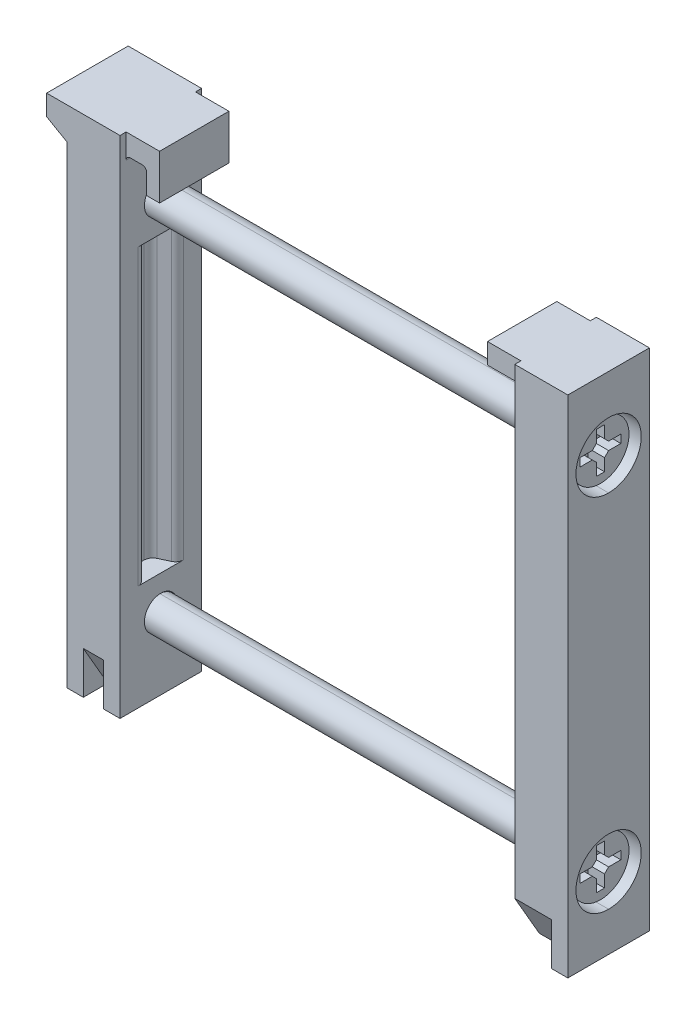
ISO-10303-21;
HEADER;
FILE_DESCRIPTION(('STEP AP214'),'2;1');
FILE_NAME('part.step','',(''),(''),'','','');
FILE_SCHEMA(('AUTOMOTIVE_DESIGN { 1 0 10303 214 1 1 1 1 }'));
ENDSEC;
DATA;
#1=APPLICATION_CONTEXT('core data for automotive mechanical design processes');
#2=APPLICATION_PROTOCOL_DEFINITION('international standard','automotive_design',2000,#1);
#3=PRODUCT_CONTEXT('',#1,'mechanical');
#4=PRODUCT('Part','Part','',(#3));
#5=PRODUCT_RELATED_PRODUCT_CATEGORY('part','',(#4));
#6=PRODUCT_DEFINITION_FORMATION('','',#4);
#7=PRODUCT_DEFINITION_CONTEXT('part definition',#1,'design');
#8=PRODUCT_DEFINITION('design','',#6,#7);
#9=PRODUCT_DEFINITION_SHAPE('','',#8);
#10=(LENGTH_UNIT() NAMED_UNIT(*) SI_UNIT(.MILLI.,.METRE.));
#11=(NAMED_UNIT(*) PLANE_ANGLE_UNIT() SI_UNIT($,.RADIAN.));
#12=(NAMED_UNIT(*) SI_UNIT($,.STERADIAN.) SOLID_ANGLE_UNIT());
#13=UNCERTAINTY_MEASURE_WITH_UNIT(LENGTH_MEASURE(1.E-05),#10,'distance_accuracy_value','');
#14=(GEOMETRIC_REPRESENTATION_CONTEXT(3) GLOBAL_UNCERTAINTY_ASSIGNED_CONTEXT((#13)) GLOBAL_UNIT_ASSIGNED_CONTEXT((#10,
#11,#12)) REPRESENTATION_CONTEXT('',''));
#15=CARTESIAN_POINT('',(0.,0.,0.));
#16=DIRECTION('',(0.,0.,1.));
#17=DIRECTION('',(1.,0.,0.));
#18=AXIS2_PLACEMENT_3D('',#15,#16,#17);
#19=CARTESIAN_POINT('',(7.5,-22.7,-1.));
#20=DIRECTION('',(0.,-1.,0.));
#21=DIRECTION('',(0.,0.,-1.));
#22=AXIS2_PLACEMENT_3D('',#19,#20,#21);
#23=PLANE('',#22);
#24=DIRECTION('',(-1.,0.,0.));
#25=VECTOR('',#24,1.);
#26=CARTESIAN_POINT('',(7.5,-22.7,-2.5));
#27=LINE('',#26,#25);
#28=CARTESIAN_POINT('',(5.5,-22.7,-2.5));
#29=VERTEX_POINT('',#28);
#30=CARTESIAN_POINT('',(3.5,-22.7,-2.5));
#31=VERTEX_POINT('',#30);
#32=EDGE_CURVE('P0_E799',#29,#31,#27,.T.);
#33=ORIENTED_EDGE('',*,*,#32,.T.);
#34=DIRECTION('',(0.,0.,-1.));
#35=VECTOR('',#34,1.);
#36=CARTESIAN_POINT('',(3.5,-22.7,-1.));
#37=LINE('',#36,#35);
#38=CARTESIAN_POINT('',(3.5,-22.7,-0.999999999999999));
#39=VERTEX_POINT('',#38);
#40=EDGE_CURVE('P0_E812',#39,#31,#37,.T.);
#41=ORIENTED_EDGE('',*,*,#40,.F.);
#42=DIRECTION('',(1.,0.,0.));
#43=VECTOR('',#42,1.);
#44=CARTESIAN_POINT('',(7.5,-22.7,-0.999999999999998));
#45=LINE('',#44,#43);
#46=CARTESIAN_POINT('',(5.5,-22.7,-0.999999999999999));
#47=VERTEX_POINT('',#46);
#48=EDGE_CURVE('P0_E785',#39,#47,#45,.T.);
#49=ORIENTED_EDGE('',*,*,#48,.T.);
#50=DIRECTION('',(0.,0.,-1.));
#51=VECTOR('',#50,1.);
#52=CARTESIAN_POINT('',(5.5,-22.7,-1.));
#53=LINE('',#52,#51);
#54=EDGE_CURVE('P0_E809',#29,#47,#53,.F.);
#55=ORIENTED_EDGE('',*,*,#54,.F.);
#56=EDGE_LOOP('',(#33,#41,#49,#55));
#57=FACE_BOUND('',#56,.T.);
#58=ADVANCED_FACE('P0_F16',(#57),#23,.F.);
#59=CARTESIAN_POINT('',(7.5,21.5,-1.));
#60=DIRECTION('',(0.,-1.,0.));
#61=DIRECTION('',(0.,0.,-1.));
#62=AXIS2_PLACEMENT_3D('',#59,#60,#61);
#63=PLANE('',#62);
#64=DIRECTION('',(-1.,0.,0.));
#65=VECTOR('',#64,1.);
#66=CARTESIAN_POINT('',(7.5,21.5,-2.5));
#67=LINE('',#66,#65);
#68=CARTESIAN_POINT('',(5.5,21.5,-2.5));
#69=VERTEX_POINT('',#68);
#70=CARTESIAN_POINT('',(3.5,21.5,-2.5));
#71=VERTEX_POINT('',#70);
#72=EDGE_CURVE('P0_E778',#69,#71,#67,.T.);
#73=ORIENTED_EDGE('',*,*,#72,.T.);
#74=DIRECTION('',(0.,0.,-1.));
#75=VECTOR('',#74,1.);
#76=CARTESIAN_POINT('',(3.5,21.5,-1.));
#77=LINE('',#76,#75);
#78=CARTESIAN_POINT('',(3.5,21.5,-1.));
#79=VERTEX_POINT('',#78);
#80=EDGE_CURVE('P0_E806',#79,#71,#77,.T.);
#81=ORIENTED_EDGE('',*,*,#80,.F.);
#82=DIRECTION('',(1.,0.,0.));
#83=VECTOR('',#82,1.);
#84=CARTESIAN_POINT('',(7.5,21.5,-1.));
#85=LINE('',#84,#83);
#86=CARTESIAN_POINT('',(5.5,21.5,-1.));
#87=VERTEX_POINT('',#86);
#88=EDGE_CURVE('P0_E764',#79,#87,#85,.T.);
#89=ORIENTED_EDGE('',*,*,#88,.T.);
#90=DIRECTION('',(0.,0.,-1.));
#91=VECTOR('',#90,1.);
#92=CARTESIAN_POINT('',(5.5,21.5,-1.));
#93=LINE('',#92,#91);
#94=EDGE_CURVE('P0_E803',#69,#87,#93,.F.);
#95=ORIENTED_EDGE('',*,*,#94,.F.);
#96=EDGE_LOOP('',(#73,#81,#89,#95));
#97=FACE_BOUND('',#96,.T.);
#98=ADVANCED_FACE('P0_F1415',(#97),#63,.F.);
#99=CARTESIAN_POINT('',(7.5,-22.7,-2.5));
#100=DIRECTION('',(0.,0.,-1.));
#101=DIRECTION('',(-1.,0.,0.));
#102=AXIS2_PLACEMENT_3D('',#99,#100,#101);
#103=PLANE('',#102);
#104=DIRECTION('',(1.,0.,0.));
#105=VECTOR('',#104,1.);
#106=CARTESIAN_POINT('',(7.5,-21.7,-2.5));
#107=LINE('',#106,#105);
#108=CARTESIAN_POINT('',(5.5,-21.7,-2.5));
#109=VERTEX_POINT('',#108);
#110=CARTESIAN_POINT('',(3.5,-21.7,-2.5));
#111=VERTEX_POINT('',#110);
#112=EDGE_CURVE('P0_E757',#109,#111,#107,.F.);
#113=ORIENTED_EDGE('',*,*,#112,.T.);
#114=DIRECTION('',(0.,1.,0.));
#115=VECTOR('',#114,1.);
#116=CARTESIAN_POINT('',(3.5,-22.7,-2.5));
#117=LINE('',#116,#115);
#118=EDGE_CURVE('P0_E796',#31,#111,#117,.T.);
#119=ORIENTED_EDGE('',*,*,#118,.F.);
#120=ORIENTED_EDGE('',*,*,#32,.F.);
#121=DIRECTION('',(0.,1.,0.));
#122=VECTOR('',#121,1.);
#123=CARTESIAN_POINT('',(5.5,-22.7,-2.5));
#124=LINE('',#123,#122);
#125=EDGE_CURVE('P0_E792',#109,#29,#124,.F.);
#126=ORIENTED_EDGE('',*,*,#125,.F.);
#127=EDGE_LOOP('',(#113,#119,#120,#126));
#128=FACE_BOUND('',#127,.T.);
#129=ADVANCED_FACE('P0_F1545',(#128),#103,.F.);
#130=CARTESIAN_POINT('',(7.5,-23.2,-0.5));
#131=DIRECTION('',(0.,-0.707106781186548,-0.707106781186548));
#132=DIRECTION('',(0.,0.707106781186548,-0.707106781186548));
#133=AXIS2_PLACEMENT_3D('',#130,#131,#132);
#134=PLANE('',#133);
#135=ORIENTED_EDGE('',*,*,#48,.F.);
#136=DIRECTION('',(0.,0.707106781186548,-0.707106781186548));
#137=VECTOR('',#136,1.);
#138=CARTESIAN_POINT('',(3.5,-23.2,-0.5));
#139=LINE('',#138,#137);
#140=CARTESIAN_POINT('',(3.5,-23.2,-0.5));
#141=VERTEX_POINT('',#140);
#142=EDGE_CURVE('P0_E789',#141,#39,#139,.T.);
#143=ORIENTED_EDGE('',*,*,#142,.F.);
#144=DIRECTION('',(1.,0.,0.));
#145=VECTOR('',#144,1.);
#146=CARTESIAN_POINT('',(7.5,-23.2,-0.5));
#147=LINE('',#146,#145);
#148=CARTESIAN_POINT('',(5.5,-23.2,-0.5));
#149=VERTEX_POINT('',#148);
#150=EDGE_CURVE('P0_E743',#141,#149,#147,.T.);
#151=ORIENTED_EDGE('',*,*,#150,.T.);
#152=DIRECTION('',(0.,0.707106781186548,-0.707106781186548));
#153=VECTOR('',#152,1.);
#154=CARTESIAN_POINT('',(5.5,-23.2,-0.5));
#155=LINE('',#154,#153);
#156=EDGE_CURVE('P0_E782',#47,#149,#155,.F.);
#157=ORIENTED_EDGE('',*,*,#156,.F.);
#158=EDGE_LOOP('',(#135,#143,#151,#157));
#159=FACE_BOUND('',#158,.T.);
#160=ADVANCED_FACE('P0_F1542',(#159),#134,.F.);
#161=CARTESIAN_POINT('',(7.5,21.5,-2.5));
#162=DIRECTION('',(0.,0.,-1.));
#163=DIRECTION('',(-1.,0.,0.));
#164=AXIS2_PLACEMENT_3D('',#161,#162,#163);
#165=PLANE('',#164);
#166=DIRECTION('',(1.,0.,0.));
#167=VECTOR('',#166,1.);
#168=CARTESIAN_POINT('',(7.5,22.5,-2.5));
#169=LINE('',#168,#167);
#170=CARTESIAN_POINT('',(5.5,22.5,-2.5));
#171=VERTEX_POINT('',#170);
#172=CARTESIAN_POINT('',(3.5,22.5,-2.5));
#173=VERTEX_POINT('',#172);
#174=EDGE_CURVE('P0_E736',#171,#173,#169,.F.);
#175=ORIENTED_EDGE('',*,*,#174,.T.);
#176=DIRECTION('',(0.,1.,0.));
#177=VECTOR('',#176,1.);
#178=CARTESIAN_POINT('',(3.5,21.5,-2.5));
#179=LINE('',#178,#177);
#180=EDGE_CURVE('P0_E775',#71,#173,#179,.T.);
#181=ORIENTED_EDGE('',*,*,#180,.F.);
#182=ORIENTED_EDGE('',*,*,#72,.F.);
#183=DIRECTION('',(0.,1.,0.));
#184=VECTOR('',#183,1.);
#185=CARTESIAN_POINT('',(5.5,21.5,-2.5));
#186=LINE('',#185,#184);
#187=EDGE_CURVE('P0_E771',#171,#69,#186,.F.);
#188=ORIENTED_EDGE('',*,*,#187,.F.);
#189=EDGE_LOOP('',(#175,#181,#182,#188));
#190=FACE_BOUND('',#189,.T.);
#191=ADVANCED_FACE('P0_F1412',(#190),#165,.F.);
#192=CARTESIAN_POINT('',(7.5,21.,-0.5));
#193=DIRECTION('',(0.,-0.707106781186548,-0.707106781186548));
#194=DIRECTION('',(0.,0.707106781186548,-0.707106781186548));
#195=AXIS2_PLACEMENT_3D('',#192,#193,#194);
#196=PLANE('',#195);
#197=ORIENTED_EDGE('',*,*,#88,.F.);
#198=DIRECTION('',(0.,0.707106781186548,-0.707106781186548));
#199=VECTOR('',#198,1.);
#200=CARTESIAN_POINT('',(3.5,21.,-0.5));
#201=LINE('',#200,#199);
#202=CARTESIAN_POINT('',(3.5,21.,-0.5));
#203=VERTEX_POINT('',#202);
#204=EDGE_CURVE('P0_E768',#203,#79,#201,.T.);
#205=ORIENTED_EDGE('',*,*,#204,.F.);
#206=DIRECTION('',(1.,0.,0.));
#207=VECTOR('',#206,1.);
#208=CARTESIAN_POINT('',(7.5,21.,-0.5));
#209=LINE('',#208,#207);
#210=CARTESIAN_POINT('',(5.5,21.,-0.5));
#211=VERTEX_POINT('',#210);
#212=EDGE_CURVE('P0_E722',#203,#211,#209,.T.);
#213=ORIENTED_EDGE('',*,*,#212,.T.);
#214=DIRECTION('',(0.,0.707106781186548,-0.707106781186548));
#215=VECTOR('',#214,1.);
#216=CARTESIAN_POINT('',(5.5,21.,-0.5));
#217=LINE('',#216,#215);
#218=EDGE_CURVE('P0_E761',#87,#211,#217,.F.);
#219=ORIENTED_EDGE('',*,*,#218,.F.);
#220=EDGE_LOOP('',(#197,#205,#213,#219));
#221=FACE_BOUND('',#220,.T.);
#222=ADVANCED_FACE('P0_F1422',(#221),#196,.F.);
#223=CARTESIAN_POINT('',(7.5,-21.7,-2.5));
#224=DIRECTION('',(0.,1.,0.));
#225=DIRECTION('',(0.,0.,1.));
#226=AXIS2_PLACEMENT_3D('',#223,#224,#225);
#227=PLANE('',#226);
#228=DIRECTION('',(1.,0.,0.));
#229=VECTOR('',#228,1.);
#230=CARTESIAN_POINT('',(7.5,-21.7,-1.));
#231=LINE('',#230,#229);
#232=CARTESIAN_POINT('',(5.5,-21.7,-1.));
#233=VERTEX_POINT('',#232);
#234=CARTESIAN_POINT('',(3.5,-21.7,-1.));
#235=VERTEX_POINT('',#234);
#236=EDGE_CURVE('P0_E715',#233,#235,#231,.F.);
#237=ORIENTED_EDGE('',*,*,#236,.T.);
#238=DIRECTION('',(0.,0.,1.));
#239=VECTOR('',#238,1.);
#240=CARTESIAN_POINT('',(3.5,-21.7,-2.5));
#241=LINE('',#240,#239);
#242=EDGE_CURVE('P0_E754',#111,#235,#241,.T.);
#243=ORIENTED_EDGE('',*,*,#242,.F.);
#244=ORIENTED_EDGE('',*,*,#112,.F.);
#245=DIRECTION('',(0.,0.,1.));
#246=VECTOR('',#245,1.);
#247=CARTESIAN_POINT('',(5.5,-21.7,-2.5));
#248=LINE('',#247,#246);
#249=EDGE_CURVE('P0_E750',#233,#109,#248,.F.);
#250=ORIENTED_EDGE('',*,*,#249,.F.);
#251=EDGE_LOOP('',(#237,#243,#244,#250));
#252=FACE_BOUND('',#251,.T.);
#253=ADVANCED_FACE('P0_F1533',(#252),#227,.F.);
#254=CARTESIAN_POINT('',(7.5,-24.7,-0.5));
#255=DIRECTION('',(0.,0.,-1.));
#256=DIRECTION('',(0.,1.,0.));
#257=AXIS2_PLACEMENT_3D('',#254,#255,#256);
#258=PLANE('',#257);
#259=ORIENTED_EDGE('',*,*,#150,.F.);
#260=DIRECTION('',(0.,1.,0.));
#261=VECTOR('',#260,1.);
#262=CARTESIAN_POINT('',(3.5,-24.7,-0.5));
#263=LINE('',#262,#261);
#264=CARTESIAN_POINT('',(3.5,-24.7,-0.5));
#265=VERTEX_POINT('',#264);
#266=EDGE_CURVE('P0_E747',#265,#141,#263,.T.);
#267=ORIENTED_EDGE('',*,*,#266,.F.);
#268=DIRECTION('',(1.,0.,0.));
#269=VECTOR('',#268,1.);
#270=CARTESIAN_POINT('',(7.5,-24.7,-0.5));
#271=LINE('',#270,#269);
#272=CARTESIAN_POINT('',(5.5,-24.7,-0.5));
#273=VERTEX_POINT('',#272);
#274=EDGE_CURVE('P0_E701',#265,#273,#271,.T.);
#275=ORIENTED_EDGE('',*,*,#274,.T.);
#276=DIRECTION('',(0.,1.,0.));
#277=VECTOR('',#276,1.);
#278=CARTESIAN_POINT('',(5.5,-24.7,-0.5));
#279=LINE('',#278,#277);
#280=EDGE_CURVE('P0_E740',#149,#273,#279,.F.);
#281=ORIENTED_EDGE('',*,*,#280,.F.);
#282=EDGE_LOOP('',(#259,#267,#275,#281));
#283=FACE_BOUND('',#282,.T.);
#284=ADVANCED_FACE('P0_F1530',(#283),#258,.F.);
#285=CARTESIAN_POINT('',(7.5,22.5,-2.5));
#286=DIRECTION('',(0.,1.,0.));
#287=DIRECTION('',(0.,0.,1.));
#288=AXIS2_PLACEMENT_3D('',#285,#286,#287);
#289=PLANE('',#288);
#290=DIRECTION('',(1.,0.,0.));
#291=VECTOR('',#290,1.);
#292=CARTESIAN_POINT('',(7.5,22.5,-1.));
#293=LINE('',#292,#291);
#294=CARTESIAN_POINT('',(5.5,22.5,-1.));
#295=VERTEX_POINT('',#294);
#296=CARTESIAN_POINT('',(3.5,22.5,-1.));
#297=VERTEX_POINT('',#296);
#298=EDGE_CURVE('P0_E694',#295,#297,#293,.F.);
#299=ORIENTED_EDGE('',*,*,#298,.T.);
#300=DIRECTION('',(0.,0.,1.));
#301=VECTOR('',#300,1.);
#302=CARTESIAN_POINT('',(3.5,22.5,-2.5));
#303=LINE('',#302,#301);
#304=EDGE_CURVE('P0_E733',#173,#297,#303,.T.);
#305=ORIENTED_EDGE('',*,*,#304,.F.);
#306=ORIENTED_EDGE('',*,*,#174,.F.);
#307=DIRECTION('',(0.,0.,1.));
#308=VECTOR('',#307,1.);
#309=CARTESIAN_POINT('',(5.5,22.5,-2.5));
#310=LINE('',#309,#308);
#311=EDGE_CURVE('P0_E729',#295,#171,#310,.F.);
#312=ORIENTED_EDGE('',*,*,#311,.F.);
#313=EDGE_LOOP('',(#299,#305,#306,#312));
#314=FACE_BOUND('',#313,.T.);
#315=ADVANCED_FACE('P0_F1409',(#314),#289,.F.);
#316=CARTESIAN_POINT('',(7.5,19.5,-0.5));
#317=DIRECTION('',(0.,0.,-1.));
#318=DIRECTION('',(0.,1.,0.));
#319=AXIS2_PLACEMENT_3D('',#316,#317,#318);
#320=PLANE('',#319);
#321=ORIENTED_EDGE('',*,*,#212,.F.);
#322=DIRECTION('',(0.,1.,0.));
#323=VECTOR('',#322,1.);
#324=CARTESIAN_POINT('',(3.5,19.5,-0.5));
#325=LINE('',#324,#323);
#326=CARTESIAN_POINT('',(3.5,19.5,-0.5));
#327=VERTEX_POINT('',#326);
#328=EDGE_CURVE('P0_E726',#327,#203,#325,.T.);
#329=ORIENTED_EDGE('',*,*,#328,.F.);
#330=DIRECTION('',(1.,0.,0.));
#331=VECTOR('',#330,1.);
#332=CARTESIAN_POINT('',(7.5,19.5,-0.5));
#333=LINE('',#332,#331);
#334=CARTESIAN_POINT('',(5.5,19.5,-0.5));
#335=VERTEX_POINT('',#334);
#336=EDGE_CURVE('P0_E680',#327,#335,#333,.T.);
#337=ORIENTED_EDGE('',*,*,#336,.T.);
#338=DIRECTION('',(0.,1.,0.));
#339=VECTOR('',#338,1.);
#340=CARTESIAN_POINT('',(5.5,19.5,-0.5));
#341=LINE('',#340,#339);
#342=EDGE_CURVE('P0_E719',#211,#335,#341,.F.);
#343=ORIENTED_EDGE('',*,*,#342,.F.);
#344=EDGE_LOOP('',(#321,#329,#337,#343));
#345=FACE_BOUND('',#344,.T.);
#346=ADVANCED_FACE('P0_F1425',(#345),#320,.F.);
#347=CARTESIAN_POINT('',(7.5,-21.7,-1.));
#348=DIRECTION('',(0.,0.707106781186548,-0.707106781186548));
#349=DIRECTION('',(0.,0.707106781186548,0.707106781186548));
#350=AXIS2_PLACEMENT_3D('',#347,#348,#349);
#351=PLANE('',#350);
#352=DIRECTION('',(1.,0.,0.));
#353=VECTOR('',#352,1.);
#354=CARTESIAN_POINT('',(7.5,-21.2,-0.5));
#355=LINE('',#354,#353);
#356=CARTESIAN_POINT('',(5.5,-21.2,-0.5));
#357=VERTEX_POINT('',#356);
#358=CARTESIAN_POINT('',(3.5,-21.2,-0.5));
#359=VERTEX_POINT('',#358);
#360=EDGE_CURVE('P0_E673',#357,#359,#355,.F.);
#361=ORIENTED_EDGE('',*,*,#360,.T.);
#362=DIRECTION('',(0.,0.707106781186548,0.707106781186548));
#363=VECTOR('',#362,1.);
#364=CARTESIAN_POINT('',(3.5,-21.7,-1.));
#365=LINE('',#364,#363);
#366=EDGE_CURVE('P0_E712',#235,#359,#365,.T.);
#367=ORIENTED_EDGE('',*,*,#366,.F.);
#368=ORIENTED_EDGE('',*,*,#236,.F.);
#369=DIRECTION('',(0.,0.707106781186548,0.707106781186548));
#370=VECTOR('',#369,1.);
#371=CARTESIAN_POINT('',(5.5,-21.7,-1.));
#372=LINE('',#371,#370);
#373=EDGE_CURVE('P0_E708',#357,#233,#372,.F.);
#374=ORIENTED_EDGE('',*,*,#373,.F.);
#375=EDGE_LOOP('',(#361,#367,#368,#374));
#376=FACE_BOUND('',#375,.T.);
#377=ADVANCED_FACE('P0_F1521',(#376),#351,.F.);
#378=CARTESIAN_POINT('',(7.5,-24.7,0.5));
#379=DIRECTION('',(0.,-1.,0.));
#380=DIRECTION('',(0.,0.,-1.));
#381=AXIS2_PLACEMENT_3D('',#378,#379,#380);
#382=PLANE('',#381);
#383=ORIENTED_EDGE('',*,*,#274,.F.);
#384=DIRECTION('',(0.,0.,-1.));
#385=VECTOR('',#384,1.);
#386=CARTESIAN_POINT('',(3.5,-24.7,0.5));
#387=LINE('',#386,#385);
#388=CARTESIAN_POINT('',(3.5,-24.7,0.5));
#389=VERTEX_POINT('',#388);
#390=EDGE_CURVE('P0_E705',#389,#265,#387,.T.);
#391=ORIENTED_EDGE('',*,*,#390,.F.);
#392=DIRECTION('',(1.,0.,0.));
#393=VECTOR('',#392,1.);
#394=CARTESIAN_POINT('',(7.5,-24.7,0.5));
#395=LINE('',#394,#393);
#396=CARTESIAN_POINT('',(5.5,-24.7,0.5));
#397=VERTEX_POINT('',#396);
#398=EDGE_CURVE('P0_E659',#389,#397,#395,.T.);
#399=ORIENTED_EDGE('',*,*,#398,.T.);
#400=DIRECTION('',(0.,0.,-1.));
#401=VECTOR('',#400,1.);
#402=CARTESIAN_POINT('',(5.5,-24.7,0.5));
#403=LINE('',#402,#401);
#404=EDGE_CURVE('P0_E698',#273,#397,#403,.F.);
#405=ORIENTED_EDGE('',*,*,#404,.F.);
#406=EDGE_LOOP('',(#383,#391,#399,#405));
#407=FACE_BOUND('',#406,.T.);
#408=ADVANCED_FACE('P0_F1518',(#407),#382,.F.);
#409=CARTESIAN_POINT('',(7.5,22.5,-1.));
#410=DIRECTION('',(0.,0.707106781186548,-0.707106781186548));
#411=DIRECTION('',(0.,0.707106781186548,0.707106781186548));
#412=AXIS2_PLACEMENT_3D('',#409,#410,#411);
#413=PLANE('',#412);
#414=DIRECTION('',(1.,0.,0.));
#415=VECTOR('',#414,1.);
#416=CARTESIAN_POINT('',(7.5,23.,-0.5));
#417=LINE('',#416,#415);
#418=CARTESIAN_POINT('',(5.5,23.,-0.5));
#419=VERTEX_POINT('',#418);
#420=CARTESIAN_POINT('',(3.5,23.,-0.5));
#421=VERTEX_POINT('',#420);
#422=EDGE_CURVE('P0_E652',#419,#421,#417,.F.);
#423=ORIENTED_EDGE('',*,*,#422,.T.);
#424=DIRECTION('',(0.,0.707106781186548,0.707106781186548));
#425=VECTOR('',#424,1.);
#426=CARTESIAN_POINT('',(3.5,22.5,-1.));
#427=LINE('',#426,#425);
#428=EDGE_CURVE('P0_E691',#297,#421,#427,.T.);
#429=ORIENTED_EDGE('',*,*,#428,.F.);
#430=ORIENTED_EDGE('',*,*,#298,.F.);
#431=DIRECTION('',(0.,0.707106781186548,0.707106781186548));
#432=VECTOR('',#431,1.);
#433=CARTESIAN_POINT('',(5.5,22.5,-1.));
#434=LINE('',#433,#432);
#435=EDGE_CURVE('P0_E687',#419,#295,#434,.F.);
#436=ORIENTED_EDGE('',*,*,#435,.F.);
#437=EDGE_LOOP('',(#423,#429,#430,#436));
#438=FACE_BOUND('',#437,.T.);
#439=ADVANCED_FACE('P0_F1403',(#438),#413,.F.);
#440=CARTESIAN_POINT('',(7.5,19.5,0.5));
#441=DIRECTION('',(0.,-1.,0.));
#442=DIRECTION('',(0.,0.,-1.));
#443=AXIS2_PLACEMENT_3D('',#440,#441,#442);
#444=PLANE('',#443);
#445=ORIENTED_EDGE('',*,*,#336,.F.);
#446=DIRECTION('',(0.,0.,-1.));
#447=VECTOR('',#446,1.);
#448=CARTESIAN_POINT('',(3.5,19.5,0.5));
#449=LINE('',#448,#447);
#450=CARTESIAN_POINT('',(3.5,19.5,0.5));
#451=VERTEX_POINT('',#450);
#452=EDGE_CURVE('P0_E684',#451,#327,#449,.T.);
#453=ORIENTED_EDGE('',*,*,#452,.F.);
#454=DIRECTION('',(1.,0.,0.));
#455=VECTOR('',#454,1.);
#456=CARTESIAN_POINT('',(7.5,19.5,0.5));
#457=LINE('',#456,#455);
#458=CARTESIAN_POINT('',(5.5,19.5,0.5));
#459=VERTEX_POINT('',#458);
#460=EDGE_CURVE('P0_E638',#451,#459,#457,.T.);
#461=ORIENTED_EDGE('',*,*,#460,.T.);
#462=DIRECTION('',(0.,0.,-1.));
#463=VECTOR('',#462,1.);
#464=CARTESIAN_POINT('',(5.5,19.5,0.5));
#465=LINE('',#464,#463);
#466=EDGE_CURVE('P0_E677',#335,#459,#465,.F.);
#467=ORIENTED_EDGE('',*,*,#466,.F.);
#468=EDGE_LOOP('',(#445,#453,#461,#467));
#469=FACE_BOUND('',#468,.T.);
#470=ADVANCED_FACE('P0_F1430',(#469),#444,.F.);
#471=CARTESIAN_POINT('',(7.5,-21.2,-0.5));
#472=DIRECTION('',(0.,0.,-1.));
#473=DIRECTION('',(0.,1.,0.));
#474=AXIS2_PLACEMENT_3D('',#471,#472,#473);
#475=PLANE('',#474);
#476=DIRECTION('',(1.,0.,0.));
#477=VECTOR('',#476,1.);
#478=CARTESIAN_POINT('',(7.5,-19.7,-0.5));
#479=LINE('',#478,#477);
#480=CARTESIAN_POINT('',(5.5,-19.7,-0.5));
#481=VERTEX_POINT('',#480);
#482=CARTESIAN_POINT('',(3.5,-19.7,-0.5));
#483=VERTEX_POINT('',#482);
#484=EDGE_CURVE('P0_E631',#481,#483,#479,.F.);
#485=ORIENTED_EDGE('',*,*,#484,.T.);
#486=DIRECTION('',(0.,1.,0.));
#487=VECTOR('',#486,1.);
#488=CARTESIAN_POINT('',(3.5,-21.2,-0.5));
#489=LINE('',#488,#487);
#490=EDGE_CURVE('P0_E670',#359,#483,#489,.T.);
#491=ORIENTED_EDGE('',*,*,#490,.F.);
#492=ORIENTED_EDGE('',*,*,#360,.F.);
#493=DIRECTION('',(0.,1.,0.));
#494=VECTOR('',#493,1.);
#495=CARTESIAN_POINT('',(5.5,-21.2,-0.5));
#496=LINE('',#495,#494);
#497=EDGE_CURVE('P0_E666',#481,#357,#496,.F.);
#498=ORIENTED_EDGE('',*,*,#497,.F.);
#499=EDGE_LOOP('',(#485,#491,#492,#498));
#500=FACE_BOUND('',#499,.T.);
#501=ADVANCED_FACE('P0_F1509',(#500),#475,.F.);
#502=CARTESIAN_POINT('',(7.5,-23.2,0.5));
#503=DIRECTION('',(0.,0.,1.));
#504=DIRECTION('',(0.,-1.,0.));
#505=AXIS2_PLACEMENT_3D('',#502,#503,#504);
#506=PLANE('',#505);
#507=ORIENTED_EDGE('',*,*,#398,.F.);
#508=DIRECTION('',(0.,-1.,0.));
#509=VECTOR('',#508,1.);
#510=CARTESIAN_POINT('',(3.5,-23.2,0.5));
#511=LINE('',#510,#509);
#512=CARTESIAN_POINT('',(3.5,-23.2,0.500000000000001));
#513=VERTEX_POINT('',#512);
#514=EDGE_CURVE('P0_E663',#513,#389,#511,.T.);
#515=ORIENTED_EDGE('',*,*,#514,.F.);
#516=DIRECTION('',(1.,0.,0.));
#517=VECTOR('',#516,1.);
#518=CARTESIAN_POINT('',(7.5,-23.2,0.500000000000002));
#519=LINE('',#518,#517);
#520=CARTESIAN_POINT('',(5.5,-23.2,0.500000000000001));
#521=VERTEX_POINT('',#520);
#522=EDGE_CURVE('P0_E617',#513,#521,#519,.T.);
#523=ORIENTED_EDGE('',*,*,#522,.T.);
#524=DIRECTION('',(0.,-1.,0.));
#525=VECTOR('',#524,1.);
#526=CARTESIAN_POINT('',(5.5,-23.2,0.5));
#527=LINE('',#526,#525);
#528=EDGE_CURVE('P0_E656',#397,#521,#527,.F.);
#529=ORIENTED_EDGE('',*,*,#528,.F.);
#530=EDGE_LOOP('',(#507,#515,#523,#529));
#531=FACE_BOUND('',#530,.T.);
#532=ADVANCED_FACE('P0_F1506',(#531),#506,.F.);
#533=CARTESIAN_POINT('',(7.5,23.,-0.5));
#534=DIRECTION('',(0.,0.,-1.));
#535=DIRECTION('',(0.,1.,0.));
#536=AXIS2_PLACEMENT_3D('',#533,#534,#535);
#537=PLANE('',#536);
#538=DIRECTION('',(1.,0.,0.));
#539=VECTOR('',#538,1.);
#540=CARTESIAN_POINT('',(7.5,24.5,-0.5));
#541=LINE('',#540,#539);
#542=CARTESIAN_POINT('',(5.5,24.5,-0.5));
#543=VERTEX_POINT('',#542);
#544=CARTESIAN_POINT('',(3.5,24.5,-0.5));
#545=VERTEX_POINT('',#544);
#546=EDGE_CURVE('P0_E610',#543,#545,#541,.F.);
#547=ORIENTED_EDGE('',*,*,#546,.T.);
#548=DIRECTION('',(0.,1.,0.));
#549=VECTOR('',#548,1.);
#550=CARTESIAN_POINT('',(3.5,23.,-0.5));
#551=LINE('',#550,#549);
#552=EDGE_CURVE('P0_E649',#421,#545,#551,.T.);
#553=ORIENTED_EDGE('',*,*,#552,.F.);
#554=ORIENTED_EDGE('',*,*,#422,.F.);
#555=DIRECTION('',(0.,1.,0.));
#556=VECTOR('',#555,1.);
#557=CARTESIAN_POINT('',(5.5,23.,-0.5));
#558=LINE('',#557,#556);
#559=EDGE_CURVE('P0_E645',#543,#419,#558,.F.);
#560=ORIENTED_EDGE('',*,*,#559,.F.);
#561=EDGE_LOOP('',(#547,#553,#554,#560));
#562=FACE_BOUND('',#561,.T.);
#563=ADVANCED_FACE('P0_F1400',(#562),#537,.F.);
#564=CARTESIAN_POINT('',(7.5,21.,0.5));
#565=DIRECTION('',(0.,0.,1.));
#566=DIRECTION('',(0.,-1.,0.));
#567=AXIS2_PLACEMENT_3D('',#564,#565,#566);
#568=PLANE('',#567);
#569=ORIENTED_EDGE('',*,*,#460,.F.);
#570=DIRECTION('',(0.,-1.,0.));
#571=VECTOR('',#570,1.);
#572=CARTESIAN_POINT('',(3.5,21.,0.5));
#573=LINE('',#572,#571);
#574=CARTESIAN_POINT('',(3.5,21.,0.5));
#575=VERTEX_POINT('',#574);
#576=EDGE_CURVE('P0_E642',#575,#451,#573,.T.);
#577=ORIENTED_EDGE('',*,*,#576,.F.);
#578=DIRECTION('',(1.,0.,0.));
#579=VECTOR('',#578,1.);
#580=CARTESIAN_POINT('',(7.5,21.,0.5));
#581=LINE('',#580,#579);
#582=CARTESIAN_POINT('',(5.5,21.,0.5));
#583=VERTEX_POINT('',#582);
#584=EDGE_CURVE('P0_E596',#575,#583,#581,.T.);
#585=ORIENTED_EDGE('',*,*,#584,.T.);
#586=DIRECTION('',(0.,-1.,0.));
#587=VECTOR('',#586,1.);
#588=CARTESIAN_POINT('',(5.5,21.,0.5));
#589=LINE('',#588,#587);
#590=EDGE_CURVE('P0_E635',#459,#583,#589,.F.);
#591=ORIENTED_EDGE('',*,*,#590,.F.);
#592=EDGE_LOOP('',(#569,#577,#585,#591));
#593=FACE_BOUND('',#592,.T.);
#594=ADVANCED_FACE('P0_F1437',(#593),#568,.F.);
#595=CARTESIAN_POINT('',(7.5,-19.7,-0.5));
#596=DIRECTION('',(0.,1.,0.));
#597=DIRECTION('',(0.,0.,1.));
#598=AXIS2_PLACEMENT_3D('',#595,#596,#597);
#599=PLANE('',#598);
#600=DIRECTION('',(1.,0.,0.));
#601=VECTOR('',#600,1.);
#602=CARTESIAN_POINT('',(7.5,-19.7,0.5));
#603=LINE('',#602,#601);
#604=CARTESIAN_POINT('',(5.5,-19.7,0.5));
#605=VERTEX_POINT('',#604);
#606=CARTESIAN_POINT('',(3.5,-19.7,0.5));
#607=VERTEX_POINT('',#606);
#608=EDGE_CURVE('P0_E589',#605,#607,#603,.F.);
#609=ORIENTED_EDGE('',*,*,#608,.T.);
#610=DIRECTION('',(0.,0.,1.));
#611=VECTOR('',#610,1.);
#612=CARTESIAN_POINT('',(3.5,-19.7,-0.5));
#613=LINE('',#612,#611);
#614=EDGE_CURVE('P0_E628',#483,#607,#613,.T.);
#615=ORIENTED_EDGE('',*,*,#614,.F.);
#616=ORIENTED_EDGE('',*,*,#484,.F.);
#617=DIRECTION('',(0.,0.,1.));
#618=VECTOR('',#617,1.);
#619=CARTESIAN_POINT('',(5.5,-19.7,-0.5));
#620=LINE('',#619,#618);
#621=EDGE_CURVE('P0_E624',#605,#481,#620,.F.);
#622=ORIENTED_EDGE('',*,*,#621,.F.);
#623=EDGE_LOOP('',(#609,#615,#616,#622));
#624=FACE_BOUND('',#623,.T.);
#625=ADVANCED_FACE('P0_F1497',(#624),#599,.F.);
#626=CARTESIAN_POINT('',(7.5,-22.7,1.));
#627=DIRECTION('',(0.,-0.707106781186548,0.707106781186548));
#628=DIRECTION('',(0.,-0.707106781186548,-0.707106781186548));
#629=AXIS2_PLACEMENT_3D('',#626,#627,#628);
#630=PLANE('',#629);
#631=ORIENTED_EDGE('',*,*,#522,.F.);
#632=DIRECTION('',(0.,-0.707106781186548,-0.707106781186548));
#633=VECTOR('',#632,1.);
#634=CARTESIAN_POINT('',(3.5,-22.7,1.));
#635=LINE('',#634,#633);
#636=CARTESIAN_POINT('',(3.5,-22.7,1.));
#637=VERTEX_POINT('',#636);
#638=EDGE_CURVE('P0_E621',#637,#513,#635,.T.);
#639=ORIENTED_EDGE('',*,*,#638,.F.);
#640=DIRECTION('',(1.,0.,0.));
#641=VECTOR('',#640,1.);
#642=CARTESIAN_POINT('',(7.5,-22.7,1.));
#643=LINE('',#642,#641);
#644=CARTESIAN_POINT('',(5.5,-22.7,1.));
#645=VERTEX_POINT('',#644);
#646=EDGE_CURVE('P0_E578',#637,#645,#643,.T.);
#647=ORIENTED_EDGE('',*,*,#646,.T.);
#648=DIRECTION('',(0.,-0.707106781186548,-0.707106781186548));
#649=VECTOR('',#648,1.);
#650=CARTESIAN_POINT('',(5.5,-22.7,1.));
#651=LINE('',#650,#649);
#652=EDGE_CURVE('P0_E614',#521,#645,#651,.F.);
#653=ORIENTED_EDGE('',*,*,#652,.F.);
#654=EDGE_LOOP('',(#631,#639,#647,#653));
#655=FACE_BOUND('',#654,.T.);
#656=ADVANCED_FACE('P0_F1494',(#655),#630,.F.);
#657=CARTESIAN_POINT('',(7.5,24.5,-0.5));
#658=DIRECTION('',(0.,1.,0.));
#659=DIRECTION('',(0.,0.,1.));
#660=AXIS2_PLACEMENT_3D('',#657,#658,#659);
#661=PLANE('',#660);
#662=DIRECTION('',(1.,0.,0.));
#663=VECTOR('',#662,1.);
#664=CARTESIAN_POINT('',(7.5,24.5,0.5));
#665=LINE('',#664,#663);
#666=CARTESIAN_POINT('',(5.5,24.5,0.5));
#667=VERTEX_POINT('',#666);
#668=CARTESIAN_POINT('',(3.5,24.5,0.5));
#669=VERTEX_POINT('',#668);
#670=EDGE_CURVE('P0_E571',#667,#669,#665,.F.);
#671=ORIENTED_EDGE('',*,*,#670,.T.);
#672=DIRECTION('',(0.,0.,1.));
#673=VECTOR('',#672,1.);
#674=CARTESIAN_POINT('',(3.5,24.5,-0.5));
#675=LINE('',#674,#673);
#676=EDGE_CURVE('P0_E607',#545,#669,#675,.T.);
#677=ORIENTED_EDGE('',*,*,#676,.F.);
#678=ORIENTED_EDGE('',*,*,#546,.F.);
#679=DIRECTION('',(0.,0.,1.));
#680=VECTOR('',#679,1.);
#681=CARTESIAN_POINT('',(5.5,24.5,-0.5));
#682=LINE('',#681,#680);
#683=EDGE_CURVE('P0_E603',#667,#543,#682,.F.);
#684=ORIENTED_EDGE('',*,*,#683,.F.);
#685=EDGE_LOOP('',(#671,#677,#678,#684));
#686=FACE_BOUND('',#685,.T.);
#687=ADVANCED_FACE('P0_F1397',(#686),#661,.F.);
#688=CARTESIAN_POINT('',(7.5,21.5,1.));
#689=DIRECTION('',(0.,-0.707106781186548,0.707106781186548));
#690=DIRECTION('',(0.,-0.707106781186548,-0.707106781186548));
#691=AXIS2_PLACEMENT_3D('',#688,#689,#690);
#692=PLANE('',#691);
#693=ORIENTED_EDGE('',*,*,#584,.F.);
#694=DIRECTION('',(0.,-0.707106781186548,-0.707106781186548));
#695=VECTOR('',#694,1.);
#696=CARTESIAN_POINT('',(3.5,21.5,1.));
#697=LINE('',#696,#695);
#698=CARTESIAN_POINT('',(3.5,21.5,1.));
#699=VERTEX_POINT('',#698);
#700=EDGE_CURVE('P0_E600',#699,#575,#697,.T.);
#701=ORIENTED_EDGE('',*,*,#700,.F.);
#702=DIRECTION('',(1.,0.,0.));
#703=VECTOR('',#702,1.);
#704=CARTESIAN_POINT('',(7.5,21.5,1.));
#705=LINE('',#704,#703);
#706=CARTESIAN_POINT('',(5.5,21.5,1.));
#707=VERTEX_POINT('',#706);
#708=EDGE_CURVE('P0_E560',#699,#707,#705,.T.);
#709=ORIENTED_EDGE('',*,*,#708,.T.);
#710=DIRECTION('',(0.,-0.707106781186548,-0.707106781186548));
#711=VECTOR('',#710,1.);
#712=CARTESIAN_POINT('',(5.5,21.5,1.));
#713=LINE('',#712,#711);
#714=EDGE_CURVE('P0_E593',#583,#707,#713,.F.);
#715=ORIENTED_EDGE('',*,*,#714,.F.);
#716=EDGE_LOOP('',(#693,#701,#709,#715));
#717=FACE_BOUND('',#716,.T.);
#718=ADVANCED_FACE('P0_F1439',(#717),#692,.F.);
#719=CARTESIAN_POINT('',(7.5,-19.7,0.5));
#720=DIRECTION('',(0.,0.,1.));
#721=DIRECTION('',(0.,-1.,0.));
#722=AXIS2_PLACEMENT_3D('',#719,#720,#721);
#723=PLANE('',#722);
#724=DIRECTION('',(1.,0.,0.));
#725=VECTOR('',#724,1.);
#726=CARTESIAN_POINT('',(7.5,-21.2,0.5));
#727=LINE('',#726,#725);
#728=CARTESIAN_POINT('',(5.5,-21.2,0.5));
#729=VERTEX_POINT('',#728);
#730=CARTESIAN_POINT('',(3.5,-21.2,0.5));
#731=VERTEX_POINT('',#730);
#732=EDGE_CURVE('P0_E553',#729,#731,#727,.F.);
#733=ORIENTED_EDGE('',*,*,#732,.T.);
#734=DIRECTION('',(0.,-1.,0.));
#735=VECTOR('',#734,1.);
#736=CARTESIAN_POINT('',(3.5,-19.7,0.5));
#737=LINE('',#736,#735);
#738=EDGE_CURVE('P0_E586',#607,#731,#737,.T.);
#739=ORIENTED_EDGE('',*,*,#738,.F.);
#740=ORIENTED_EDGE('',*,*,#608,.F.);
#741=DIRECTION('',(0.,-1.,0.));
#742=VECTOR('',#741,1.);
#743=CARTESIAN_POINT('',(5.5,-19.7,0.5));
#744=LINE('',#743,#742);
#745=EDGE_CURVE('P0_E582',#729,#605,#744,.F.);
#746=ORIENTED_EDGE('',*,*,#745,.F.);
#747=EDGE_LOOP('',(#733,#739,#740,#746));
#748=FACE_BOUND('',#747,.T.);
#749=ADVANCED_FACE('P0_F1485',(#748),#723,.F.);
#750=CARTESIAN_POINT('',(7.5,-22.7,2.5));
#751=DIRECTION('',(0.,-1.,0.));
#752=DIRECTION('',(0.,0.,-1.));
#753=AXIS2_PLACEMENT_3D('',#750,#751,#752);
#754=PLANE('',#753);
#755=ORIENTED_EDGE('',*,*,#646,.F.);
#756=DIRECTION('',(0.,0.,-1.));
#757=VECTOR('',#756,1.);
#758=CARTESIAN_POINT('',(3.5,-22.7,0.));
#759=LINE('',#758,#757);
#760=CARTESIAN_POINT('',(3.5,-22.7,2.5));
#761=VERTEX_POINT('',#760);
#762=EDGE_CURVE('P0_E541',#761,#637,#759,.T.);
#763=ORIENTED_EDGE('',*,*,#762,.F.);
#764=DIRECTION('',(1.,0.,0.));
#765=VECTOR('',#764,1.);
#766=CARTESIAN_POINT('',(7.5,-22.7,2.5));
#767=LINE('',#766,#765);
#768=CARTESIAN_POINT('',(5.5,-22.7,2.5));
#769=VERTEX_POINT('',#768);
#770=EDGE_CURVE('P0_E533',#761,#769,#767,.T.);
#771=ORIENTED_EDGE('',*,*,#770,.T.);
#772=DIRECTION('',(0.,0.,-1.));
#773=VECTOR('',#772,1.);
#774=CARTESIAN_POINT('',(5.5,-22.7,2.5));
#775=LINE('',#774,#773);
#776=EDGE_CURVE('P0_E575',#645,#769,#775,.F.);
#777=ORIENTED_EDGE('',*,*,#776,.F.);
#778=EDGE_LOOP('',(#755,#763,#771,#777));
#779=FACE_BOUND('',#778,.T.);
#780=ADVANCED_FACE('P0_F1482',(#779),#754,.F.);
#781=CARTESIAN_POINT('',(7.5,24.5,0.5));
#782=DIRECTION('',(0.,0.,1.));
#783=DIRECTION('',(0.,-1.,0.));
#784=AXIS2_PLACEMENT_3D('',#781,#782,#783);
#785=PLANE('',#784);
#786=DIRECTION('',(1.,0.,0.));
#787=VECTOR('',#786,1.);
#788=CARTESIAN_POINT('',(7.5,23.,0.5));
#789=LINE('',#788,#787);
#790=CARTESIAN_POINT('',(5.5,23.,0.5));
#791=VERTEX_POINT('',#790);
#792=CARTESIAN_POINT('',(3.5,23.,0.5));
#793=VERTEX_POINT('',#792);
#794=EDGE_CURVE('P0_E526',#791,#793,#789,.F.);
#795=ORIENTED_EDGE('',*,*,#794,.T.);
#796=DIRECTION('',(0.,-1.,0.));
#797=VECTOR('',#796,1.);
#798=CARTESIAN_POINT('',(3.5,24.5,0.5));
#799=LINE('',#798,#797);
#800=EDGE_CURVE('P0_E568',#669,#793,#799,.T.);
#801=ORIENTED_EDGE('',*,*,#800,.F.);
#802=ORIENTED_EDGE('',*,*,#670,.F.);
#803=DIRECTION('',(0.,-1.,0.));
#804=VECTOR('',#803,1.);
#805=CARTESIAN_POINT('',(5.5,24.5,0.5));
#806=LINE('',#805,#804);
#807=EDGE_CURVE('P0_E564',#791,#667,#806,.F.);
#808=ORIENTED_EDGE('',*,*,#807,.F.);
#809=EDGE_LOOP('',(#795,#801,#802,#808));
#810=FACE_BOUND('',#809,.T.);
#811=ADVANCED_FACE('P0_F1393',(#810),#785,.F.);
#812=CARTESIAN_POINT('',(7.5,21.5,2.5));
#813=DIRECTION('',(0.,-1.,0.));
#814=DIRECTION('',(0.,0.,-1.));
#815=AXIS2_PLACEMENT_3D('',#812,#813,#814);
#816=PLANE('',#815);
#817=ORIENTED_EDGE('',*,*,#708,.F.);
#818=DIRECTION('',(0.,0.,-1.));
#819=VECTOR('',#818,1.);
#820=CARTESIAN_POINT('',(3.5,21.5,0.));
#821=LINE('',#820,#819);
#822=CARTESIAN_POINT('',(3.5,21.5,2.5));
#823=VERTEX_POINT('',#822);
#824=EDGE_CURVE('P0_E514',#823,#699,#821,.T.);
#825=ORIENTED_EDGE('',*,*,#824,.F.);
#826=DIRECTION('',(1.,0.,0.));
#827=VECTOR('',#826,1.);
#828=CARTESIAN_POINT('',(7.5,21.5,2.5));
#829=LINE('',#828,#827);
#830=CARTESIAN_POINT('',(5.5,21.5,2.5));
#831=VERTEX_POINT('',#830);
#832=EDGE_CURVE('P0_E506',#823,#831,#829,.T.);
#833=ORIENTED_EDGE('',*,*,#832,.T.);
#834=DIRECTION('',(0.,0.,-1.));
#835=VECTOR('',#834,1.);
#836=CARTESIAN_POINT('',(5.5,21.5,2.5));
#837=LINE('',#836,#835);
#838=EDGE_CURVE('P0_E557',#707,#831,#837,.F.);
#839=ORIENTED_EDGE('',*,*,#838,.F.);
#840=EDGE_LOOP('',(#817,#825,#833,#839));
#841=FACE_BOUND('',#840,.T.);
#842=ADVANCED_FACE('P0_F1443',(#841),#816,.F.);
#843=CARTESIAN_POINT('',(-55.3,21.1895,0.));
#844=DIRECTION('',(-1.,0.,0.));
#845=DIRECTION('',(0.,0.,1.));
#846=AXIS2_PLACEMENT_3D('',#843,#844,#845);
#847=PLANE('',#846);
#848=CARTESIAN_POINT('',(-55.3000000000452,22.,0.));
#849=DIRECTION('',(1.,0.,0.));
#850=DIRECTION('',(0.,0.,-1.));
#851=AXIS2_PLACEMENT_3D('',#848,#849,#850);
#852=CIRCLE('',#851,1.62100000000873);
#853=CARTESIAN_POINT('',(-55.3000000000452,20.3789999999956,0.));
#854=VERTEX_POINT('',#853);
#855=CARTESIAN_POINT('',(-55.3000000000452,23.6210000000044,0.));
#856=VERTEX_POINT('',#855);
#857=EDGE_CURVE('P0_E19',#854,#856,#852,.T.);
#858=ORIENTED_EDGE('',*,*,#857,.F.);
#859=CARTESIAN_POINT('',(-55.3000000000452,22.,0.));
#860=DIRECTION('',(1.,0.,0.));
#861=DIRECTION('',(0.,0.,-1.));
#862=AXIS2_PLACEMENT_3D('',#859,#860,#861);
#863=CIRCLE('',#862,1.62100000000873);
#864=EDGE_CURVE('P0_E463',#856,#854,#863,.T.);
#865=ORIENTED_EDGE('',*,*,#864,.F.);
#866=EDGE_LOOP('',(#858,#865));
#867=FACE_BOUND('',#866,.T.);
#868=ADVANCED_FACE('P0_F464',(#867),#847,.T.);
#869=CARTESIAN_POINT('',(-55.3,-23.0105,0.));
#870=DIRECTION('',(-1.,0.,0.));
#871=DIRECTION('',(0.,0.,1.));
#872=AXIS2_PLACEMENT_3D('',#869,#870,#871);
#873=PLANE('',#872);
#874=CARTESIAN_POINT('',(-55.2999999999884,-22.2,0.));
#875=DIRECTION('',(1.,0.,0.));
#876=DIRECTION('',(0.,0.,-1.));
#877=AXIS2_PLACEMENT_3D('',#874,#875,#876);
#878=CIRCLE('',#877,1.62099999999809);
#879=CARTESIAN_POINT('',(-55.2999999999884,-23.8209999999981,0.));
#880=VERTEX_POINT('',#879);
#881=CARTESIAN_POINT('',(-55.2999999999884,-20.5790000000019,0.));
#882=VERTEX_POINT('',#881);
#883=EDGE_CURVE('P0_E467',#880,#882,#878,.T.);
#884=ORIENTED_EDGE('',*,*,#883,.F.);
#885=CARTESIAN_POINT('',(-55.2999999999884,-22.2,0.));
#886=DIRECTION('',(1.,0.,0.));
#887=DIRECTION('',(0.,0.,-1.));
#888=AXIS2_PLACEMENT_3D('',#885,#886,#887);
#889=CIRCLE('',#888,1.62099999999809);
#890=EDGE_CURVE('P0_E962',#882,#880,#889,.T.);
#891=ORIENTED_EDGE('',*,*,#890,.F.);
#892=EDGE_LOOP('',(#884,#891));
#893=FACE_BOUND('',#892,.T.);
#894=ADVANCED_FACE('P0_F1471',(#893),#873,.T.);
#895=CARTESIAN_POINT('',(7.5,-21.2,0.5));
#896=DIRECTION('',(0.,0.707106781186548,0.707106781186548));
#897=DIRECTION('',(0.,-0.707106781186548,0.707106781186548));
#898=AXIS2_PLACEMENT_3D('',#895,#896,#897);
#899=PLANE('',#898);
#900=DIRECTION('',(1.,0.,0.));
#901=VECTOR('',#900,1.);
#902=CARTESIAN_POINT('',(7.5,-21.7,1.));
#903=LINE('',#902,#901);
#904=CARTESIAN_POINT('',(5.5,-21.7,1.));
#905=VERTEX_POINT('',#904);
#906=CARTESIAN_POINT('',(3.5,-21.7,1.));
#907=VERTEX_POINT('',#906);
#908=EDGE_CURVE('P0_E966',#905,#907,#903,.F.);
#909=ORIENTED_EDGE('',*,*,#908,.T.);
#910=DIRECTION('',(0.,-0.707106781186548,0.707106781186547));
#911=VECTOR('',#910,1.);
#912=CARTESIAN_POINT('',(3.5,-21.2,0.5));
#913=LINE('',#912,#911);
#914=EDGE_CURVE('P0_E545',#731,#907,#913,.T.);
#915=ORIENTED_EDGE('',*,*,#914,.F.);
#916=ORIENTED_EDGE('',*,*,#732,.F.);
#917=DIRECTION('',(0.,-0.707106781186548,0.707106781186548));
#918=VECTOR('',#917,1.);
#919=CARTESIAN_POINT('',(5.5,-21.2,0.5));
#920=LINE('',#919,#918);
#921=EDGE_CURVE('P0_E549',#905,#729,#920,.F.);
#922=ORIENTED_EDGE('',*,*,#921,.F.);
#923=EDGE_LOOP('',(#909,#915,#916,#922));
#924=FACE_BOUND('',#923,.T.);
#925=ADVANCED_FACE('P0_F1467',(#924),#899,.F.);
#926=CARTESIAN_POINT('',(3.5,-22.2,0.));
#927=DIRECTION('',(1.,0.,0.));
#928=DIRECTION('',(0.,0.,-1.));
#929=AXIS2_PLACEMENT_3D('',#926,#927,#928);
#930=PLANE('',#929);
#931=ORIENTED_EDGE('',*,*,#490,.T.);
#932=ORIENTED_EDGE('',*,*,#614,.T.);
#933=ORIENTED_EDGE('',*,*,#738,.T.);
#934=ORIENTED_EDGE('',*,*,#914,.T.);
#935=DIRECTION('',(0.,0.,1.));
#936=VECTOR('',#935,1.);
#937=CARTESIAN_POINT('',(3.5,-21.7,1.));
#938=LINE('',#937,#936);
#939=CARTESIAN_POINT('',(3.5,-21.7,2.5));
#940=VERTEX_POINT('',#939);
#941=EDGE_CURVE('P0_E1027',#907,#940,#938,.T.);
#942=ORIENTED_EDGE('',*,*,#941,.T.);
#943=DIRECTION('',(0.,1.,0.));
#944=VECTOR('',#943,1.);
#945=CARTESIAN_POINT('',(3.5,-21.7,2.5));
#946=LINE('',#945,#944);
#947=EDGE_CURVE('P0_E537',#940,#761,#946,.F.);
#948=ORIENTED_EDGE('',*,*,#947,.T.);
#949=ORIENTED_EDGE('',*,*,#762,.T.);
#950=ORIENTED_EDGE('',*,*,#638,.T.);
#951=ORIENTED_EDGE('',*,*,#514,.T.);
#952=ORIENTED_EDGE('',*,*,#390,.T.);
#953=ORIENTED_EDGE('',*,*,#266,.T.);
#954=ORIENTED_EDGE('',*,*,#142,.T.);
#955=ORIENTED_EDGE('',*,*,#40,.T.);
#956=ORIENTED_EDGE('',*,*,#118,.T.);
#957=ORIENTED_EDGE('',*,*,#242,.T.);
#958=ORIENTED_EDGE('',*,*,#366,.T.);
#959=EDGE_LOOP('',(#931,#932,#933,#934,#942,#948,#949,#950,#951,#952,#953,#954,#955,#956,#957,#958));
#960=FACE_BOUND('',#959,.T.);
#961=ADVANCED_FACE('P0_F1463',(#960),#930,.T.);
#962=CARTESIAN_POINT('',(7.5,-21.7,2.5));
#963=DIRECTION('',(0.,0.,1.));
#964=DIRECTION('',(1.,0.,0.));
#965=AXIS2_PLACEMENT_3D('',#962,#963,#964);
#966=PLANE('',#965);
#967=ORIENTED_EDGE('',*,*,#770,.F.);
#968=ORIENTED_EDGE('',*,*,#947,.F.);
#969=DIRECTION('',(1.,0.,0.));
#970=VECTOR('',#969,1.);
#971=CARTESIAN_POINT('',(7.5,-21.7,2.5));
#972=LINE('',#971,#970);
#973=CARTESIAN_POINT('',(5.5,-21.7,2.5));
#974=VERTEX_POINT('',#973);
#975=EDGE_CURVE('P0_E1024',#940,#974,#972,.T.);
#976=ORIENTED_EDGE('',*,*,#975,.T.);
#977=DIRECTION('',(0.,1.,0.));
#978=VECTOR('',#977,1.);
#979=CARTESIAN_POINT('',(5.5,-21.7,2.5));
#980=LINE('',#979,#978);
#981=EDGE_CURVE('P0_E530',#769,#974,#980,.T.);
#982=ORIENTED_EDGE('',*,*,#981,.F.);
#983=EDGE_LOOP('',(#967,#968,#976,#982));
#984=FACE_BOUND('',#983,.T.);
#985=ADVANCED_FACE('P0_F1460',(#984),#966,.F.);
#986=CARTESIAN_POINT('',(7.5,23.,0.5));
#987=DIRECTION('',(0.,0.707106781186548,0.707106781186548));
#988=DIRECTION('',(0.,-0.707106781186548,0.707106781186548));
#989=AXIS2_PLACEMENT_3D('',#986,#987,#988);
#990=PLANE('',#989);
#991=DIRECTION('',(1.,0.,0.));
#992=VECTOR('',#991,1.);
#993=CARTESIAN_POINT('',(7.5,22.5,1.));
#994=LINE('',#993,#992);
#995=CARTESIAN_POINT('',(5.5,22.5,1.));
#996=VERTEX_POINT('',#995);
#997=CARTESIAN_POINT('',(3.5,22.5,1.));
#998=VERTEX_POINT('',#997);
#999=EDGE_CURVE('P0_E1021',#996,#998,#994,.F.);
#1000=ORIENTED_EDGE('',*,*,#999,.T.);
#1001=DIRECTION('',(0.,-0.707106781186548,0.707106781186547));
#1002=VECTOR('',#1001,1.);
#1003=CARTESIAN_POINT('',(3.5,23.,0.5));
#1004=LINE('',#1003,#1002);
#1005=EDGE_CURVE('P0_E518',#793,#998,#1004,.T.);
#1006=ORIENTED_EDGE('',*,*,#1005,.F.);
#1007=ORIENTED_EDGE('',*,*,#794,.F.);
#1008=DIRECTION('',(0.,-0.707106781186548,0.707106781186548));
#1009=VECTOR('',#1008,1.);
#1010=CARTESIAN_POINT('',(5.5,23.,0.5));
#1011=LINE('',#1010,#1009);
#1012=EDGE_CURVE('P0_E522',#996,#791,#1011,.F.);
#1013=ORIENTED_EDGE('',*,*,#1012,.F.);
#1014=EDGE_LOOP('',(#1000,#1006,#1007,#1013));
#1015=FACE_BOUND('',#1014,.T.);
#1016=ADVANCED_FACE('P0_F1385',(#1015),#990,.F.);
#1017=CARTESIAN_POINT('',(3.5,22.,0.));
#1018=DIRECTION('',(1.,0.,0.));
#1019=DIRECTION('',(0.,0.,-1.));
#1020=AXIS2_PLACEMENT_3D('',#1017,#1018,#1019);
#1021=PLANE('',#1020);
#1022=ORIENTED_EDGE('',*,*,#552,.T.);
#1023=ORIENTED_EDGE('',*,*,#676,.T.);
#1024=ORIENTED_EDGE('',*,*,#800,.T.);
#1025=ORIENTED_EDGE('',*,*,#1005,.T.);
#1026=DIRECTION('',(0.,0.,1.));
#1027=VECTOR('',#1026,1.);
#1028=CARTESIAN_POINT('',(3.5,22.5,1.));
#1029=LINE('',#1028,#1027);
#1030=CARTESIAN_POINT('',(3.5,22.5,2.5));
#1031=VERTEX_POINT('',#1030);
#1032=EDGE_CURVE('P0_E1018',#998,#1031,#1029,.T.);
#1033=ORIENTED_EDGE('',*,*,#1032,.T.);
#1034=DIRECTION('',(0.,1.,0.));
#1035=VECTOR('',#1034,1.);
#1036=CARTESIAN_POINT('',(3.5,22.5,2.5));
#1037=LINE('',#1036,#1035);
#1038=EDGE_CURVE('P0_E510',#1031,#823,#1037,.F.);
#1039=ORIENTED_EDGE('',*,*,#1038,.T.);
#1040=ORIENTED_EDGE('',*,*,#824,.T.);
#1041=ORIENTED_EDGE('',*,*,#700,.T.);
#1042=ORIENTED_EDGE('',*,*,#576,.T.);
#1043=ORIENTED_EDGE('',*,*,#452,.T.);
#1044=ORIENTED_EDGE('',*,*,#328,.T.);
#1045=ORIENTED_EDGE('',*,*,#204,.T.);
#1046=ORIENTED_EDGE('',*,*,#80,.T.);
#1047=ORIENTED_EDGE('',*,*,#180,.T.);
#1048=ORIENTED_EDGE('',*,*,#304,.T.);
#1049=ORIENTED_EDGE('',*,*,#428,.T.);
#1050=EDGE_LOOP('',(#1022,#1023,#1024,#1025,#1033,#1039,#1040,#1041,#1042,#1043,#1044,#1045,
#1046,#1047,#1048,#1049));
#1051=FACE_BOUND('',#1050,.T.);
#1052=ADVANCED_FACE('P0_F1387',(#1051),#1021,.T.);
#1053=CARTESIAN_POINT('',(7.5,22.5,2.5));
#1054=DIRECTION('',(0.,0.,1.));
#1055=DIRECTION('',(1.,0.,0.));
#1056=AXIS2_PLACEMENT_3D('',#1053,#1054,#1055);
#1057=PLANE('',#1056);
#1058=ORIENTED_EDGE('',*,*,#832,.F.);
#1059=ORIENTED_EDGE('',*,*,#1038,.F.);
#1060=DIRECTION('',(1.,0.,0.));
#1061=VECTOR('',#1060,1.);
#1062=CARTESIAN_POINT('',(7.5,22.5,2.5));
#1063=LINE('',#1062,#1061);
#1064=CARTESIAN_POINT('',(5.5,22.5,2.5));
#1065=VERTEX_POINT('',#1064);
#1066=EDGE_CURVE('P0_E961',#1031,#1065,#1063,.T.);
#1067=ORIENTED_EDGE('',*,*,#1066,.T.);
#1068=DIRECTION('',(0.,1.,0.));
#1069=VECTOR('',#1068,1.);
#1070=CARTESIAN_POINT('',(5.5,22.5,2.5));
#1071=LINE('',#1070,#1069);
#1072=EDGE_CURVE('P0_E499',#831,#1065,#1071,.T.);
#1073=ORIENTED_EDGE('',*,*,#1072,.F.);
#1074=EDGE_LOOP('',(#1058,#1059,#1067,#1073));
#1075=FACE_BOUND('',#1074,.T.);
#1076=ADVANCED_FACE('P0_F1446',(#1075),#1057,.F.);
#1077=CARTESIAN_POINT('',(2.9,17.95,0.696930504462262));
#1078=DIRECTION('',(1.,0.,0.));
#1079=DIRECTION('',(0.,0.,-1.));
#1080=AXIS2_PLACEMENT_3D('',#1077,#1078,#1079);
#1081=PLANE('',#1080);
#1082=DIRECTION('',(0.,1.,0.));
#1083=VECTOR('',#1082,1.);
#1084=CARTESIAN_POINT('',(2.9,17.95,0.696930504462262));
#1085=LINE('',#1084,#1083);
#1086=CARTESIAN_POINT('',(2.9,-18.05,0.696930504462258));
#1087=VERTEX_POINT('',#1086);
#1088=CARTESIAN_POINT('',(2.9,17.95,0.696930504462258));
#1089=VERTEX_POINT('',#1088);
#1090=EDGE_CURVE('P0_E488',#1087,#1089,#1085,.T.);
#1091=ORIENTED_EDGE('',*,*,#1090,.T.);
#1092=DIRECTION('',(0.,0.,-1.));
#1093=VECTOR('',#1092,1.);
#1094=CARTESIAN_POINT('',(2.9,17.95,0.696930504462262));
#1095=LINE('',#1094,#1093);
#1096=CARTESIAN_POINT('',(2.9,17.95,-0.696930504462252));
#1097=VERTEX_POINT('',#1096);
#1098=EDGE_CURVE('P0_E496',#1097,#1089,#1095,.F.);
#1099=ORIENTED_EDGE('',*,*,#1098,.F.);
#1100=DIRECTION('',(0.,1.,0.));
#1101=VECTOR('',#1100,1.);
#1102=CARTESIAN_POINT('',(2.9,17.95,-0.696930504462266));
#1103=LINE('',#1102,#1101);
#1104=CARTESIAN_POINT('',(2.9,-18.05,-0.696930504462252));
#1105=VERTEX_POINT('',#1104);
#1106=EDGE_CURVE('P0_E500',#1097,#1105,#1103,.F.);
#1107=ORIENTED_EDGE('',*,*,#1106,.T.);
#1108=DIRECTION('',(0.,0.,-1.));
#1109=VECTOR('',#1108,1.);
#1110=CARTESIAN_POINT('',(2.9,-18.05,0.696930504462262));
#1111=LINE('',#1110,#1109);
#1112=EDGE_CURVE('P0_E462',#1087,#1105,#1111,.T.);
#1113=ORIENTED_EDGE('',*,*,#1112,.F.);
#1114=EDGE_LOOP('',(#1091,#1099,#1107,#1113));
#1115=FACE_BOUND('',#1114,.T.);
#1116=ADVANCED_FACE('P0_F1448',(#1115),#1081,.F.);
#1117=CARTESIAN_POINT('',(-54.9210000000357,22.,0.));
#1118=DIRECTION('',(1.,0.,0.));
#1119=DIRECTION('',(0.,0.,-1.));
#1120=AXIS2_PLACEMENT_3D('',#1117,#1118,#1119);
#1121=CONICAL_SURFACE('',#1120,1.99999999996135,0.785398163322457);
#1122=DIRECTION('',(-0.70710678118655,-0.707106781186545,0.));
#1123=VECTOR('',#1122,1.);
#1124=CARTESIAN_POINT('',(498965.079000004,499044.,6.11085328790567E-11));
#1125=LINE('',#1124,#1123);
#1126=CARTESIAN_POINT('',(-54.9210000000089,23.999999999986,0.));
#1127=VERTEX_POINT('',#1126);
#1128=EDGE_CURVE('P0_E456',#1127,#856,#1125,.T.);
#1129=ORIENTED_EDGE('',*,*,#1128,.F.);
#1130=CARTESIAN_POINT('',(-54.921,22.,0.));
#1131=DIRECTION('',(-1.,0.,0.));
#1132=DIRECTION('',(0.,0.,1.));
#1133=AXIS2_PLACEMENT_3D('',#1130,#1131,#1132);
#1134=CIRCLE('',#1133,2.);
#1135=CARTESIAN_POINT('',(-54.9210000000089,20.0000000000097,0.));
#1136=VERTEX_POINT('',#1135);
#1137=EDGE_CURVE('P0_E954',#1136,#1127,#1134,.F.);
#1138=ORIENTED_EDGE('',*,*,#1137,.F.);
#1139=DIRECTION('',(-0.70710678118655,0.707106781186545,0.));
#1140=VECTOR('',#1139,1.);
#1141=CARTESIAN_POINT('',(498965.079000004,-499000.,-1.22221102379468E-10));
#1142=LINE('',#1141,#1140);
#1143=EDGE_CURVE('P0_E459',#854,#1136,#1142,.F.);
#1144=ORIENTED_EDGE('',*,*,#1143,.F.);
#1145=ORIENTED_EDGE('',*,*,#857,.T.);
#1146=EDGE_LOOP('',(#1129,#1138,#1144,#1145));
#1147=FACE_BOUND('',#1146,.T.);
#1148=ADVANCED_FACE('P0_F454',(#1147),#1121,.T.);
#1149=CARTESIAN_POINT('',(-54.9210000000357,22.,0.));
#1150=DIRECTION('',(1.,0.,0.));
#1151=DIRECTION('',(0.,0.,-1.));
#1152=AXIS2_PLACEMENT_3D('',#1149,#1150,#1151);
#1153=CONICAL_SURFACE('',#1152,1.99999999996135,0.785398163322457);
#1154=ORIENTED_EDGE('',*,*,#1128,.T.);
#1155=ORIENTED_EDGE('',*,*,#864,.T.);
#1156=ORIENTED_EDGE('',*,*,#1143,.T.);
#1157=CARTESIAN_POINT('',(-54.921,22.,0.));
#1158=DIRECTION('',(-1.,0.,0.));
#1159=DIRECTION('',(0.,0.,1.));
#1160=AXIS2_PLACEMENT_3D('',#1157,#1158,#1159);
#1161=CIRCLE('',#1160,2.);
#1162=EDGE_CURVE('P0_E471',#1127,#1136,#1161,.F.);
#1163=ORIENTED_EDGE('',*,*,#1162,.F.);
#1164=EDGE_LOOP('',(#1154,#1155,#1156,#1163));
#1165=FACE_BOUND('',#1164,.T.);
#1166=ADVANCED_FACE('P0_F469',(#1165),#1153,.T.);
#1167=CARTESIAN_POINT('',(-54.9209999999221,-22.2,0.));
#1168=DIRECTION('',(1.,0.,0.));
#1169=DIRECTION('',(0.,0.,-1.));
#1170=AXIS2_PLACEMENT_3D('',#1167,#1168,#1169);
#1171=CONICAL_SURFACE('',#1170,2.00000000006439,0.785398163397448);
#1172=DIRECTION('',(-0.70710678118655,-0.707106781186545,0.));
#1173=VECTOR('',#1172,1.);
#1174=CARTESIAN_POINT('',(498920.879000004,498955.6,6.11031202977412E-11));
#1175=LINE('',#1174,#1173);
#1176=CARTESIAN_POINT('',(-54.9209999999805,-20.1999999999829,0.));
#1177=VERTEX_POINT('',#1176);
#1178=EDGE_CURVE('P0_E967',#1177,#882,#1175,.T.);
#1179=ORIENTED_EDGE('',*,*,#1178,.F.);
#1180=CARTESIAN_POINT('',(-54.921,-22.2,0.));
#1181=DIRECTION('',(-1.,0.,0.));
#1182=DIRECTION('',(0.,0.,1.));
#1183=AXIS2_PLACEMENT_3D('',#1180,#1181,#1182);
#1184=CIRCLE('',#1183,2.);
#1185=CARTESIAN_POINT('',(-54.9209999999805,-24.2000000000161,0.));
#1186=VERTEX_POINT('',#1185);
#1187=EDGE_CURVE('P0_E993',#1186,#1177,#1184,.F.);
#1188=ORIENTED_EDGE('',*,*,#1187,.F.);
#1189=DIRECTION('',(-0.70710678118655,0.707106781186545,0.));
#1190=VECTOR('',#1189,1.);
#1191=CARTESIAN_POINT('',(498920.879000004,-499000.,-1.222102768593E-10));
#1192=LINE('',#1191,#1190);
#1193=EDGE_CURVE('P0_E969',#880,#1186,#1192,.F.);
#1194=ORIENTED_EDGE('',*,*,#1193,.F.);
#1195=ORIENTED_EDGE('',*,*,#883,.T.);
#1196=EDGE_LOOP('',(#1179,#1188,#1194,#1195));
#1197=FACE_BOUND('',#1196,.T.);
#1198=ADVANCED_FACE('P0_F1603',(#1197),#1171,.T.);
#1199=CARTESIAN_POINT('',(-54.9209999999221,-22.2,0.));
#1200=DIRECTION('',(1.,0.,0.));
#1201=DIRECTION('',(0.,0.,-1.));
#1202=AXIS2_PLACEMENT_3D('',#1199,#1200,#1201);
#1203=CONICAL_SURFACE('',#1202,2.00000000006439,0.785398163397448);
#1204=ORIENTED_EDGE('',*,*,#1178,.T.);
#1205=ORIENTED_EDGE('',*,*,#890,.T.);
#1206=ORIENTED_EDGE('',*,*,#1193,.T.);
#1207=CARTESIAN_POINT('',(-54.921,-22.2,0.));
#1208=DIRECTION('',(-1.,0.,0.));
#1209=DIRECTION('',(0.,0.,1.));
#1210=AXIS2_PLACEMENT_3D('',#1207,#1208,#1209);
#1211=CIRCLE('',#1210,2.);
#1212=EDGE_CURVE('P0_E1033',#1177,#1186,#1211,.F.);
#1213=ORIENTED_EDGE('',*,*,#1212,.F.);
#1214=EDGE_LOOP('',(#1204,#1205,#1206,#1213));
#1215=FACE_BOUND('',#1214,.T.);
#1216=ADVANCED_FACE('P0_F1596',(#1215),#1203,.T.);
#1217=CARTESIAN_POINT('',(7.5,-21.7,1.));
#1218=DIRECTION('',(0.,1.,0.));
#1219=DIRECTION('',(0.,0.,1.));
#1220=AXIS2_PLACEMENT_3D('',#1217,#1218,#1219);
#1221=PLANE('',#1220);
#1222=ORIENTED_EDGE('',*,*,#975,.F.);
#1223=ORIENTED_EDGE('',*,*,#941,.F.);
#1224=ORIENTED_EDGE('',*,*,#908,.F.);
#1225=DIRECTION('',(0.,0.,-1.));
#1226=VECTOR('',#1225,1.);
#1227=CARTESIAN_POINT('',(5.5,-21.7,0.));
#1228=LINE('',#1227,#1226);
#1229=EDGE_CURVE('P0_E1036',#974,#905,#1228,.T.);
#1230=ORIENTED_EDGE('',*,*,#1229,.F.);
#1231=EDGE_LOOP('',(#1222,#1223,#1224,#1230));
#1232=FACE_BOUND('',#1231,.T.);
#1233=ADVANCED_FACE('P0_F1583',(#1232),#1221,.F.);
#1234=CARTESIAN_POINT('',(7.5,22.5,1.));
#1235=DIRECTION('',(0.,1.,0.));
#1236=DIRECTION('',(0.,0.,1.));
#1237=AXIS2_PLACEMENT_3D('',#1234,#1235,#1236);
#1238=PLANE('',#1237);
#1239=ORIENTED_EDGE('',*,*,#1066,.F.);
#1240=ORIENTED_EDGE('',*,*,#1032,.F.);
#1241=ORIENTED_EDGE('',*,*,#999,.F.);
#1242=DIRECTION('',(0.,0.,-1.));
#1243=VECTOR('',#1242,1.);
#1244=CARTESIAN_POINT('',(5.5,22.5,0.));
#1245=LINE('',#1244,#1243);
#1246=EDGE_CURVE('P0_E1043',#1065,#996,#1245,.T.);
#1247=ORIENTED_EDGE('',*,*,#1246,.F.);
#1248=EDGE_LOOP('',(#1239,#1240,#1241,#1247));
#1249=FACE_BOUND('',#1248,.T.);
#1250=ADVANCED_FACE('P0_F1381',(#1249),#1238,.F.);
#1251=CARTESIAN_POINT('',(1.79999999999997,17.95,-0.696930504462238));
#1252=DIRECTION('',(0.,1.,0.));
#1253=DIRECTION('',(0.,0.,1.));
#1254=AXIS2_PLACEMENT_3D('',#1251,#1252,#1253);
#1255=CYLINDRICAL_SURFACE('',#1254,1.10000000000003);
#1256=ORIENTED_EDGE('',*,*,#1106,.F.);
#1257=CARTESIAN_POINT('',(1.79999999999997,17.95,-0.696930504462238));
#1258=DIRECTION('',(0.,1.,0.));
#1259=DIRECTION('',(0.,0.,1.));
#1260=AXIS2_PLACEMENT_3D('',#1257,#1258,#1259);
#1261=CIRCLE('',#1260,1.10000000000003);
#1262=CARTESIAN_POINT('',(2.26488008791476,17.95,-1.69386907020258));
#1263=VERTEX_POINT('',#1262);
#1264=EDGE_CURVE('P0_E503',#1263,#1097,#1261,.F.);
#1265=ORIENTED_EDGE('',*,*,#1264,.F.);
#1266=DIRECTION('',(0.,1.,0.));
#1267=VECTOR('',#1266,1.);
#1268=CARTESIAN_POINT('',(2.26488008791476,17.95,-1.69386907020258));
#1269=LINE('',#1268,#1267);
#1270=CARTESIAN_POINT('',(2.26488008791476,-18.05,-1.69386907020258));
#1271=VERTEX_POINT('',#1270);
#1272=EDGE_CURVE('P0_E1057',#1263,#1271,#1269,.F.);
#1273=ORIENTED_EDGE('',*,*,#1272,.T.);
#1274=CARTESIAN_POINT('',(1.79999999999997,-18.05,-0.696930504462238));
#1275=DIRECTION('',(0.,1.,0.));
#1276=DIRECTION('',(0.,0.,1.));
#1277=AXIS2_PLACEMENT_3D('',#1274,#1275,#1276);
#1278=CIRCLE('',#1277,1.10000000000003);
#1279=EDGE_CURVE('P0_E493',#1105,#1271,#1278,.T.);
#1280=ORIENTED_EDGE('',*,*,#1279,.F.);
#1281=EDGE_LOOP('',(#1256,#1265,#1273,#1280));
#1282=FACE_BOUND('',#1281,.T.);
#1283=ADVANCED_FACE('P0_F1601',(#1282),#1255,.F.);
#1284=CARTESIAN_POINT('',(1.79999999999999,17.95,0.696930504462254));
#1285=DIRECTION('',(0.,1.,0.));
#1286=DIRECTION('',(0.,0.,1.));
#1287=AXIS2_PLACEMENT_3D('',#1284,#1285,#1286);
#1288=CYLINDRICAL_SURFACE('',#1287,1.10000000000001);
#1289=DIRECTION('',(0.,1.,0.));
#1290=VECTOR('',#1289,1.);
#1291=CARTESIAN_POINT('',(2.26488008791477,17.95,1.69386907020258));
#1292=LINE('',#1291,#1290);
#1293=CARTESIAN_POINT('',(2.26488008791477,-18.05,1.69386907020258));
#1294=VERTEX_POINT('',#1293);
#1295=CARTESIAN_POINT('',(2.26488008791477,17.95,1.69386907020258));
#1296=VERTEX_POINT('',#1295);
#1297=EDGE_CURVE('P0_E949',#1294,#1296,#1292,.T.);
#1298=ORIENTED_EDGE('',*,*,#1297,.T.);
#1299=CARTESIAN_POINT('',(1.79999999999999,17.95,0.696930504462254));
#1300=DIRECTION('',(0.,1.,0.));
#1301=DIRECTION('',(0.,0.,1.));
#1302=AXIS2_PLACEMENT_3D('',#1299,#1300,#1301);
#1303=CIRCLE('',#1302,1.10000000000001);
#1304=EDGE_CURVE('P0_E492',#1089,#1296,#1303,.F.);
#1305=ORIENTED_EDGE('',*,*,#1304,.F.);
#1306=ORIENTED_EDGE('',*,*,#1090,.F.);
#1307=CARTESIAN_POINT('',(1.79999999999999,-18.05,0.696930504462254));
#1308=DIRECTION('',(0.,1.,0.));
#1309=DIRECTION('',(0.,0.,1.));
#1310=AXIS2_PLACEMENT_3D('',#1307,#1308,#1309);
#1311=CIRCLE('',#1310,1.10000000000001);
#1312=EDGE_CURVE('P0_E950',#1294,#1087,#1311,.T.);
#1313=ORIENTED_EDGE('',*,*,#1312,.F.);
#1314=EDGE_LOOP('',(#1298,#1305,#1306,#1313));
#1315=FACE_BOUND('',#1314,.T.);
#1316=ADVANCED_FACE('P0_F1651',(#1315),#1288,.F.);
#1317=CARTESIAN_POINT('',(-25.9605,22.,0.));
#1318=DIRECTION('',(-1.,0.,0.));
#1319=DIRECTION('',(0.,0.,1.));
#1320=AXIS2_PLACEMENT_3D('',#1317,#1318,#1319);
#1321=CYLINDRICAL_SURFACE('',#1320,2.);
#1322=DIRECTION('',(-1.,0.,0.));
#1323=VECTOR('',#1322,1.);
#1324=CARTESIAN_POINT('',(-25.9605,24.,0.));
#1325=LINE('',#1324,#1323);
#1326=CARTESIAN_POINT('',(3.,24.,0.));
#1327=VERTEX_POINT('',#1326);
#1328=EDGE_CURVE('P0_E994',#1327,#1127,#1325,.T.);
#1329=ORIENTED_EDGE('',*,*,#1328,.F.);
#1330=CARTESIAN_POINT('',(3.,22.,0.));
#1331=DIRECTION('',(-1.,0.,0.));
#1332=DIRECTION('',(0.,0.,1.));
#1333=AXIS2_PLACEMENT_3D('',#1330,#1331,#1332);
#1334=CIRCLE('',#1333,2.);
#1335=CARTESIAN_POINT('',(3.,20.,0.));
#1336=VERTEX_POINT('',#1335);
#1337=EDGE_CURVE('P0_E945',#1336,#1327,#1334,.F.);
#1338=ORIENTED_EDGE('',*,*,#1337,.F.);
#1339=DIRECTION('',(-1.,0.,0.));
#1340=VECTOR('',#1339,1.);
#1341=CARTESIAN_POINT('',(-25.9605,20.,0.));
#1342=LINE('',#1341,#1340);
#1343=EDGE_CURVE('P0_E990',#1136,#1336,#1342,.F.);
#1344=ORIENTED_EDGE('',*,*,#1343,.F.);
#1345=ORIENTED_EDGE('',*,*,#1137,.T.);
#1346=EDGE_LOOP('',(#1329,#1338,#1344,#1345));
#1347=FACE_BOUND('',#1346,.T.);
#1348=ADVANCED_FACE('P0_F1659',(#1347),#1321,.T.);
#1349=CARTESIAN_POINT('',(-25.9605,22.,0.));
#1350=DIRECTION('',(-1.,0.,0.));
#1351=DIRECTION('',(0.,0.,1.));
#1352=AXIS2_PLACEMENT_3D('',#1349,#1350,#1351);
#1353=CYLINDRICAL_SURFACE('',#1352,2.);
#1354=ORIENTED_EDGE('',*,*,#1328,.T.);
#1355=ORIENTED_EDGE('',*,*,#1162,.T.);
#1356=ORIENTED_EDGE('',*,*,#1343,.T.);
#1357=CARTESIAN_POINT('',(3.,22.,0.));
#1358=DIRECTION('',(-1.,0.,0.));
#1359=DIRECTION('',(0.,0.,1.));
#1360=AXIS2_PLACEMENT_3D('',#1357,#1358,#1359);
#1361=CIRCLE('',#1360,2.);
#1362=EDGE_CURVE('P0_E941',#1327,#1336,#1361,.F.);
#1363=ORIENTED_EDGE('',*,*,#1362,.F.);
#1364=EDGE_LOOP('',(#1354,#1355,#1356,#1363));
#1365=FACE_BOUND('',#1364,.T.);
#1366=ADVANCED_FACE('P0_F1668',(#1365),#1353,.T.);
#1367=CARTESIAN_POINT('',(-25.9605,-22.2,0.));
#1368=DIRECTION('',(-1.,0.,0.));
#1369=DIRECTION('',(0.,0.,1.));
#1370=AXIS2_PLACEMENT_3D('',#1367,#1368,#1369);
#1371=CYLINDRICAL_SURFACE('',#1370,2.);
#1372=DIRECTION('',(-1.,0.,0.));
#1373=VECTOR('',#1372,1.);
#1374=CARTESIAN_POINT('',(-25.9605,-20.2,0.));
#1375=LINE('',#1374,#1373);
#1376=CARTESIAN_POINT('',(3.,-20.2,0.));
#1377=VERTEX_POINT('',#1376);
#1378=EDGE_CURVE('P0_E1037',#1377,#1177,#1375,.T.);
#1379=ORIENTED_EDGE('',*,*,#1378,.F.);
#1380=CARTESIAN_POINT('',(3.,-22.2,0.));
#1381=DIRECTION('',(-1.,0.,0.));
#1382=DIRECTION('',(0.,0.,1.));
#1383=AXIS2_PLACEMENT_3D('',#1380,#1381,#1382);
#1384=CIRCLE('',#1383,2.);
#1385=CARTESIAN_POINT('',(3.,-24.2,0.));
#1386=VERTEX_POINT('',#1385);
#1387=EDGE_CURVE('P0_E937',#1386,#1377,#1384,.F.);
#1388=ORIENTED_EDGE('',*,*,#1387,.F.);
#1389=DIRECTION('',(-1.,0.,0.));
#1390=VECTOR('',#1389,1.);
#1391=CARTESIAN_POINT('',(-25.9605,-24.2,0.));
#1392=LINE('',#1391,#1390);
#1393=EDGE_CURVE('P0_E1001',#1186,#1386,#1392,.F.);
#1394=ORIENTED_EDGE('',*,*,#1393,.F.);
#1395=ORIENTED_EDGE('',*,*,#1187,.T.);
#1396=EDGE_LOOP('',(#1379,#1388,#1394,#1395));
#1397=FACE_BOUND('',#1396,.T.);
#1398=ADVANCED_FACE('P0_F1677',(#1397),#1371,.T.);
#1399=CARTESIAN_POINT('',(-25.9605,-22.2,0.));
#1400=DIRECTION('',(-1.,0.,0.));
#1401=DIRECTION('',(0.,0.,1.));
#1402=AXIS2_PLACEMENT_3D('',#1399,#1400,#1401);
#1403=CYLINDRICAL_SURFACE('',#1402,2.);
#1404=ORIENTED_EDGE('',*,*,#1378,.T.);
#1405=ORIENTED_EDGE('',*,*,#1212,.T.);
#1406=ORIENTED_EDGE('',*,*,#1393,.T.);
#1407=CARTESIAN_POINT('',(3.,-22.2,0.));
#1408=DIRECTION('',(-1.,0.,0.));
#1409=DIRECTION('',(0.,0.,1.));
#1410=AXIS2_PLACEMENT_3D('',#1407,#1408,#1409);
#1411=CIRCLE('',#1410,2.);
#1412=EDGE_CURVE('P0_E933',#1377,#1386,#1411,.F.);
#1413=ORIENTED_EDGE('',*,*,#1412,.F.);
#1414=EDGE_LOOP('',(#1404,#1405,#1406,#1413));
#1415=FACE_BOUND('',#1414,.T.);
#1416=ADVANCED_FACE('P0_F1685',(#1415),#1403,.T.);
#1417=CARTESIAN_POINT('',(5.5,-23.95,0.));
#1418=DIRECTION('',(1.,0.,0.));
#1419=DIRECTION('',(0.,0.,-1.));
#1420=AXIS2_PLACEMENT_3D('',#1417,#1418,#1419);
#1421=PLANE('',#1420);
#1422=CARTESIAN_POINT('',(5.5,-22.2,0.));
#1423=DIRECTION('',(-1.,0.,0.));
#1424=DIRECTION('',(0.,0.,1.));
#1425=AXIS2_PLACEMENT_3D('',#1422,#1423,#1424);
#1426=CIRCLE('',#1425,3.5);
#1427=CARTESIAN_POINT('',(5.5,-18.7,0.));
#1428=VERTEX_POINT('',#1427);
#1429=CARTESIAN_POINT('',(5.5,-25.7,0.));
#1430=VERTEX_POINT('',#1429);
#1431=EDGE_CURVE('P0_E930',#1428,#1430,#1426,.T.);
#1432=ORIENTED_EDGE('',*,*,#1431,.F.);
#1433=CARTESIAN_POINT('',(5.5,-22.2,0.));
#1434=DIRECTION('',(-1.,0.,0.));
#1435=DIRECTION('',(0.,0.,1.));
#1436=AXIS2_PLACEMENT_3D('',#1433,#1434,#1435);
#1437=CIRCLE('',#1436,3.5);
#1438=EDGE_CURVE('P0_E925',#1430,#1428,#1437,.T.);
#1439=ORIENTED_EDGE('',*,*,#1438,.F.);
#1440=EDGE_LOOP('',(#1432,#1439));
#1441=FACE_BOUND('',#1440,.T.);
#1442=ORIENTED_EDGE('',*,*,#1229,.T.);
#1443=ORIENTED_EDGE('',*,*,#921,.T.);
#1444=ORIENTED_EDGE('',*,*,#745,.T.);
#1445=ORIENTED_EDGE('',*,*,#621,.T.);
#1446=ORIENTED_EDGE('',*,*,#497,.T.);
#1447=ORIENTED_EDGE('',*,*,#373,.T.);
#1448=ORIENTED_EDGE('',*,*,#249,.T.);
#1449=ORIENTED_EDGE('',*,*,#125,.T.);
#1450=ORIENTED_EDGE('',*,*,#54,.T.);
#1451=ORIENTED_EDGE('',*,*,#156,.T.);
#1452=ORIENTED_EDGE('',*,*,#280,.T.);
#1453=ORIENTED_EDGE('',*,*,#404,.T.);
#1454=ORIENTED_EDGE('',*,*,#528,.T.);
#1455=ORIENTED_EDGE('',*,*,#652,.T.);
#1456=ORIENTED_EDGE('',*,*,#776,.T.);
#1457=ORIENTED_EDGE('',*,*,#981,.T.);
#1458=EDGE_LOOP('',(#1442,#1443,#1444,#1445,#1446,#1447,#1448,#1449,#1450,#1451,#1452,#1453,
#1454,#1455,#1456,#1457));
#1459=FACE_BOUND('',#1458,.T.);
#1460=ADVANCED_FACE('P0_F1373',(#1441,#1459),#1421,.T.);
#1461=CARTESIAN_POINT('',(5.5,20.25,0.));
#1462=DIRECTION('',(1.,0.,0.));
#1463=DIRECTION('',(0.,0.,-1.));
#1464=AXIS2_PLACEMENT_3D('',#1461,#1462,#1463);
#1465=PLANE('',#1464);
#1466=CARTESIAN_POINT('',(5.5,22.,0.));
#1467=DIRECTION('',(-1.,0.,0.));
#1468=DIRECTION('',(0.,0.,1.));
#1469=AXIS2_PLACEMENT_3D('',#1466,#1467,#1468);
#1470=CIRCLE('',#1469,3.5);
#1471=CARTESIAN_POINT('',(5.5,25.5,0.));
#1472=VERTEX_POINT('',#1471);
#1473=CARTESIAN_POINT('',(5.5,18.5,0.));
#1474=VERTEX_POINT('',#1473);
#1475=EDGE_CURVE('P0_E921',#1472,#1474,#1470,.T.);
#1476=ORIENTED_EDGE('',*,*,#1475,.F.);
#1477=CARTESIAN_POINT('',(5.5,22.,0.));
#1478=DIRECTION('',(-1.,0.,0.));
#1479=DIRECTION('',(0.,0.,1.));
#1480=AXIS2_PLACEMENT_3D('',#1477,#1478,#1479);
#1481=CIRCLE('',#1480,3.5);
#1482=EDGE_CURVE('P0_E916',#1474,#1472,#1481,.T.);
#1483=ORIENTED_EDGE('',*,*,#1482,.F.);
#1484=EDGE_LOOP('',(#1476,#1483));
#1485=FACE_BOUND('',#1484,.T.);
#1486=ORIENTED_EDGE('',*,*,#1246,.T.);
#1487=ORIENTED_EDGE('',*,*,#1012,.T.);
#1488=ORIENTED_EDGE('',*,*,#807,.T.);
#1489=ORIENTED_EDGE('',*,*,#683,.T.);
#1490=ORIENTED_EDGE('',*,*,#559,.T.);
#1491=ORIENTED_EDGE('',*,*,#435,.T.);
#1492=ORIENTED_EDGE('',*,*,#311,.T.);
#1493=ORIENTED_EDGE('',*,*,#187,.T.);
#1494=ORIENTED_EDGE('',*,*,#94,.T.);
#1495=ORIENTED_EDGE('',*,*,#218,.T.);
#1496=ORIENTED_EDGE('',*,*,#342,.T.);
#1497=ORIENTED_EDGE('',*,*,#466,.T.);
#1498=ORIENTED_EDGE('',*,*,#590,.T.);
#1499=ORIENTED_EDGE('',*,*,#714,.T.);
#1500=ORIENTED_EDGE('',*,*,#838,.T.);
#1501=ORIENTED_EDGE('',*,*,#1072,.T.);
#1502=EDGE_LOOP('',(#1486,#1487,#1488,#1489,#1490,#1491,#1492,#1493,#1494,#1495,#1496,#1497,
#1498,#1499,#1500,#1501));
#1503=FACE_BOUND('',#1502,.T.);
#1504=ADVANCED_FACE('P0_F1369',(#1485,#1503),#1465,.T.);
#1505=CARTESIAN_POINT('',(2.26488008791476,17.95,-1.69386907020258));
#1506=DIRECTION('',(0.422618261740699,0.,-0.90630778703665));
#1507=DIRECTION('',(-0.90630778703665,0.,-0.422618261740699));
#1508=AXIS2_PLACEMENT_3D('',#1505,#1506,#1507);
#1509=PLANE('',#1508);
#1510=ORIENTED_EDGE('',*,*,#1272,.F.);
#1511=DIRECTION('',(-0.906307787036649,0.,-0.422618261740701));
#1512=VECTOR('',#1511,1.);
#1513=CARTESIAN_POINT('',(2.26488008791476,17.95,-1.69386907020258));
#1514=LINE('',#1513,#1512);
#1515=CARTESIAN_POINT('',(0.63511991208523,17.95,-2.45383872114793));
#1516=VERTEX_POINT('',#1515);
#1517=EDGE_CURVE('P0_E909',#1263,#1516,#1514,.T.);
#1518=ORIENTED_EDGE('',*,*,#1517,.T.);
#1519=DIRECTION('',(0.,1.,0.));
#1520=VECTOR('',#1519,1.);
#1521=CARTESIAN_POINT('',(0.635119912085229,17.95,-2.45383872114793));
#1522=LINE('',#1521,#1520);
#1523=CARTESIAN_POINT('',(0.63511991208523,-18.05,-2.45383872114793));
#1524=VERTEX_POINT('',#1523);
#1525=EDGE_CURVE('P0_E914',#1524,#1516,#1522,.T.);
#1526=ORIENTED_EDGE('',*,*,#1525,.F.);
#1527=DIRECTION('',(-0.906307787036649,0.,-0.422618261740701));
#1528=VECTOR('',#1527,1.);
#1529=CARTESIAN_POINT('',(2.26488008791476,-18.05,-1.69386907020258));
#1530=LINE('',#1529,#1528);
#1531=EDGE_CURVE('P0_E915',#1271,#1524,#1530,.T.);
#1532=ORIENTED_EDGE('',*,*,#1531,.F.);
#1533=EDGE_LOOP('',(#1510,#1518,#1526,#1532));
#1534=FACE_BOUND('',#1533,.T.);
#1535=ADVANCED_FACE('P0_F1372',(#1534),#1509,.F.);
#1536=CARTESIAN_POINT('',(0.63511991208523,17.95,2.45383872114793));
#1537=DIRECTION('',(0.4226182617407,0.,0.90630778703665));
#1538=DIRECTION('',(0.90630778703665,0.,-0.4226182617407));
#1539=AXIS2_PLACEMENT_3D('',#1536,#1537,#1538);
#1540=PLANE('',#1539);
#1541=DIRECTION('',(0.,1.,0.));
#1542=VECTOR('',#1541,1.);
#1543=CARTESIAN_POINT('',(0.63511991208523,17.95,2.45383872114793));
#1544=LINE('',#1543,#1542);
#1545=CARTESIAN_POINT('',(0.635119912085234,17.95,2.45383872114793));
#1546=VERTEX_POINT('',#1545);
#1547=CARTESIAN_POINT('',(0.635119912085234,-18.05,2.45383872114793));
#1548=VERTEX_POINT('',#1547);
#1549=EDGE_CURVE('P0_E897',#1546,#1548,#1544,.F.);
#1550=ORIENTED_EDGE('',*,*,#1549,.F.);
#1551=DIRECTION('',(0.90630778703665,0.,-0.422618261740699));
#1552=VECTOR('',#1551,1.);
#1553=CARTESIAN_POINT('',(0.63511991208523,17.95,2.45383872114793));
#1554=LINE('',#1553,#1552);
#1555=EDGE_CURVE('P0_E1066',#1546,#1296,#1554,.T.);
#1556=ORIENTED_EDGE('',*,*,#1555,.T.);
#1557=ORIENTED_EDGE('',*,*,#1297,.F.);
#1558=DIRECTION('',(0.90630778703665,0.,-0.422618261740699));
#1559=VECTOR('',#1558,1.);
#1560=CARTESIAN_POINT('',(0.63511991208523,-18.05,2.45383872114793));
#1561=LINE('',#1560,#1559);
#1562=EDGE_CURVE('P0_E1082',#1548,#1294,#1561,.T.);
#1563=ORIENTED_EDGE('',*,*,#1562,.F.);
#1564=EDGE_LOOP('',(#1550,#1556,#1557,#1563));
#1565=FACE_BOUND('',#1564,.T.);
#1566=ADVANCED_FACE('P0_F1716',(#1565),#1540,.F.);
#1567=CARTESIAN_POINT('',(3.,19.25,0.));
#1568=DIRECTION('',(-1.,0.,0.));
#1569=DIRECTION('',(0.,0.,1.));
#1570=AXIS2_PLACEMENT_3D('',#1567,#1568,#1569);
#1571=PLANE('',#1570);
#1572=CARTESIAN_POINT('',(3.,22.,0.));
#1573=DIRECTION('',(-1.,0.,0.));
#1574=DIRECTION('',(0.,0.,1.));
#1575=AXIS2_PLACEMENT_3D('',#1572,#1573,#1574);
#1576=CIRCLE('',#1575,2.05);
#1577=CARTESIAN_POINT('',(3.,24.05,0.));
#1578=VERTEX_POINT('',#1577);
#1579=CARTESIAN_POINT('',(3.,19.95,0.));
#1580=VERTEX_POINT('',#1579);
#1581=EDGE_CURVE('P0_E894',#1578,#1580,#1576,.T.);
#1582=ORIENTED_EDGE('',*,*,#1581,.T.);
#1583=CARTESIAN_POINT('',(3.,22.,0.));
#1584=DIRECTION('',(-1.,0.,0.));
#1585=DIRECTION('',(0.,0.,1.));
#1586=AXIS2_PLACEMENT_3D('',#1583,#1584,#1585);
#1587=CIRCLE('',#1586,2.05);
#1588=EDGE_CURVE('P0_E890',#1580,#1578,#1587,.T.);
#1589=ORIENTED_EDGE('',*,*,#1588,.T.);
#1590=EDGE_LOOP('',(#1582,#1589));
#1591=FACE_BOUND('',#1590,.T.);
#1592=ORIENTED_EDGE('',*,*,#1337,.T.);
#1593=ORIENTED_EDGE('',*,*,#1362,.T.);
#1594=EDGE_LOOP('',(#1592,#1593));
#1595=FACE_BOUND('',#1594,.T.);
#1596=ADVANCED_FACE('P0_F1725',(#1591,#1595),#1571,.T.);
#1597=CARTESIAN_POINT('',(3.,-24.95,0.));
#1598=DIRECTION('',(-1.,0.,0.));
#1599=DIRECTION('',(0.,0.,1.));
#1600=AXIS2_PLACEMENT_3D('',#1597,#1598,#1599);
#1601=PLANE('',#1600);
#1602=CARTESIAN_POINT('',(3.,-22.2,0.));
#1603=DIRECTION('',(-1.,0.,0.));
#1604=DIRECTION('',(0.,0.,1.));
#1605=AXIS2_PLACEMENT_3D('',#1602,#1603,#1604);
#1606=CIRCLE('',#1605,2.05);
#1607=CARTESIAN_POINT('',(3.,-20.15,0.));
#1608=VERTEX_POINT('',#1607);
#1609=CARTESIAN_POINT('',(3.,-24.25,0.));
#1610=VERTEX_POINT('',#1609);
#1611=EDGE_CURVE('P0_E886',#1608,#1610,#1606,.T.);
#1612=ORIENTED_EDGE('',*,*,#1611,.T.);
#1613=CARTESIAN_POINT('',(3.,-22.2,0.));
#1614=DIRECTION('',(-1.,0.,0.));
#1615=DIRECTION('',(0.,0.,1.));
#1616=AXIS2_PLACEMENT_3D('',#1613,#1614,#1615);
#1617=CIRCLE('',#1616,2.05);
#1618=EDGE_CURVE('P0_E882',#1610,#1608,#1617,.T.);
#1619=ORIENTED_EDGE('',*,*,#1618,.T.);
#1620=EDGE_LOOP('',(#1612,#1619));
#1621=FACE_BOUND('',#1620,.T.);
#1622=ORIENTED_EDGE('',*,*,#1387,.T.);
#1623=ORIENTED_EDGE('',*,*,#1412,.T.);
#1624=EDGE_LOOP('',(#1622,#1623));
#1625=FACE_BOUND('',#1624,.T.);
#1626=ADVANCED_FACE('P0_F1734',(#1621,#1625),#1601,.T.);
#1627=CARTESIAN_POINT('',(4.25,-22.2,0.));
#1628=DIRECTION('',(-1.,0.,0.));
#1629=DIRECTION('',(0.,0.,1.));
#1630=AXIS2_PLACEMENT_3D('',#1627,#1628,#1629);
#1631=CYLINDRICAL_SURFACE('',#1630,3.5);
#1632=DIRECTION('',(-1.,0.,0.));
#1633=VECTOR('',#1632,1.);
#1634=CARTESIAN_POINT('',(4.25,-18.7,0.));
#1635=LINE('',#1634,#1633);
#1636=CARTESIAN_POINT('',(3.,-18.7,0.));
#1637=VERTEX_POINT('',#1636);
#1638=EDGE_CURVE('P0_E924',#1428,#1637,#1635,.T.);
#1639=ORIENTED_EDGE('',*,*,#1638,.F.);
#1640=ORIENTED_EDGE('',*,*,#1431,.T.);
#1641=DIRECTION('',(-1.,0.,0.));
#1642=VECTOR('',#1641,1.);
#1643=CARTESIAN_POINT('',(4.25,-25.7,0.));
#1644=LINE('',#1643,#1642);
#1645=CARTESIAN_POINT('',(3.,-25.7,0.));
#1646=VERTEX_POINT('',#1645);
#1647=EDGE_CURVE('P0_E929',#1646,#1430,#1644,.F.);
#1648=ORIENTED_EDGE('',*,*,#1647,.F.);
#1649=CARTESIAN_POINT('',(3.,-22.2,0.));
#1650=DIRECTION('',(-1.,0.,0.));
#1651=DIRECTION('',(0.,0.,1.));
#1652=AXIS2_PLACEMENT_3D('',#1649,#1650,#1651);
#1653=CIRCLE('',#1652,3.5);
#1654=EDGE_CURVE('P0_E878',#1646,#1637,#1653,.F.);
#1655=ORIENTED_EDGE('',*,*,#1654,.T.);
#1656=EDGE_LOOP('',(#1639,#1640,#1648,#1655));
#1657=FACE_BOUND('',#1656,.T.);
#1658=ADVANCED_FACE('P0_F1743',(#1657),#1631,.T.);
#1659=CARTESIAN_POINT('',(4.25,-22.2,0.));
#1660=DIRECTION('',(-1.,0.,0.));
#1661=DIRECTION('',(0.,0.,1.));
#1662=AXIS2_PLACEMENT_3D('',#1659,#1660,#1661);
#1663=CYLINDRICAL_SURFACE('',#1662,3.5);
#1664=ORIENTED_EDGE('',*,*,#1638,.T.);
#1665=CARTESIAN_POINT('',(3.,-22.2,0.));
#1666=DIRECTION('',(-1.,0.,0.));
#1667=DIRECTION('',(0.,0.,1.));
#1668=AXIS2_PLACEMENT_3D('',#1665,#1666,#1667);
#1669=CIRCLE('',#1668,3.5);
#1670=EDGE_CURVE('P0_E874',#1637,#1646,#1669,.F.);
#1671=ORIENTED_EDGE('',*,*,#1670,.T.);
#1672=ORIENTED_EDGE('',*,*,#1647,.T.);
#1673=ORIENTED_EDGE('',*,*,#1438,.T.);
#1674=EDGE_LOOP('',(#1664,#1671,#1672,#1673));
#1675=FACE_BOUND('',#1674,.T.);
#1676=ADVANCED_FACE('P0_F1752',(#1675),#1663,.T.);
#1677=CARTESIAN_POINT('',(4.25,22.,0.));
#1678=DIRECTION('',(-1.,0.,0.));
#1679=DIRECTION('',(0.,0.,1.));
#1680=AXIS2_PLACEMENT_3D('',#1677,#1678,#1679);
#1681=CYLINDRICAL_SURFACE('',#1680,3.5);
#1682=DIRECTION('',(-1.,0.,0.));
#1683=VECTOR('',#1682,1.);
#1684=CARTESIAN_POINT('',(4.25,25.5,0.));
#1685=LINE('',#1684,#1683);
#1686=CARTESIAN_POINT('',(3.,25.5,0.));
#1687=VERTEX_POINT('',#1686);
#1688=EDGE_CURVE('P0_E919',#1472,#1687,#1685,.T.);
#1689=ORIENTED_EDGE('',*,*,#1688,.F.);
#1690=ORIENTED_EDGE('',*,*,#1475,.T.);
#1691=DIRECTION('',(-1.,0.,0.));
#1692=VECTOR('',#1691,1.);
#1693=CARTESIAN_POINT('',(4.25,18.5,0.));
#1694=LINE('',#1693,#1692);
#1695=CARTESIAN_POINT('',(3.,18.5,0.));
#1696=VERTEX_POINT('',#1695);
#1697=EDGE_CURVE('P0_E920',#1696,#1474,#1694,.F.);
#1698=ORIENTED_EDGE('',*,*,#1697,.F.);
#1699=CARTESIAN_POINT('',(3.,22.,0.));
#1700=DIRECTION('',(-1.,0.,0.));
#1701=DIRECTION('',(0.,0.,1.));
#1702=AXIS2_PLACEMENT_3D('',#1699,#1700,#1701);
#1703=CIRCLE('',#1702,3.5);
#1704=EDGE_CURVE('P0_E871',#1696,#1687,#1703,.F.);
#1705=ORIENTED_EDGE('',*,*,#1704,.T.);
#1706=EDGE_LOOP('',(#1689,#1690,#1698,#1705));
#1707=FACE_BOUND('',#1706,.T.);
#1708=ADVANCED_FACE('P0_F1364',(#1707),#1681,.T.);
#1709=CARTESIAN_POINT('',(4.25,22.,0.));
#1710=DIRECTION('',(-1.,0.,0.));
#1711=DIRECTION('',(0.,0.,1.));
#1712=AXIS2_PLACEMENT_3D('',#1709,#1710,#1711);
#1713=CYLINDRICAL_SURFACE('',#1712,3.5);
#1714=ORIENTED_EDGE('',*,*,#1688,.T.);
#1715=CARTESIAN_POINT('',(3.,22.,0.));
#1716=DIRECTION('',(-1.,0.,0.));
#1717=DIRECTION('',(0.,0.,1.));
#1718=AXIS2_PLACEMENT_3D('',#1715,#1716,#1717);
#1719=CIRCLE('',#1718,3.5);
#1720=EDGE_CURVE('P0_E866',#1687,#1696,#1719,.F.);
#1721=ORIENTED_EDGE('',*,*,#1720,.T.);
#1722=ORIENTED_EDGE('',*,*,#1697,.T.);
#1723=ORIENTED_EDGE('',*,*,#1482,.T.);
#1724=EDGE_LOOP('',(#1714,#1721,#1722,#1723));
#1725=FACE_BOUND('',#1724,.T.);
#1726=ADVANCED_FACE('P0_F1366',(#1725),#1713,.T.);
#1727=CARTESIAN_POINT('',(0.,-18.05,0.));
#1728=DIRECTION('',(0.,1.,0.));
#1729=DIRECTION('',(0.,0.,1.));
#1730=AXIS2_PLACEMENT_3D('',#1727,#1728,#1729);
#1731=PLANE('',#1730);
#1732=ORIENTED_EDGE('',*,*,#1531,.T.);
#1733=CARTESIAN_POINT('',(1.1,-18.05,-3.45077728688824));
#1734=DIRECTION('',(0.,1.,0.));
#1735=DIRECTION('',(0.,0.,1.));
#1736=AXIS2_PLACEMENT_3D('',#1733,#1734,#1735);
#1737=CIRCLE('',#1736,1.1);
#1738=CARTESIAN_POINT('',(0.,-18.05,-3.45077728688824));
#1739=VERTEX_POINT('',#1738);
#1740=EDGE_CURVE('P0_E910',#1739,#1524,#1737,.T.);
#1741=ORIENTED_EDGE('',*,*,#1740,.F.);
#1742=DIRECTION('',(0.,0.,1.));
#1743=VECTOR('',#1742,1.);
#1744=CARTESIAN_POINT('',(0.,-18.05,5.));
#1745=LINE('',#1744,#1743);
#1746=CARTESIAN_POINT('',(0.,-18.05,3.45077728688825));
#1747=VERTEX_POINT('',#1746);
#1748=EDGE_CURVE('P0_E1088',#1747,#1739,#1745,.F.);
#1749=ORIENTED_EDGE('',*,*,#1748,.F.);
#1750=CARTESIAN_POINT('',(1.10000000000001,-18.05,3.45077728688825));
#1751=DIRECTION('',(0.,1.,0.));
#1752=DIRECTION('',(0.,0.,1.));
#1753=AXIS2_PLACEMENT_3D('',#1750,#1751,#1752);
#1754=CIRCLE('',#1753,1.10000000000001);
#1755=EDGE_CURVE('P0_E902',#1548,#1747,#1754,.T.);
#1756=ORIENTED_EDGE('',*,*,#1755,.F.);
#1757=ORIENTED_EDGE('',*,*,#1562,.T.);
#1758=ORIENTED_EDGE('',*,*,#1312,.T.);
#1759=ORIENTED_EDGE('',*,*,#1112,.T.);
#1760=ORIENTED_EDGE('',*,*,#1279,.T.);
#1761=EDGE_LOOP('',(#1732,#1741,#1749,#1756,#1757,#1758,#1759,#1760));
#1762=FACE_BOUND('',#1761,.T.);
#1763=ADVANCED_FACE('P0_F1776',(#1762),#1731,.T.);
#1764=CARTESIAN_POINT('',(1.1,17.95,-3.45077728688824));
#1765=DIRECTION('',(0.,1.,0.));
#1766=DIRECTION('',(0.,0.,1.));
#1767=AXIS2_PLACEMENT_3D('',#1764,#1765,#1766);
#1768=CYLINDRICAL_SURFACE('',#1767,1.1);
#1769=CARTESIAN_POINT('',(1.1,17.95,-3.45077728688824));
#1770=DIRECTION('',(0.,1.,0.));
#1771=DIRECTION('',(0.,0.,1.));
#1772=AXIS2_PLACEMENT_3D('',#1769,#1770,#1771);
#1773=CIRCLE('',#1772,1.1);
#1774=CARTESIAN_POINT('',(0.,17.95,-3.45077728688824));
#1775=VERTEX_POINT('',#1774);
#1776=EDGE_CURVE('P0_E906',#1516,#1775,#1773,.F.);
#1777=ORIENTED_EDGE('',*,*,#1776,.T.);
#1778=DIRECTION('',(0.,1.,0.));
#1779=VECTOR('',#1778,1.);
#1780=CARTESIAN_POINT('',(0.,30.9,-3.45077728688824));
#1781=LINE('',#1780,#1779);
#1782=EDGE_CURVE('P0_E1092',#1739,#1775,#1781,.T.);
#1783=ORIENTED_EDGE('',*,*,#1782,.F.);
#1784=ORIENTED_EDGE('',*,*,#1740,.T.);
#1785=ORIENTED_EDGE('',*,*,#1525,.T.);
#1786=EDGE_LOOP('',(#1777,#1783,#1784,#1785));
#1787=FACE_BOUND('',#1786,.T.);
#1788=ADVANCED_FACE('P0_F1784',(#1787),#1768,.T.);
#1789=CARTESIAN_POINT('',(0.,17.95,0.));
#1790=DIRECTION('',(0.,1.,0.));
#1791=DIRECTION('',(0.,0.,1.));
#1792=AXIS2_PLACEMENT_3D('',#1789,#1790,#1791);
#1793=PLANE('',#1792);
#1794=ORIENTED_EDGE('',*,*,#1776,.F.);
#1795=ORIENTED_EDGE('',*,*,#1517,.F.);
#1796=ORIENTED_EDGE('',*,*,#1264,.T.);
#1797=ORIENTED_EDGE('',*,*,#1098,.T.);
#1798=ORIENTED_EDGE('',*,*,#1304,.T.);
#1799=ORIENTED_EDGE('',*,*,#1555,.F.);
#1800=CARTESIAN_POINT('',(1.10000000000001,17.95,3.45077728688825));
#1801=DIRECTION('',(0.,1.,0.));
#1802=DIRECTION('',(0.,0.,1.));
#1803=AXIS2_PLACEMENT_3D('',#1800,#1801,#1802);
#1804=CIRCLE('',#1803,1.10000000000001);
#1805=CARTESIAN_POINT('',(0.,17.95,3.45077728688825));
#1806=VERTEX_POINT('',#1805);
#1807=EDGE_CURVE('P0_E898',#1806,#1546,#1804,.F.);
#1808=ORIENTED_EDGE('',*,*,#1807,.F.);
#1809=DIRECTION('',(0.,0.,1.));
#1810=VECTOR('',#1809,1.);
#1811=CARTESIAN_POINT('',(0.,17.95,5.));
#1812=LINE('',#1811,#1810);
#1813=EDGE_CURVE('P0_E1097',#1775,#1806,#1812,.T.);
#1814=ORIENTED_EDGE('',*,*,#1813,.F.);
#1815=EDGE_LOOP('',(#1794,#1795,#1796,#1797,#1798,#1799,#1808,#1814));
#1816=FACE_BOUND('',#1815,.T.);
#1817=ADVANCED_FACE('P0_F1793',(#1816),#1793,.F.);
#1818=CARTESIAN_POINT('',(1.10000000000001,17.95,3.45077728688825));
#1819=DIRECTION('',(0.,1.,0.));
#1820=DIRECTION('',(0.,0.,1.));
#1821=AXIS2_PLACEMENT_3D('',#1818,#1819,#1820);
#1822=CYLINDRICAL_SURFACE('',#1821,1.10000000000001);
#1823=ORIENTED_EDGE('',*,*,#1807,.T.);
#1824=ORIENTED_EDGE('',*,*,#1549,.T.);
#1825=ORIENTED_EDGE('',*,*,#1755,.T.);
#1826=DIRECTION('',(0.,1.,0.));
#1827=VECTOR('',#1826,1.);
#1828=CARTESIAN_POINT('',(0.,30.9,3.45077728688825));
#1829=LINE('',#1828,#1827);
#1830=EDGE_CURVE('P0_E865',#1806,#1747,#1829,.F.);
#1831=ORIENTED_EDGE('',*,*,#1830,.F.);
#1832=EDGE_LOOP('',(#1823,#1824,#1825,#1831));
#1833=FACE_BOUND('',#1832,.T.);
#1834=ADVANCED_FACE('P0_F1802',(#1833),#1822,.T.);
#1835=CARTESIAN_POINT('',(1.5,22.,0.));
#1836=DIRECTION('',(-1.,0.,0.));
#1837=DIRECTION('',(0.,0.,1.));
#1838=AXIS2_PLACEMENT_3D('',#1835,#1836,#1837);
#1839=CYLINDRICAL_SURFACE('',#1838,2.05);
#1840=ORIENTED_EDGE('',*,*,#1581,.F.);
#1841=DIRECTION('',(-1.,0.,0.));
#1842=VECTOR('',#1841,1.);
#1843=CARTESIAN_POINT('',(1.5,24.05,0.));
#1844=LINE('',#1843,#1842);
#1845=CARTESIAN_POINT('',(0.,24.05,0.));
#1846=VERTEX_POINT('',#1845);
#1847=EDGE_CURVE('P0_E893',#1578,#1846,#1844,.T.);
#1848=ORIENTED_EDGE('',*,*,#1847,.T.);
#1849=CARTESIAN_POINT('',(0.,22.,0.));
#1850=DIRECTION('',(-1.,0.,0.));
#1851=DIRECTION('',(0.,0.,1.));
#1852=AXIS2_PLACEMENT_3D('',#1849,#1850,#1851);
#1853=CIRCLE('',#1852,2.05);
#1854=CARTESIAN_POINT('',(0.,19.95,0.));
#1855=VERTEX_POINT('',#1854);
#1856=EDGE_CURVE('P0_E861',#1855,#1846,#1853,.F.);
#1857=ORIENTED_EDGE('',*,*,#1856,.F.);
#1858=DIRECTION('',(-1.,0.,0.));
#1859=VECTOR('',#1858,1.);
#1860=CARTESIAN_POINT('',(1.5,19.95,0.));
#1861=LINE('',#1860,#1859);
#1862=EDGE_CURVE('P0_E889',#1855,#1580,#1861,.F.);
#1863=ORIENTED_EDGE('',*,*,#1862,.T.);
#1864=EDGE_LOOP('',(#1840,#1848,#1857,#1863));
#1865=FACE_BOUND('',#1864,.T.);
#1866=ADVANCED_FACE('P0_F1811',(#1865),#1839,.F.);
#1867=CARTESIAN_POINT('',(1.5,22.,0.));
#1868=DIRECTION('',(-1.,0.,0.));
#1869=DIRECTION('',(0.,0.,1.));
#1870=AXIS2_PLACEMENT_3D('',#1867,#1868,#1869);
#1871=CYLINDRICAL_SURFACE('',#1870,2.05);
#1872=CARTESIAN_POINT('',(0.,22.,0.));
#1873=DIRECTION('',(-1.,0.,0.));
#1874=DIRECTION('',(0.,0.,1.));
#1875=AXIS2_PLACEMENT_3D('',#1872,#1873,#1874);
#1876=CIRCLE('',#1875,2.05);
#1877=EDGE_CURVE('P0_E857',#1846,#1855,#1876,.F.);
#1878=ORIENTED_EDGE('',*,*,#1877,.F.);
#1879=ORIENTED_EDGE('',*,*,#1847,.F.);
#1880=ORIENTED_EDGE('',*,*,#1588,.F.);
#1881=ORIENTED_EDGE('',*,*,#1862,.F.);
#1882=EDGE_LOOP('',(#1878,#1879,#1880,#1881));
#1883=FACE_BOUND('',#1882,.T.);
#1884=ADVANCED_FACE('P0_F1820',(#1883),#1871,.F.);
#1885=CARTESIAN_POINT('',(1.5,-22.2,0.));
#1886=DIRECTION('',(-1.,0.,0.));
#1887=DIRECTION('',(0.,0.,1.));
#1888=AXIS2_PLACEMENT_3D('',#1885,#1886,#1887);
#1889=CYLINDRICAL_SURFACE('',#1888,2.05);
#1890=ORIENTED_EDGE('',*,*,#1611,.F.);
#1891=DIRECTION('',(-1.,0.,0.));
#1892=VECTOR('',#1891,1.);
#1893=CARTESIAN_POINT('',(1.5,-20.15,0.));
#1894=LINE('',#1893,#1892);
#1895=CARTESIAN_POINT('',(0.,-20.15,0.));
#1896=VERTEX_POINT('',#1895);
#1897=EDGE_CURVE('P0_E885',#1608,#1896,#1894,.T.);
#1898=ORIENTED_EDGE('',*,*,#1897,.T.);
#1899=CARTESIAN_POINT('',(0.,-22.2,0.));
#1900=DIRECTION('',(-1.,0.,0.));
#1901=DIRECTION('',(0.,0.,1.));
#1902=AXIS2_PLACEMENT_3D('',#1899,#1900,#1901);
#1903=CIRCLE('',#1902,2.05);
#1904=CARTESIAN_POINT('',(0.,-24.25,0.));
#1905=VERTEX_POINT('',#1904);
#1906=EDGE_CURVE('P0_E853',#1905,#1896,#1903,.F.);
#1907=ORIENTED_EDGE('',*,*,#1906,.F.);
#1908=DIRECTION('',(-1.,0.,0.));
#1909=VECTOR('',#1908,1.);
#1910=CARTESIAN_POINT('',(1.5,-24.25,0.));
#1911=LINE('',#1910,#1909);
#1912=EDGE_CURVE('P0_E881',#1905,#1610,#1911,.F.);
#1913=ORIENTED_EDGE('',*,*,#1912,.T.);
#1914=EDGE_LOOP('',(#1890,#1898,#1907,#1913));
#1915=FACE_BOUND('',#1914,.T.);
#1916=ADVANCED_FACE('P0_F1303',(#1915),#1889,.F.);
#1917=CARTESIAN_POINT('',(1.5,-22.2,0.));
#1918=DIRECTION('',(-1.,0.,0.));
#1919=DIRECTION('',(0.,0.,1.));
#1920=AXIS2_PLACEMENT_3D('',#1917,#1918,#1919);
#1921=CYLINDRICAL_SURFACE('',#1920,2.05);
#1922=CARTESIAN_POINT('',(0.,-22.2,0.));
#1923=DIRECTION('',(-1.,0.,0.));
#1924=DIRECTION('',(0.,0.,1.));
#1925=AXIS2_PLACEMENT_3D('',#1922,#1923,#1924);
#1926=CIRCLE('',#1925,2.05);
#1927=EDGE_CURVE('P0_E848',#1896,#1905,#1926,.F.);
#1928=ORIENTED_EDGE('',*,*,#1927,.F.);
#1929=ORIENTED_EDGE('',*,*,#1897,.F.);
#1930=ORIENTED_EDGE('',*,*,#1618,.F.);
#1931=ORIENTED_EDGE('',*,*,#1912,.F.);
#1932=EDGE_LOOP('',(#1928,#1929,#1930,#1931));
#1933=FACE_BOUND('',#1932,.T.);
#1934=ADVANCED_FACE('P0_F1294',(#1933),#1921,.F.);
#1935=CARTESIAN_POINT('',(-4.1,28.4,4.25));
#1936=DIRECTION('',(0.,-1.,0.));
#1937=DIRECTION('',(0.,0.,-1.));
#1938=AXIS2_PLACEMENT_3D('',#1935,#1936,#1937);
#1939=PLANE('',#1938);
#1940=DIRECTION('',(1.,0.,0.));
#1941=VECTOR('',#1940,1.);
#1942=CARTESIAN_POINT('',(0.,28.4,4.25));
#1943=LINE('',#1942,#1941);
#1944=CARTESIAN_POINT('',(-4.1,28.4,4.25));
#1945=VERTEX_POINT('',#1944);
#1946=CARTESIAN_POINT('',(0.,28.4,4.25));
#1947=VERTEX_POINT('',#1946);
#1948=EDGE_CURVE('P0_E1132',#1945,#1947,#1943,.T.);
#1949=ORIENTED_EDGE('',*,*,#1948,.F.);
#1950=DIRECTION('',(0.,0.,1.));
#1951=VECTOR('',#1950,1.);
#1952=CARTESIAN_POINT('',(-4.1,28.4,4.25));
#1953=LINE('',#1952,#1951);
#1954=CARTESIAN_POINT('',(-4.1,28.4,-4.25));
#1955=VERTEX_POINT('',#1954);
#1956=EDGE_CURVE('P0_E1125',#1955,#1945,#1953,.T.);
#1957=ORIENTED_EDGE('',*,*,#1956,.F.);
#1958=DIRECTION('',(1.,0.,0.));
#1959=VECTOR('',#1958,1.);
#1960=CARTESIAN_POINT('',(0.,28.4,-4.25));
#1961=LINE('',#1960,#1959);
#1962=CARTESIAN_POINT('',(0.,28.4,-4.25));
#1963=VERTEX_POINT('',#1962);
#1964=EDGE_CURVE('P0_E870',#1955,#1963,#1961,.T.);
#1965=ORIENTED_EDGE('',*,*,#1964,.T.);
#1966=DIRECTION('',(0.,0.,1.));
#1967=VECTOR('',#1966,1.);
#1968=CARTESIAN_POINT('',(0.,28.4,5.));
#1969=LINE('',#1968,#1967);
#1970=EDGE_CURVE('P0_E1140',#1947,#1963,#1969,.F.);
#1971=ORIENTED_EDGE('',*,*,#1970,.F.);
#1972=EDGE_LOOP('',(#1949,#1957,#1965,#1971));
#1973=FACE_BOUND('',#1972,.T.);
#1974=ADVANCED_FACE('P0_F1291',(#1973),#1939,.T.);
#1975=CARTESIAN_POINT('',(3.,-25.225,0.));
#1976=DIRECTION('',(-1.,0.,0.));
#1977=DIRECTION('',(0.,0.,1.));
#1978=AXIS2_PLACEMENT_3D('',#1975,#1976,#1977);
#1979=PLANE('',#1978);
#1980=CARTESIAN_POINT('',(3.,-22.2,0.));
#1981=DIRECTION('',(-1.,0.,0.));
#1982=DIRECTION('',(0.,0.,1.));
#1983=AXIS2_PLACEMENT_3D('',#1980,#1981,#1982);
#1984=CIRCLE('',#1983,4.);
#1985=CARTESIAN_POINT('',(3.,-18.2,0.));
#1986=VERTEX_POINT('',#1985);
#1987=CARTESIAN_POINT('',(3.,-26.2,0.));
#1988=VERTEX_POINT('',#1987);
#1989=EDGE_CURVE('P0_E844',#1986,#1988,#1984,.F.);
#1990=ORIENTED_EDGE('',*,*,#1989,.T.);
#1991=CARTESIAN_POINT('',(3.,-22.2,0.));
#1992=DIRECTION('',(-1.,0.,0.));
#1993=DIRECTION('',(0.,0.,1.));
#1994=AXIS2_PLACEMENT_3D('',#1991,#1992,#1993);
#1995=CIRCLE('',#1994,4.);
#1996=EDGE_CURVE('P0_E840',#1988,#1986,#1995,.F.);
#1997=ORIENTED_EDGE('',*,*,#1996,.T.);
#1998=EDGE_LOOP('',(#1990,#1997));
#1999=FACE_BOUND('',#1998,.T.);
#2000=ORIENTED_EDGE('',*,*,#1654,.F.);
#2001=ORIENTED_EDGE('',*,*,#1670,.F.);
#2002=EDGE_LOOP('',(#2000,#2001));
#2003=FACE_BOUND('',#2002,.T.);
#2004=ADVANCED_FACE('P0_F1293',(#1999,#2003),#1979,.F.);
#2005=CARTESIAN_POINT('',(3.,18.975,0.));
#2006=DIRECTION('',(-1.,0.,0.));
#2007=DIRECTION('',(0.,0.,1.));
#2008=AXIS2_PLACEMENT_3D('',#2005,#2006,#2007);
#2009=PLANE('',#2008);
#2010=CARTESIAN_POINT('',(3.,22.,0.));
#2011=DIRECTION('',(-1.,0.,0.));
#2012=DIRECTION('',(0.,0.,1.));
#2013=AXIS2_PLACEMENT_3D('',#2010,#2011,#2012);
#2014=CIRCLE('',#2013,4.);
#2015=CARTESIAN_POINT('',(3.,26.,0.));
#2016=VERTEX_POINT('',#2015);
#2017=CARTESIAN_POINT('',(3.,18.,0.));
#2018=VERTEX_POINT('',#2017);
#2019=EDGE_CURVE('P0_E836',#2016,#2018,#2014,.F.);
#2020=ORIENTED_EDGE('',*,*,#2019,.T.);
#2021=CARTESIAN_POINT('',(3.,22.,0.));
#2022=DIRECTION('',(-1.,0.,0.));
#2023=DIRECTION('',(0.,0.,1.));
#2024=AXIS2_PLACEMENT_3D('',#2021,#2022,#2023);
#2025=CIRCLE('',#2024,4.);
#2026=EDGE_CURVE('P0_E832',#2018,#2016,#2025,.F.);
#2027=ORIENTED_EDGE('',*,*,#2026,.T.);
#2028=EDGE_LOOP('',(#2020,#2027));
#2029=FACE_BOUND('',#2028,.T.);
#2030=ORIENTED_EDGE('',*,*,#1704,.F.);
#2031=ORIENTED_EDGE('',*,*,#1720,.F.);
#2032=EDGE_LOOP('',(#2030,#2031));
#2033=FACE_BOUND('',#2032,.T.);
#2034=ADVANCED_FACE('P0_F1300',(#2029,#2033),#2009,.F.);
#2035=CARTESIAN_POINT('',(0.,0.,-4.25));
#2036=DIRECTION('',(0.,0.,1.));
#2037=DIRECTION('',(1.,0.,0.));
#2038=AXIS2_PLACEMENT_3D('',#2035,#2036,#2037);
#2039=PLANE('',#2038);
#2040=DIRECTION('',(0.,1.,0.));
#2041=VECTOR('',#2040,1.);
#2042=CARTESIAN_POINT('',(-4.1,30.9,-4.25));
#2043=LINE('',#2042,#2041);
#2044=CARTESIAN_POINT('',(-4.1,30.9,-4.25));
#2045=VERTEX_POINT('',#2044);
#2046=EDGE_CURVE('P0_E1121',#2045,#1955,#2043,.F.);
#2047=ORIENTED_EDGE('',*,*,#2046,.F.);
#2048=DIRECTION('',(1.,0.,0.));
#2049=VECTOR('',#2048,1.);
#2050=CARTESIAN_POINT('',(6.5,30.9,-4.25));
#2051=LINE('',#2050,#2049);
#2052=CARTESIAN_POINT('',(0.,30.9,-4.25));
#2053=VERTEX_POINT('',#2052);
#2054=EDGE_CURVE('P0_E1183',#2053,#2045,#2051,.F.);
#2055=ORIENTED_EDGE('',*,*,#2054,.F.);
#2056=DIRECTION('',(0.,1.,0.));
#2057=VECTOR('',#2056,1.);
#2058=CARTESIAN_POINT('',(0.,30.9,-4.25));
#2059=LINE('',#2058,#2057);
#2060=EDGE_CURVE('P0_E1144',#1963,#2053,#2059,.T.);
#2061=ORIENTED_EDGE('',*,*,#2060,.F.);
#2062=ORIENTED_EDGE('',*,*,#1964,.F.);
#2063=EDGE_LOOP('',(#2047,#2055,#2061,#2062));
#2064=FACE_BOUND('',#2063,.T.);
#2065=ADVANCED_FACE('P0_F1282',(#2064),#2039,.F.);
#2066=CARTESIAN_POINT('',(-4.1,30.9,4.25));
#2067=DIRECTION('',(-1.,0.,0.));
#2068=DIRECTION('',(0.,0.,1.));
#2069=AXIS2_PLACEMENT_3D('',#2066,#2067,#2068);
#2070=PLANE('',#2069);
#2071=DIRECTION('',(0.,1.,0.));
#2072=VECTOR('',#2071,1.);
#2073=CARTESIAN_POINT('',(-4.1,0.,4.25));
#2074=LINE('',#2073,#2072);
#2075=CARTESIAN_POINT('',(-4.1,30.9,4.25));
#2076=VERTEX_POINT('',#2075);
#2077=EDGE_CURVE('P0_E1128',#2076,#1945,#2074,.F.);
#2078=ORIENTED_EDGE('',*,*,#2077,.F.);
#2079=DIRECTION('',(0.,0.,1.));
#2080=VECTOR('',#2079,1.);
#2081=CARTESIAN_POINT('',(-4.1,30.9,5.));
#2082=LINE('',#2081,#2080);
#2083=EDGE_CURVE('P0_E1187',#2045,#2076,#2082,.T.);
#2084=ORIENTED_EDGE('',*,*,#2083,.F.);
#2085=ORIENTED_EDGE('',*,*,#2046,.T.);
#2086=ORIENTED_EDGE('',*,*,#1956,.T.);
#2087=EDGE_LOOP('',(#2078,#2084,#2085,#2086));
#2088=FACE_BOUND('',#2087,.T.);
#2089=ADVANCED_FACE('P0_F1286',(#2088),#2070,.T.);
#2090=CARTESIAN_POINT('',(0.,0.,4.25));
#2091=DIRECTION('',(0.,0.,1.));
#2092=DIRECTION('',(1.,0.,0.));
#2093=AXIS2_PLACEMENT_3D('',#2090,#2091,#2092);
#2094=PLANE('',#2093);
#2095=DIRECTION('',(0.,1.,0.));
#2096=VECTOR('',#2095,1.);
#2097=CARTESIAN_POINT('',(0.,30.9,4.25));
#2098=LINE('',#2097,#2096);
#2099=CARTESIAN_POINT('',(0.,30.9,4.25));
#2100=VERTEX_POINT('',#2099);
#2101=EDGE_CURVE('P0_E852',#2100,#1947,#2098,.F.);
#2102=ORIENTED_EDGE('',*,*,#2101,.F.);
#2103=DIRECTION('',(1.,0.,0.));
#2104=VECTOR('',#2103,1.);
#2105=CARTESIAN_POINT('',(6.5,30.9,4.25));
#2106=LINE('',#2105,#2104);
#2107=EDGE_CURVE('P0_E1191',#2076,#2100,#2106,.T.);
#2108=ORIENTED_EDGE('',*,*,#2107,.F.);
#2109=ORIENTED_EDGE('',*,*,#2077,.T.);
#2110=ORIENTED_EDGE('',*,*,#1948,.T.);
#2111=EDGE_LOOP('',(#2102,#2108,#2109,#2110));
#2112=FACE_BOUND('',#2111,.T.);
#2113=ADVANCED_FACE('P0_F1289',(#2112),#2094,.T.);
#2114=CARTESIAN_POINT('',(4.5,0.,0.));
#2115=DIRECTION('',(1.,0.,0.));
#2116=DIRECTION('',(0.,0.,-1.));
#2117=AXIS2_PLACEMENT_3D('',#2114,#2115,#2116);
#2118=PLANE('',#2117);
#2119=DIRECTION('',(0.,0.866025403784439,0.5));
#2120=VECTOR('',#2119,1.);
#2121=CARTESIAN_POINT('',(4.5,-31.,2.));
#2122=LINE('',#2121,#2120);
#2123=CARTESIAN_POINT('',(4.5,-25.8038475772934,5.));
#2124=VERTEX_POINT('',#2123);
#2125=CARTESIAN_POINT('',(4.5,-31.,2.));
#2126=VERTEX_POINT('',#2125);
#2127=EDGE_CURVE('P0_E1093',#2124,#2126,#2122,.F.);
#2128=ORIENTED_EDGE('',*,*,#2127,.T.);
#2129=DIRECTION('',(0.,0.,-1.));
#2130=VECTOR('',#2129,1.);
#2131=CARTESIAN_POINT('',(4.5,-31.,5.));
#2132=LINE('',#2131,#2130);
#2133=CARTESIAN_POINT('',(4.5,-31.,5.));
#2134=VERTEX_POINT('',#2133);
#2135=EDGE_CURVE('P0_E1213',#2134,#2126,#2132,.T.);
#2136=ORIENTED_EDGE('',*,*,#2135,.F.);
#2137=DIRECTION('',(0.,1.,0.));
#2138=VECTOR('',#2137,1.);
#2139=CARTESIAN_POINT('',(4.5,0.,5.));
#2140=LINE('',#2139,#2138);
#2141=EDGE_CURVE('P0_E1198',#2124,#2134,#2140,.F.);
#2142=ORIENTED_EDGE('',*,*,#2141,.F.);
#2143=EDGE_LOOP('',(#2128,#2136,#2142));
#2144=FACE_BOUND('',#2143,.T.);
#2145=ADVANCED_FACE('P0_F1346',(#2144),#2118,.F.);
#2146=CARTESIAN_POINT('',(4.5,-31.,2.));
#2147=DIRECTION('',(0.,0.5,-0.866025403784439));
#2148=DIRECTION('',(0.,0.866025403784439,0.5));
#2149=AXIS2_PLACEMENT_3D('',#2146,#2147,#2148);
#2150=PLANE('',#2149);
#2151=DIRECTION('',(0.,0.866025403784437,0.500000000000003));
#2152=VECTOR('',#2151,1.);
#2153=CARTESIAN_POINT('',(0.,-31.,2.));
#2154=LINE('',#2153,#2152);
#2155=CARTESIAN_POINT('',(0.,-31.,2.));
#2156=VERTEX_POINT('',#2155);
#2157=CARTESIAN_POINT('',(0.,-25.8038475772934,4.99999999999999));
#2158=VERTEX_POINT('',#2157);
#2159=EDGE_CURVE('P0_E1147',#2156,#2158,#2154,.T.);
#2160=ORIENTED_EDGE('',*,*,#2159,.F.);
#2161=DIRECTION('',(1.,0.,0.));
#2162=VECTOR('',#2161,1.);
#2163=CARTESIAN_POINT('',(0.,-31.,2.));
#2164=LINE('',#2163,#2162);
#2165=EDGE_CURVE('P0_E1217',#2126,#2156,#2164,.F.);
#2166=ORIENTED_EDGE('',*,*,#2165,.F.);
#2167=ORIENTED_EDGE('',*,*,#2127,.F.);
#2168=DIRECTION('',(1.,0.,0.));
#2169=VECTOR('',#2168,1.);
#2170=CARTESIAN_POINT('',(0.,-25.8038475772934,5.));
#2171=LINE('',#2170,#2169);
#2172=EDGE_CURVE('P0_E1209',#2158,#2124,#2171,.T.);
#2173=ORIENTED_EDGE('',*,*,#2172,.F.);
#2174=EDGE_LOOP('',(#2160,#2166,#2167,#2173));
#2175=FACE_BOUND('',#2174,.T.);
#2176=ADVANCED_FACE('P0_F1266',(#2175),#2150,.F.);
#2177=CARTESIAN_POINT('',(0.,30.9,5.));
#2178=DIRECTION('',(-1.,0.,0.));
#2179=DIRECTION('',(0.,0.,1.));
#2180=AXIS2_PLACEMENT_3D('',#2177,#2178,#2179);
#2181=PLANE('',#2180);
#2182=DIRECTION('',(0.,0.,-1.));
#2183=VECTOR('',#2182,1.);
#2184=CARTESIAN_POINT('',(0.,-31.,5.));
#2185=LINE('',#2184,#2183);
#2186=CARTESIAN_POINT('',(0.,-31.,-2.));
#2187=VERTEX_POINT('',#2186);
#2188=EDGE_CURVE('P0_E1221',#2156,#2187,#2185,.T.);
#2189=ORIENTED_EDGE('',*,*,#2188,.F.);
#2190=ORIENTED_EDGE('',*,*,#2159,.T.);
#2191=DIRECTION('',(0.,1.,0.));
#2192=VECTOR('',#2191,1.);
#2193=CARTESIAN_POINT('',(0.,0.,5.));
#2194=LINE('',#2193,#2192);
#2195=CARTESIAN_POINT('',(0.,30.9,5.));
#2196=VERTEX_POINT('',#2195);
#2197=EDGE_CURVE('P0_E1205',#2196,#2158,#2194,.F.);
#2198=ORIENTED_EDGE('',*,*,#2197,.F.);
#2199=DIRECTION('',(0.,0.,1.));
#2200=VECTOR('',#2199,1.);
#2201=CARTESIAN_POINT('',(0.,30.9,5.));
#2202=LINE('',#2201,#2200);
#2203=EDGE_CURVE('P0_E1195',#2100,#2196,#2202,.T.);
#2204=ORIENTED_EDGE('',*,*,#2203,.F.);
#2205=ORIENTED_EDGE('',*,*,#2101,.T.);
#2206=ORIENTED_EDGE('',*,*,#1970,.T.);
#2207=ORIENTED_EDGE('',*,*,#2060,.T.);
#2208=DIRECTION('',(0.,0.,1.));
#2209=VECTOR('',#2208,1.);
#2210=CARTESIAN_POINT('',(0.,30.9,5.));
#2211=LINE('',#2210,#2209);
#2212=CARTESIAN_POINT('',(0.,30.9,-5.));
#2213=VERTEX_POINT('',#2212);
#2214=EDGE_CURVE('P0_E1179',#2213,#2053,#2211,.T.);
#2215=ORIENTED_EDGE('',*,*,#2214,.F.);
#2216=DIRECTION('',(0.,1.,0.));
#2217=VECTOR('',#2216,1.);
#2218=CARTESIAN_POINT('',(0.,0.,-5.));
#2219=LINE('',#2218,#2217);
#2220=CARTESIAN_POINT('',(0.,-25.8038475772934,-4.99999999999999));
#2221=VERTEX_POINT('',#2220);
#2222=EDGE_CURVE('P0_E1164',#2213,#2221,#2219,.F.);
#2223=ORIENTED_EDGE('',*,*,#2222,.T.);
#2224=DIRECTION('',(0.,-0.866025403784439,0.5));
#2225=VECTOR('',#2224,1.);
#2226=CARTESIAN_POINT('',(0.,-22.3397459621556,-7.));
#2227=LINE('',#2226,#2225);
#2228=EDGE_CURVE('P0_E1150',#2221,#2187,#2227,.T.);
#2229=ORIENTED_EDGE('',*,*,#2228,.T.);
#2230=EDGE_LOOP('',(#2189,#2190,#2198,#2204,#2205,#2206,#2207,#2215,#2223,#2229));
#2231=FACE_BOUND('',#2230,.T.);
#2232=ORIENTED_EDGE('',*,*,#1906,.T.);
#2233=ORIENTED_EDGE('',*,*,#1927,.T.);
#2234=EDGE_LOOP('',(#2232,#2233));
#2235=FACE_BOUND('',#2234,.T.);
#2236=ORIENTED_EDGE('',*,*,#1856,.T.);
#2237=ORIENTED_EDGE('',*,*,#1877,.T.);
#2238=EDGE_LOOP('',(#2236,#2237));
#2239=FACE_BOUND('',#2238,.T.);
#2240=ORIENTED_EDGE('',*,*,#1813,.T.);
#2241=ORIENTED_EDGE('',*,*,#1830,.T.);
#2242=ORIENTED_EDGE('',*,*,#1748,.T.);
#2243=ORIENTED_EDGE('',*,*,#1782,.T.);
#2244=EDGE_LOOP('',(#2240,#2241,#2242,#2243));
#2245=FACE_BOUND('',#2244,.T.);
#2246=ADVANCED_FACE('P0_F1260',(#2231,#2235,#2239,#2245),#2181,.T.);
#2247=CARTESIAN_POINT('',(4.5,-22.3397459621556,-7.));
#2248=DIRECTION('',(0.,0.5,0.866025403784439));
#2249=DIRECTION('',(0.,-0.866025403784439,0.5));
#2250=AXIS2_PLACEMENT_3D('',#2247,#2248,#2249);
#2251=PLANE('',#2250);
#2252=DIRECTION('',(0.,-0.866025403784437,0.500000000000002));
#2253=VECTOR('',#2252,1.);
#2254=CARTESIAN_POINT('',(4.5,-25.8038475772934,-5.));
#2255=LINE('',#2254,#2253);
#2256=CARTESIAN_POINT('',(4.5,-25.8038475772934,-4.99999999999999));
#2257=VERTEX_POINT('',#2256);
#2258=CARTESIAN_POINT('',(4.5,-31.,-2.));
#2259=VERTEX_POINT('',#2258);
#2260=EDGE_CURVE('P0_E847',#2257,#2259,#2255,.T.);
#2261=ORIENTED_EDGE('',*,*,#2260,.T.);
#2262=DIRECTION('',(1.,0.,0.));
#2263=VECTOR('',#2262,1.);
#2264=CARTESIAN_POINT('',(0.,-31.,-2.));
#2265=LINE('',#2264,#2263);
#2266=EDGE_CURVE('P0_E1225',#2187,#2259,#2265,.T.);
#2267=ORIENTED_EDGE('',*,*,#2266,.F.);
#2268=ORIENTED_EDGE('',*,*,#2228,.F.);
#2269=DIRECTION('',(1.,0.,0.));
#2270=VECTOR('',#2269,1.);
#2271=CARTESIAN_POINT('',(0.,-25.8038475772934,-5.));
#2272=LINE('',#2271,#2270);
#2273=EDGE_CURVE('P0_E1169',#2221,#2257,#2272,.T.);
#2274=ORIENTED_EDGE('',*,*,#2273,.T.);
#2275=EDGE_LOOP('',(#2261,#2267,#2268,#2274));
#2276=FACE_BOUND('',#2275,.T.);
#2277=ADVANCED_FACE('P0_F1337',(#2276),#2251,.F.);
#2278=CARTESIAN_POINT('',(4.5,0.,0.));
#2279=DIRECTION('',(1.,0.,0.));
#2280=DIRECTION('',(0.,0.,-1.));
#2281=AXIS2_PLACEMENT_3D('',#2278,#2279,#2280);
#2282=PLANE('',#2281);
#2283=ORIENTED_EDGE('',*,*,#2260,.F.);
#2284=DIRECTION('',(0.,1.,0.));
#2285=VECTOR('',#2284,1.);
#2286=CARTESIAN_POINT('',(4.5,0.,-5.));
#2287=LINE('',#2286,#2285);
#2288=CARTESIAN_POINT('',(4.5,-31.,-5.));
#2289=VERTEX_POINT('',#2288);
#2290=EDGE_CURVE('P0_E1172',#2257,#2289,#2287,.F.);
#2291=ORIENTED_EDGE('',*,*,#2290,.T.);
#2292=DIRECTION('',(0.,0.,-1.));
#2293=VECTOR('',#2292,1.);
#2294=CARTESIAN_POINT('',(4.5,-31.,5.));
#2295=LINE('',#2294,#2293);
#2296=EDGE_CURVE('P0_E1229',#2259,#2289,#2295,.T.);
#2297=ORIENTED_EDGE('',*,*,#2296,.F.);
#2298=EDGE_LOOP('',(#2283,#2291,#2297));
#2299=FACE_BOUND('',#2298,.T.);
#2300=ADVANCED_FACE('P0_F1333',(#2299),#2282,.F.);
#2301=CARTESIAN_POINT('',(4.75,-22.2,0.));
#2302=DIRECTION('',(-1.,0.,0.));
#2303=DIRECTION('',(0.,0.,1.));
#2304=AXIS2_PLACEMENT_3D('',#2301,#2302,#2303);
#2305=CYLINDRICAL_SURFACE('',#2304,4.);
#2306=ORIENTED_EDGE('',*,*,#1989,.F.);
#2307=DIRECTION('',(-1.,0.,0.));
#2308=VECTOR('',#2307,1.);
#2309=CARTESIAN_POINT('',(4.75,-18.2,0.));
#2310=LINE('',#2309,#2308);
#2311=CARTESIAN_POINT('',(6.5,-18.2,0.));
#2312=VERTEX_POINT('',#2311);
#2313=EDGE_CURVE('P0_E843',#1986,#2312,#2310,.F.);
#2314=ORIENTED_EDGE('',*,*,#2313,.T.);
#2315=CARTESIAN_POINT('',(6.5,-22.2,0.));
#2316=DIRECTION('',(-1.,0.,0.));
#2317=DIRECTION('',(0.,0.,1.));
#2318=AXIS2_PLACEMENT_3D('',#2315,#2316,#2317);
#2319=CIRCLE('',#2318,4.);
#2320=CARTESIAN_POINT('',(6.5,-26.2,0.));
#2321=VERTEX_POINT('',#2320);
#2322=EDGE_CURVE('P0_E828',#2321,#2312,#2319,.T.);
#2323=ORIENTED_EDGE('',*,*,#2322,.F.);
#2324=DIRECTION('',(-1.,0.,0.));
#2325=VECTOR('',#2324,1.);
#2326=CARTESIAN_POINT('',(4.75,-26.2,0.));
#2327=LINE('',#2326,#2325);
#2328=EDGE_CURVE('P0_E839',#2321,#1988,#2327,.T.);
#2329=ORIENTED_EDGE('',*,*,#2328,.T.);
#2330=EDGE_LOOP('',(#2306,#2314,#2323,#2329));
#2331=FACE_BOUND('',#2330,.T.);
#2332=ADVANCED_FACE('P0_F1329',(#2331),#2305,.F.);
#2333=CARTESIAN_POINT('',(4.75,-22.2,0.));
#2334=DIRECTION('',(-1.,0.,0.));
#2335=DIRECTION('',(0.,0.,1.));
#2336=AXIS2_PLACEMENT_3D('',#2333,#2334,#2335);
#2337=CYLINDRICAL_SURFACE('',#2336,4.);
#2338=CARTESIAN_POINT('',(6.5,-22.2,0.));
#2339=DIRECTION('',(-1.,0.,0.));
#2340=DIRECTION('',(0.,0.,1.));
#2341=AXIS2_PLACEMENT_3D('',#2338,#2339,#2340);
#2342=CIRCLE('',#2341,4.);
#2343=EDGE_CURVE('P0_E824',#2312,#2321,#2342,.T.);
#2344=ORIENTED_EDGE('',*,*,#2343,.F.);
#2345=ORIENTED_EDGE('',*,*,#2313,.F.);
#2346=ORIENTED_EDGE('',*,*,#1996,.F.);
#2347=ORIENTED_EDGE('',*,*,#2328,.F.);
#2348=EDGE_LOOP('',(#2344,#2345,#2346,#2347));
#2349=FACE_BOUND('',#2348,.T.);
#2350=ADVANCED_FACE('P0_F1325',(#2349),#2337,.F.);
#2351=CARTESIAN_POINT('',(4.75,22.,0.));
#2352=DIRECTION('',(-1.,0.,0.));
#2353=DIRECTION('',(0.,0.,1.));
#2354=AXIS2_PLACEMENT_3D('',#2351,#2352,#2353);
#2355=CYLINDRICAL_SURFACE('',#2354,4.);
#2356=ORIENTED_EDGE('',*,*,#2019,.F.);
#2357=DIRECTION('',(-1.,0.,0.));
#2358=VECTOR('',#2357,1.);
#2359=CARTESIAN_POINT('',(4.75,26.,0.));
#2360=LINE('',#2359,#2358);
#2361=CARTESIAN_POINT('',(6.5,26.,0.));
#2362=VERTEX_POINT('',#2361);
#2363=EDGE_CURVE('P0_E835',#2016,#2362,#2360,.F.);
#2364=ORIENTED_EDGE('',*,*,#2363,.T.);
#2365=CARTESIAN_POINT('',(6.5,22.,0.));
#2366=DIRECTION('',(-1.,0.,0.));
#2367=DIRECTION('',(0.,0.,1.));
#2368=AXIS2_PLACEMENT_3D('',#2365,#2366,#2367);
#2369=CIRCLE('',#2368,4.);
#2370=CARTESIAN_POINT('',(6.5,18.,0.));
#2371=VERTEX_POINT('',#2370);
#2372=EDGE_CURVE('P0_E820',#2371,#2362,#2369,.T.);
#2373=ORIENTED_EDGE('',*,*,#2372,.F.);
#2374=DIRECTION('',(-1.,0.,0.));
#2375=VECTOR('',#2374,1.);
#2376=CARTESIAN_POINT('',(4.75,18.,0.));
#2377=LINE('',#2376,#2375);
#2378=EDGE_CURVE('P0_E1160',#2371,#2018,#2377,.T.);
#2379=ORIENTED_EDGE('',*,*,#2378,.T.);
#2380=EDGE_LOOP('',(#2356,#2364,#2373,#2379));
#2381=FACE_BOUND('',#2380,.T.);
#2382=ADVANCED_FACE('P0_F1321',(#2381),#2355,.F.);
#2383=CARTESIAN_POINT('',(4.75,22.,0.));
#2384=DIRECTION('',(-1.,0.,0.));
#2385=DIRECTION('',(0.,0.,1.));
#2386=AXIS2_PLACEMENT_3D('',#2383,#2384,#2385);
#2387=CYLINDRICAL_SURFACE('',#2386,4.);
#2388=CARTESIAN_POINT('',(6.5,22.,0.));
#2389=DIRECTION('',(-1.,0.,0.));
#2390=DIRECTION('',(0.,0.,1.));
#2391=AXIS2_PLACEMENT_3D('',#2388,#2389,#2390);
#2392=CIRCLE('',#2391,4.);
#2393=EDGE_CURVE('P0_E815',#2362,#2371,#2392,.T.);
#2394=ORIENTED_EDGE('',*,*,#2393,.F.);
#2395=ORIENTED_EDGE('',*,*,#2363,.F.);
#2396=ORIENTED_EDGE('',*,*,#2026,.F.);
#2397=ORIENTED_EDGE('',*,*,#2378,.F.);
#2398=EDGE_LOOP('',(#2394,#2395,#2396,#2397));
#2399=FACE_BOUND('',#2398,.T.);
#2400=ADVANCED_FACE('P0_F1318',(#2399),#2387,.F.);
#2401=CARTESIAN_POINT('',(0.,0.,-5.));
#2402=DIRECTION('',(0.,0.,1.));
#2403=DIRECTION('',(1.,0.,0.));
#2404=AXIS2_PLACEMENT_3D('',#2401,#2402,#2403);
#2405=PLANE('',#2404);
#2406=ORIENTED_EDGE('',*,*,#2273,.F.);
#2407=ORIENTED_EDGE('',*,*,#2222,.F.);
#2408=DIRECTION('',(1.,0.,0.));
#2409=VECTOR('',#2408,1.);
#2410=CARTESIAN_POINT('',(6.5,30.9,-5.));
#2411=LINE('',#2410,#2409);
#2412=CARTESIAN_POINT('',(6.5,30.9,-5.));
#2413=VERTEX_POINT('',#2412);
#2414=EDGE_CURVE('P0_E1175',#2413,#2213,#2411,.F.);
#2415=ORIENTED_EDGE('',*,*,#2414,.F.);
#2416=DIRECTION('',(0.,1.,0.));
#2417=VECTOR('',#2416,1.);
#2418=CARTESIAN_POINT('',(6.5,-31.,-5.));
#2419=LINE('',#2418,#2417);
#2420=CARTESIAN_POINT('',(6.5,-31.,-5.));
#2421=VERTEX_POINT('',#2420);
#2422=EDGE_CURVE('P0_E819',#2421,#2413,#2419,.T.);
#2423=ORIENTED_EDGE('',*,*,#2422,.F.);
#2424=DIRECTION('',(1.,0.,0.));
#2425=VECTOR('',#2424,1.);
#2426=CARTESIAN_POINT('',(0.,-31.,-5.));
#2427=LINE('',#2426,#2425);
#2428=EDGE_CURVE('P0_E1233',#2289,#2421,#2427,.T.);
#2429=ORIENTED_EDGE('',*,*,#2428,.F.);
#2430=ORIENTED_EDGE('',*,*,#2290,.F.);
#2431=EDGE_LOOP('',(#2406,#2407,#2415,#2423,#2429,#2430));
#2432=FACE_BOUND('',#2431,.T.);
#2433=ADVANCED_FACE('P0_F1275',(#2432),#2405,.F.);
#2434=CARTESIAN_POINT('',(6.5,30.9,5.));
#2435=DIRECTION('',(0.,1.,0.));
#2436=DIRECTION('',(0.,0.,1.));
#2437=AXIS2_PLACEMENT_3D('',#2434,#2435,#2436);
#2438=PLANE('',#2437);
#2439=DIRECTION('',(1.,0.,0.));
#2440=VECTOR('',#2439,1.);
#2441=CARTESIAN_POINT('',(0.,30.9,5.));
#2442=LINE('',#2441,#2440);
#2443=CARTESIAN_POINT('',(6.5,30.9,5.));
#2444=VERTEX_POINT('',#2443);
#2445=EDGE_CURVE('P0_E1201',#2444,#2196,#2442,.F.);
#2446=ORIENTED_EDGE('',*,*,#2445,.F.);
#2447=DIRECTION('',(0.,0.,-1.));
#2448=VECTOR('',#2447,1.);
#2449=CARTESIAN_POINT('',(6.5,30.9,5.));
#2450=LINE('',#2449,#2448);
#2451=EDGE_CURVE('P0_E1242',#2413,#2444,#2450,.F.);
#2452=ORIENTED_EDGE('',*,*,#2451,.F.);
#2453=ORIENTED_EDGE('',*,*,#2414,.T.);
#2454=ORIENTED_EDGE('',*,*,#2214,.T.);
#2455=ORIENTED_EDGE('',*,*,#2054,.T.);
#2456=ORIENTED_EDGE('',*,*,#2083,.T.);
#2457=ORIENTED_EDGE('',*,*,#2107,.T.);
#2458=ORIENTED_EDGE('',*,*,#2203,.T.);
#2459=EDGE_LOOP('',(#2446,#2452,#2453,#2454,#2455,#2456,#2457,#2458));
#2460=FACE_BOUND('',#2459,.T.);
#2461=ADVANCED_FACE('P0_F1255',(#2460),#2438,.T.);
#2462=CARTESIAN_POINT('',(0.,0.,5.));
#2463=DIRECTION('',(0.,0.,1.));
#2464=DIRECTION('',(1.,0.,0.));
#2465=AXIS2_PLACEMENT_3D('',#2462,#2463,#2464);
#2466=PLANE('',#2465);
#2467=ORIENTED_EDGE('',*,*,#2197,.T.);
#2468=ORIENTED_EDGE('',*,*,#2172,.T.);
#2469=ORIENTED_EDGE('',*,*,#2141,.T.);
#2470=DIRECTION('',(1.,0.,0.));
#2471=VECTOR('',#2470,1.);
#2472=CARTESIAN_POINT('',(0.,-31.,5.));
#2473=LINE('',#2472,#2471);
#2474=CARTESIAN_POINT('',(6.5,-31.,5.));
#2475=VERTEX_POINT('',#2474);
#2476=EDGE_CURVE('P0_E35',#2475,#2134,#2473,.F.);
#2477=ORIENTED_EDGE('',*,*,#2476,.F.);
#2478=DIRECTION('',(0.,1.,0.));
#2479=VECTOR('',#2478,1.);
#2480=CARTESIAN_POINT('',(6.5,-31.,5.));
#2481=LINE('',#2480,#2479);
#2482=EDGE_CURVE('P0_E26',#2444,#2475,#2481,.F.);
#2483=ORIENTED_EDGE('',*,*,#2482,.F.);
#2484=ORIENTED_EDGE('',*,*,#2445,.T.);
#2485=EDGE_LOOP('',(#2467,#2468,#2469,#2477,#2483,#2484));
#2486=FACE_BOUND('',#2485,.T.);
#2487=ADVANCED_FACE('P0_F1252',(#2486),#2466,.T.);
#2488=CARTESIAN_POINT('',(0.,-31.,5.));
#2489=DIRECTION('',(0.,-1.,0.));
#2490=DIRECTION('',(0.,0.,-1.));
#2491=AXIS2_PLACEMENT_3D('',#2488,#2489,#2490);
#2492=PLANE('',#2491);
#2493=DIRECTION('',(0.,0.,-1.));
#2494=VECTOR('',#2493,1.);
#2495=CARTESIAN_POINT('',(6.5,-31.,5.));
#2496=LINE('',#2495,#2494);
#2497=EDGE_CURVE('P0_E11',#2475,#2421,#2496,.T.);
#2498=ORIENTED_EDGE('',*,*,#2497,.F.);
#2499=ORIENTED_EDGE('',*,*,#2476,.T.);
#2500=ORIENTED_EDGE('',*,*,#2135,.T.);
#2501=ORIENTED_EDGE('',*,*,#2165,.T.);
#2502=ORIENTED_EDGE('',*,*,#2188,.T.);
#2503=ORIENTED_EDGE('',*,*,#2266,.T.);
#2504=ORIENTED_EDGE('',*,*,#2296,.T.);
#2505=ORIENTED_EDGE('',*,*,#2428,.T.);
#2506=EDGE_LOOP('',(#2498,#2499,#2500,#2501,#2502,#2503,#2504,#2505));
#2507=FACE_BOUND('',#2506,.T.);
#2508=ADVANCED_FACE('P0_F1269',(#2507),#2492,.T.);
#2509=CARTESIAN_POINT('',(6.5,-31.,5.));
#2510=DIRECTION('',(1.,0.,0.));
#2511=DIRECTION('',(0.,0.,-1.));
#2512=AXIS2_PLACEMENT_3D('',#2509,#2510,#2511);
#2513=PLANE('',#2512);
#2514=ORIENTED_EDGE('',*,*,#2482,.T.);
#2515=ORIENTED_EDGE('',*,*,#2497,.T.);
#2516=ORIENTED_EDGE('',*,*,#2422,.T.);
#2517=ORIENTED_EDGE('',*,*,#2451,.T.);
#2518=EDGE_LOOP('',(#2514,#2515,#2516,#2517));
#2519=FACE_BOUND('',#2518,.T.);
#2520=ORIENTED_EDGE('',*,*,#2372,.T.);
#2521=ORIENTED_EDGE('',*,*,#2393,.T.);
#2522=EDGE_LOOP('',(#2520,#2521));
#2523=FACE_BOUND('',#2522,.T.);
#2524=ORIENTED_EDGE('',*,*,#2322,.T.);
#2525=ORIENTED_EDGE('',*,*,#2343,.T.);
#2526=EDGE_LOOP('',(#2524,#2525));
#2527=FACE_BOUND('',#2526,.T.);
#2528=ADVANCED_FACE('P0_F1249',(#2519,#2523,#2527),#2513,.T.);
#2529=CLOSED_SHELL('',(#58,#98,#129,#160,#191,#222,#253,#284,#315,#346,#377,#408,#439,#470,#501,
#532,#563,#594,#625,#656,#687,#718,#749,#780,#811,#842,#868,#894,#925,#961,#985,#1016,#1052,
#1076,#1116,#1148,#1166,#1198,#1216,#1233,#1250,#1283,#1316,#1348,#1366,#1398,#1416,#1460,#1504,
#1535,#1566,#1596,#1626,#1658,#1676,#1708,#1726,#1763,#1788,#1817,#1834,#1866,#1884,#1916,#1934,
#1974,#2004,#2034,#2065,#2089,#2113,#2145,#2176,#2246,#2277,#2300,#2332,#2350,#2382,#2400,#2433,
#2461,#2487,#2508,#2528));
#2530=MANIFOLD_SOLID_BREP('P0_B1',#2529);
#2531=CARTESIAN_POINT('',(-50.8,18.05,-0.330542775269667));
#2532=DIRECTION('',(-1.,0.,0.));
#2533=DIRECTION('',(0.,0.,1.));
#2534=AXIS2_PLACEMENT_3D('',#2531,#2532,#2533);
#2535=PLANE('',#2534);
#2536=DIRECTION('',(0.,1.,0.));
#2537=VECTOR('',#2536,1.);
#2538=CARTESIAN_POINT('',(-50.8,18.05,-0.330542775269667));
#2539=LINE('',#2538,#2537);
#2540=CARTESIAN_POINT('',(-50.8,-17.95,-0.33054277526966));
#2541=VERTEX_POINT('',#2540);
#2542=CARTESIAN_POINT('',(-50.8,18.05,-0.33054277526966));
#2543=VERTEX_POINT('',#2542);
#2544=EDGE_CURVE('P1_E273',#2541,#2543,#2539,.T.);
#2545=ORIENTED_EDGE('',*,*,#2544,.T.);
#2546=DIRECTION('',(0.,0.,1.));
#2547=VECTOR('',#2546,1.);
#2548=CARTESIAN_POINT('',(-50.8,18.05,-0.330542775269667));
#2549=LINE('',#2548,#2547);
#2550=CARTESIAN_POINT('',(-50.8,18.05,0.33054277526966));
#2551=VERTEX_POINT('',#2550);
#2552=EDGE_CURVE('P1_E259',#2551,#2543,#2549,.F.);
#2553=ORIENTED_EDGE('',*,*,#2552,.F.);
#2554=DIRECTION('',(0.,1.,0.));
#2555=VECTOR('',#2554,1.);
#2556=CARTESIAN_POINT('',(-50.8,18.05,0.330542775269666));
#2557=LINE('',#2556,#2555);
#2558=CARTESIAN_POINT('',(-50.8,-17.95,0.33054277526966));
#2559=VERTEX_POINT('',#2558);
#2560=EDGE_CURVE('P1_E292',#2551,#2559,#2557,.F.);
#2561=ORIENTED_EDGE('',*,*,#2560,.T.);
#2562=DIRECTION('',(0.,0.,1.));
#2563=VECTOR('',#2562,1.);
#2564=CARTESIAN_POINT('',(-50.8,-17.95,-0.330542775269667));
#2565=LINE('',#2564,#2563);
#2566=EDGE_CURVE('P1_E270',#2541,#2559,#2565,.T.);
#2567=ORIENTED_EDGE('',*,*,#2566,.F.);
#2568=EDGE_LOOP('',(#2545,#2553,#2561,#2567));
#2569=FACE_BOUND('',#2568,.T.);
#2570=ADVANCED_FACE('P1_F16',(#2569),#2535,.F.);
#2571=CARTESIAN_POINT('',(-49.7,18.05,-0.330542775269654));
#2572=DIRECTION('',(0.,1.,0.));
#2573=DIRECTION('',(0.,0.,1.));
#2574=AXIS2_PLACEMENT_3D('',#2571,#2572,#2573);
#2575=CYLINDRICAL_SURFACE('',#2574,1.1);
#2576=DIRECTION('',(0.,1.,0.));
#2577=VECTOR('',#2576,1.);
#2578=CARTESIAN_POINT('',(-50.1648800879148,18.05,-1.32748134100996));
#2579=LINE('',#2578,#2577);
#2580=CARTESIAN_POINT('',(-50.1648800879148,-17.95,-1.32748134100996));
#2581=VERTEX_POINT('',#2580);
#2582=CARTESIAN_POINT('',(-50.1648800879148,18.05,-1.32748134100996));
#2583=VERTEX_POINT('',#2582);
#2584=EDGE_CURVE('P1_E280',#2581,#2583,#2579,.T.);
#2585=ORIENTED_EDGE('',*,*,#2584,.T.);
#2586=CARTESIAN_POINT('',(-49.7,18.05,-0.330542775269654));
#2587=DIRECTION('',(0.,1.,0.));
#2588=DIRECTION('',(0.,0.,1.));
#2589=AXIS2_PLACEMENT_3D('',#2586,#2587,#2588);
#2590=CIRCLE('',#2589,1.1);
#2591=EDGE_CURVE('P1_E19',#2543,#2583,#2590,.F.);
#2592=ORIENTED_EDGE('',*,*,#2591,.F.);
#2593=ORIENTED_EDGE('',*,*,#2544,.F.);
#2594=CARTESIAN_POINT('',(-49.7,-17.95,-0.330542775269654));
#2595=DIRECTION('',(0.,1.,0.));
#2596=DIRECTION('',(0.,0.,1.));
#2597=AXIS2_PLACEMENT_3D('',#2594,#2595,#2596);
#2598=CIRCLE('',#2597,1.1);
#2599=EDGE_CURVE('P1_E283',#2581,#2541,#2598,.T.);
#2600=ORIENTED_EDGE('',*,*,#2599,.F.);
#2601=EDGE_LOOP('',(#2585,#2592,#2593,#2600));
#2602=FACE_BOUND('',#2601,.T.);
#2603=ADVANCED_FACE('P1_F278',(#2602),#2575,.F.);
#2604=CARTESIAN_POINT('',(-49.7,18.05,0.330542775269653));
#2605=DIRECTION('',(0.,1.,0.));
#2606=DIRECTION('',(0.,0.,1.));
#2607=AXIS2_PLACEMENT_3D('',#2604,#2605,#2606);
#2608=CYLINDRICAL_SURFACE('',#2607,1.1);
#2609=ORIENTED_EDGE('',*,*,#2560,.F.);
#2610=CARTESIAN_POINT('',(-49.7,18.05,0.330542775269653));
#2611=DIRECTION('',(0.,1.,0.));
#2612=DIRECTION('',(0.,0.,1.));
#2613=AXIS2_PLACEMENT_3D('',#2610,#2611,#2612);
#2614=CIRCLE('',#2613,1.1);
#2615=CARTESIAN_POINT('',(-50.1648800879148,18.05,1.32748134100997));
#2616=VERTEX_POINT('',#2615);
#2617=EDGE_CURVE('P1_E265',#2616,#2551,#2614,.F.);
#2618=ORIENTED_EDGE('',*,*,#2617,.F.);
#2619=DIRECTION('',(0.,1.,0.));
#2620=VECTOR('',#2619,1.);
#2621=CARTESIAN_POINT('',(-50.1648800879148,18.05,1.32748134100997));
#2622=LINE('',#2621,#2620);
#2623=CARTESIAN_POINT('',(-50.1648800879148,-17.95,1.32748134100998));
#2624=VERTEX_POINT('',#2623);
#2625=EDGE_CURVE('P1_E419',#2616,#2624,#2622,.F.);
#2626=ORIENTED_EDGE('',*,*,#2625,.T.);
#2627=CARTESIAN_POINT('',(-49.7,-17.95,0.330542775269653));
#2628=DIRECTION('',(0.,1.,0.));
#2629=DIRECTION('',(0.,0.,1.));
#2630=AXIS2_PLACEMENT_3D('',#2627,#2628,#2629);
#2631=CIRCLE('',#2630,1.1);
#2632=EDGE_CURVE('P1_E295',#2559,#2624,#2631,.T.);
#2633=ORIENTED_EDGE('',*,*,#2632,.F.);
#2634=EDGE_LOOP('',(#2609,#2618,#2626,#2633));
#2635=FACE_BOUND('',#2634,.T.);
#2636=ADVANCED_FACE('P1_F1125',(#2635),#2608,.F.);
#2637=CARTESIAN_POINT('',(-46.4,28.,5.));
#2638=DIRECTION('',(0.,0.,1.));
#2639=DIRECTION('',(1.,0.,0.));
#2640=AXIS2_PLACEMENT_3D('',#2637,#2638,#2639);
#2641=CYLINDRICAL_SURFACE('',#2640,0.499999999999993);
#2642=DIRECTION('',(0.,0.,1.));
#2643=VECTOR('',#2642,1.);
#2644=CARTESIAN_POINT('',(-45.9,28.,5.));
#2645=LINE('',#2644,#2643);
#2646=CARTESIAN_POINT('',(-45.9,28.,4.25));
#2647=VERTEX_POINT('',#2646);
#2648=CARTESIAN_POINT('',(-45.9,28.,-4.25));
#2649=VERTEX_POINT('',#2648);
#2650=EDGE_CURVE('P1_E463',#2647,#2649,#2645,.F.);
#2651=ORIENTED_EDGE('',*,*,#2650,.F.);
#2652=CARTESIAN_POINT('',(-46.4,28.,4.25));
#2653=DIRECTION('',(0.,0.,1.));
#2654=DIRECTION('',(1.,0.,0.));
#2655=AXIS2_PLACEMENT_3D('',#2652,#2653,#2654);
#2656=CIRCLE('',#2655,0.499999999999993);
#2657=CARTESIAN_POINT('',(-46.4,28.5,4.25));
#2658=VERTEX_POINT('',#2657);
#2659=EDGE_CURVE('P1_E298',#2658,#2647,#2656,.F.);
#2660=ORIENTED_EDGE('',*,*,#2659,.F.);
#2661=DIRECTION('',(0.,0.,-1.));
#2662=VECTOR('',#2661,1.);
#2663=CARTESIAN_POINT('',(-46.4,28.5,5.));
#2664=LINE('',#2663,#2662);
#2665=CARTESIAN_POINT('',(-46.4,28.5,-4.25));
#2666=VERTEX_POINT('',#2665);
#2667=EDGE_CURVE('P1_E408',#2666,#2658,#2664,.F.);
#2668=ORIENTED_EDGE('',*,*,#2667,.F.);
#2669=CARTESIAN_POINT('',(-46.4,28.,-4.25));
#2670=DIRECTION('',(0.,0.,1.));
#2671=DIRECTION('',(1.,0.,0.));
#2672=AXIS2_PLACEMENT_3D('',#2669,#2670,#2671);
#2673=CIRCLE('',#2672,0.499999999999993);
#2674=EDGE_CURVE('P1_E301',#2649,#2666,#2673,.T.);
#2675=ORIENTED_EDGE('',*,*,#2674,.F.);
#2676=EDGE_LOOP('',(#2651,#2660,#2668,#2675));
#2677=FACE_BOUND('',#2676,.T.);
#2678=ADVANCED_FACE('P1_F1116',(#2677),#2641,.F.);
#2679=CARTESIAN_POINT('',(-48.98,18.05,-1.88000000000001));
#2680=DIRECTION('',(-0.422618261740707,0.,-0.906307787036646));
#2681=DIRECTION('',(-0.906307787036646,0.,0.422618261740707));
#2682=AXIS2_PLACEMENT_3D('',#2679,#2680,#2681);
#2683=PLANE('',#2682);
#2684=DIRECTION('',(0.,1.,0.));
#2685=VECTOR('',#2684,1.);
#2686=CARTESIAN_POINT('',(-48.98,18.05,-1.88000000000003));
#2687=LINE('',#2686,#2685);
#2688=CARTESIAN_POINT('',(-48.98,18.05,-1.88000000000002));
#2689=VERTEX_POINT('',#2688);
#2690=CARTESIAN_POINT('',(-48.98,-17.95,-1.88000000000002));
#2691=VERTEX_POINT('',#2690);
#2692=EDGE_CURVE('P1_E427',#2689,#2691,#2687,.F.);
#2693=ORIENTED_EDGE('',*,*,#2692,.F.);
#2694=DIRECTION('',(-0.906307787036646,0.,0.422618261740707));
#2695=VECTOR('',#2694,1.);
#2696=CARTESIAN_POINT('',(-48.98,18.05,-1.88000000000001));
#2697=LINE('',#2696,#2695);
#2698=EDGE_CURVE('P1_E407',#2583,#2689,#2697,.F.);
#2699=ORIENTED_EDGE('',*,*,#2698,.F.);
#2700=ORIENTED_EDGE('',*,*,#2584,.F.);
#2701=DIRECTION('',(-0.906307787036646,0.,0.422618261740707));
#2702=VECTOR('',#2701,1.);
#2703=CARTESIAN_POINT('',(-48.98,-17.95,-1.88000000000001));
#2704=LINE('',#2703,#2702);
#2705=EDGE_CURVE('P1_E414',#2691,#2581,#2704,.T.);
#2706=ORIENTED_EDGE('',*,*,#2705,.F.);
#2707=EDGE_LOOP('',(#2693,#2699,#2700,#2706));
#2708=FACE_BOUND('',#2707,.T.);
#2709=ADVANCED_FACE('P1_F1107',(#2708),#2683,.F.);
#2710=CARTESIAN_POINT('',(-50.1648800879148,18.05,1.32748134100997));
#2711=DIRECTION('',(-0.422618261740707,0.,0.906307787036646));
#2712=DIRECTION('',(0.906307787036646,0.,0.422618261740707));
#2713=AXIS2_PLACEMENT_3D('',#2710,#2711,#2712);
#2714=PLANE('',#2713);
#2715=ORIENTED_EDGE('',*,*,#2625,.F.);
#2716=DIRECTION('',(0.906307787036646,0.,0.422618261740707));
#2717=VECTOR('',#2716,1.);
#2718=CARTESIAN_POINT('',(-50.1648800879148,18.05,1.32748134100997));
#2719=LINE('',#2718,#2717);
#2720=CARTESIAN_POINT('',(-48.98,18.05,1.88000000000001));
#2721=VERTEX_POINT('',#2720);
#2722=EDGE_CURVE('P1_E416',#2721,#2616,#2719,.F.);
#2723=ORIENTED_EDGE('',*,*,#2722,.F.);
#2724=DIRECTION('',(0.,1.,0.));
#2725=VECTOR('',#2724,1.);
#2726=CARTESIAN_POINT('',(-48.98,18.05,1.87999999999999));
#2727=LINE('',#2726,#2725);
#2728=CARTESIAN_POINT('',(-48.98,-17.95,1.88));
#2729=VERTEX_POINT('',#2728);
#2730=EDGE_CURVE('P1_E313',#2729,#2721,#2727,.T.);
#2731=ORIENTED_EDGE('',*,*,#2730,.F.);
#2732=DIRECTION('',(0.906307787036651,0.,0.422618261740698));
#2733=VECTOR('',#2732,1.);
#2734=CARTESIAN_POINT('',(-50.1648800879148,-17.95,1.32748134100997));
#2735=LINE('',#2734,#2733);
#2736=EDGE_CURVE('P1_E309',#2624,#2729,#2735,.T.);
#2737=ORIENTED_EDGE('',*,*,#2736,.F.);
#2738=EDGE_LOOP('',(#2715,#2723,#2731,#2737));
#2739=FACE_BOUND('',#2738,.T.);
#2740=ADVANCED_FACE('P1_F1098',(#2739),#2714,.F.);
#2741=CARTESIAN_POINT('',(-47.9,28.5,5.));
#2742=DIRECTION('',(0.,-1.,0.));
#2743=DIRECTION('',(0.,0.,-1.));
#2744=AXIS2_PLACEMENT_3D('',#2741,#2742,#2743);
#2745=PLANE('',#2744);
#2746=DIRECTION('',(1.,0.,0.));
#2747=VECTOR('',#2746,1.);
#2748=CARTESIAN_POINT('',(-47.9,28.5,4.25));
#2749=LINE('',#2748,#2747);
#2750=CARTESIAN_POINT('',(-47.9,28.5,4.25));
#2751=VERTEX_POINT('',#2750);
#2752=EDGE_CURVE('P1_E412',#2658,#2751,#2749,.F.);
#2753=ORIENTED_EDGE('',*,*,#2752,.T.);
#2754=DIRECTION('',(0.,0.,1.));
#2755=VECTOR('',#2754,1.);
#2756=CARTESIAN_POINT('',(-47.9,28.5,5.));
#2757=LINE('',#2756,#2755);
#2758=CARTESIAN_POINT('',(-47.9,28.5,-4.25));
#2759=VERTEX_POINT('',#2758);
#2760=EDGE_CURVE('P1_E495',#2751,#2759,#2757,.F.);
#2761=ORIENTED_EDGE('',*,*,#2760,.T.);
#2762=DIRECTION('',(1.,0.,0.));
#2763=VECTOR('',#2762,1.);
#2764=CARTESIAN_POINT('',(-47.9,28.5,-4.25));
#2765=LINE('',#2764,#2763);
#2766=EDGE_CURVE('P1_E413',#2759,#2666,#2765,.T.);
#2767=ORIENTED_EDGE('',*,*,#2766,.T.);
#2768=ORIENTED_EDGE('',*,*,#2667,.T.);
#2769=EDGE_LOOP('',(#2753,#2761,#2767,#2768));
#2770=FACE_BOUND('',#2769,.T.);
#2771=ADVANCED_FACE('P1_F1089',(#2770),#2745,.T.);
#2772=CARTESIAN_POINT('',(-45.9,28.,5.));
#2773=DIRECTION('',(-1.,0.,0.));
#2774=DIRECTION('',(0.,0.,1.));
#2775=AXIS2_PLACEMENT_3D('',#2772,#2773,#2774);
#2776=PLANE('',#2775);
#2777=DIRECTION('',(0.,1.,0.));
#2778=VECTOR('',#2777,1.);
#2779=CARTESIAN_POINT('',(-45.9,41.,4.25));
#2780=LINE('',#2779,#2778);
#2781=CARTESIAN_POINT('',(-45.9,25.5,4.25));
#2782=VERTEX_POINT('',#2781);
#2783=EDGE_CURVE('P1_E332',#2782,#2647,#2780,.T.);
#2784=ORIENTED_EDGE('',*,*,#2783,.T.);
#2785=ORIENTED_EDGE('',*,*,#2650,.T.);
#2786=DIRECTION('',(0.,1.,0.));
#2787=VECTOR('',#2786,1.);
#2788=CARTESIAN_POINT('',(-45.9,41.,-4.25));
#2789=LINE('',#2788,#2787);
#2790=CARTESIAN_POINT('',(-45.9,25.5,-4.25));
#2791=VERTEX_POINT('',#2790);
#2792=EDGE_CURVE('P1_E468',#2649,#2791,#2789,.F.);
#2793=ORIENTED_EDGE('',*,*,#2792,.T.);
#2794=DIRECTION('',(0.,0.,-1.));
#2795=VECTOR('',#2794,1.);
#2796=CARTESIAN_POINT('',(-45.9,25.5,5.));
#2797=LINE('',#2796,#2795);
#2798=EDGE_CURVE('P1_E482',#2782,#2791,#2797,.T.);
#2799=ORIENTED_EDGE('',*,*,#2798,.F.);
#2800=EDGE_LOOP('',(#2784,#2785,#2793,#2799));
#2801=FACE_BOUND('',#2800,.T.);
#2802=ADVANCED_FACE('P1_F1080',(#2801),#2776,.T.);
#2803=CARTESIAN_POINT('',(-45.9,25.5,5.));
#2804=DIRECTION('',(0.,-1.,0.));
#2805=DIRECTION('',(0.,0.,-1.));
#2806=AXIS2_PLACEMENT_3D('',#2803,#2804,#2805);
#2807=PLANE('',#2806);
#2808=DIRECTION('',(-1.,0.,0.));
#2809=VECTOR('',#2808,1.);
#2810=CARTESIAN_POINT('',(-38.4,25.5,4.25));
#2811=LINE('',#2810,#2809);
#2812=CARTESIAN_POINT('',(-44.3,25.5,4.25));
#2813=VERTEX_POINT('',#2812);
#2814=EDGE_CURVE('P1_E326',#2813,#2782,#2811,.T.);
#2815=ORIENTED_EDGE('',*,*,#2814,.T.);
#2816=ORIENTED_EDGE('',*,*,#2798,.T.);
#2817=DIRECTION('',(1.,0.,0.));
#2818=VECTOR('',#2817,1.);
#2819=CARTESIAN_POINT('',(-48.4,25.5,-4.25));
#2820=LINE('',#2819,#2818);
#2821=CARTESIAN_POINT('',(-44.3,25.5,-4.25));
#2822=VERTEX_POINT('',#2821);
#2823=EDGE_CURVE('P1_E327',#2791,#2822,#2820,.T.);
#2824=ORIENTED_EDGE('',*,*,#2823,.T.);
#2825=DIRECTION('',(0.,0.,-1.));
#2826=VECTOR('',#2825,1.);
#2827=CARTESIAN_POINT('',(-44.3,25.5,5.));
#2828=LINE('',#2827,#2826);
#2829=EDGE_CURVE('P1_E337',#2813,#2822,#2828,.T.);
#2830=ORIENTED_EDGE('',*,*,#2829,.F.);
#2831=EDGE_LOOP('',(#2815,#2816,#2824,#2830));
#2832=FACE_BOUND('',#2831,.T.);
#2833=ADVANCED_FACE('P1_F1071',(#2832),#2807,.T.);
#2834=CARTESIAN_POINT('',(-49.7895,-22.1,0.));
#2835=DIRECTION('',(1.,0.,0.));
#2836=DIRECTION('',(0.,0.,-1.));
#2837=AXIS2_PLACEMENT_3D('',#2834,#2835,#2836);
#2838=CYLINDRICAL_SURFACE('',#2837,1.621);
#2839=CARTESIAN_POINT('',(-48.7789999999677,-22.1,0.));
#2840=DIRECTION('',(1.,0.,0.));
#2841=DIRECTION('',(0.,1.,0.));
#2842=AXIS2_PLACEMENT_3D('',#2839,#2840,#2841);
#2843=CIRCLE('',#2842,1.620999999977);
#2844=CARTESIAN_POINT('',(-48.7789999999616,-20.4789999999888,0.));
#2845=VERTEX_POINT('',#2844);
#2846=CARTESIAN_POINT('',(-48.7789999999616,-23.7210000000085,0.));
#2847=VERTEX_POINT('',#2846);
#2848=EDGE_CURVE('P1_E434',#2845,#2847,#2843,.T.);
#2849=ORIENTED_EDGE('',*,*,#2848,.T.);
#2850=DIRECTION('',(1.,0.,0.));
#2851=VECTOR('',#2850,1.);
#2852=CARTESIAN_POINT('',(-49.7895,-23.721,0.));
#2853=LINE('',#2852,#2851);
#2854=CARTESIAN_POINT('',(-50.8,-23.721,0.));
#2855=VERTEX_POINT('',#2854);
#2856=EDGE_CURVE('P1_E486',#2847,#2855,#2853,.F.);
#2857=ORIENTED_EDGE('',*,*,#2856,.T.);
#2858=CARTESIAN_POINT('',(-50.8,-22.1,0.));
#2859=DIRECTION('',(1.,0.,0.));
#2860=DIRECTION('',(0.,0.,-1.));
#2861=AXIS2_PLACEMENT_3D('',#2858,#2859,#2860);
#2862=CIRCLE('',#2861,1.621);
#2863=CARTESIAN_POINT('',(-50.8,-20.479,0.));
#2864=VERTEX_POINT('',#2863);
#2865=EDGE_CURVE('P1_E333',#2855,#2864,#2862,.F.);
#2866=ORIENTED_EDGE('',*,*,#2865,.T.);
#2867=DIRECTION('',(1.,0.,0.));
#2868=VECTOR('',#2867,1.);
#2869=CARTESIAN_POINT('',(-49.7895,-20.479,0.));
#2870=LINE('',#2869,#2868);
#2871=EDGE_CURVE('P1_E502',#2864,#2845,#2870,.T.);
#2872=ORIENTED_EDGE('',*,*,#2871,.T.);
#2873=EDGE_LOOP('',(#2849,#2857,#2866,#2872));
#2874=FACE_BOUND('',#2873,.T.);
#2875=ADVANCED_FACE('P1_F1062',(#2874),#2838,.F.);
#2876=CARTESIAN_POINT('',(-49.7895,-22.1,0.));
#2877=DIRECTION('',(1.,0.,0.));
#2878=DIRECTION('',(0.,0.,-1.));
#2879=AXIS2_PLACEMENT_3D('',#2876,#2877,#2878);
#2880=CYLINDRICAL_SURFACE('',#2879,1.621);
#2881=CARTESIAN_POINT('',(-50.8,-22.1,0.));
#2882=DIRECTION('',(1.,0.,0.));
#2883=DIRECTION('',(0.,0.,-1.));
#2884=AXIS2_PLACEMENT_3D('',#2881,#2882,#2883);
#2885=CIRCLE('',#2884,1.621);
#2886=EDGE_CURVE('P1_E336',#2864,#2855,#2885,.F.);
#2887=ORIENTED_EDGE('',*,*,#2886,.T.);
#2888=ORIENTED_EDGE('',*,*,#2856,.F.);
#2889=CARTESIAN_POINT('',(-48.7789999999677,-22.1,0.));
#2890=DIRECTION('',(1.,0.,0.));
#2891=DIRECTION('',(0.,1.,0.));
#2892=AXIS2_PLACEMENT_3D('',#2889,#2890,#2891);
#2893=CIRCLE('',#2892,1.620999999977);
#2894=EDGE_CURVE('P1_E321',#2847,#2845,#2893,.T.);
#2895=ORIENTED_EDGE('',*,*,#2894,.T.);
#2896=ORIENTED_EDGE('',*,*,#2871,.F.);
#2897=EDGE_LOOP('',(#2887,#2888,#2895,#2896));
#2898=FACE_BOUND('',#2897,.T.);
#2899=ADVANCED_FACE('P1_F1053',(#2898),#2880,.F.);
#2900=CARTESIAN_POINT('',(-49.7895,22.1,0.));
#2901=DIRECTION('',(1.,0.,0.));
#2902=DIRECTION('',(0.,0.,-1.));
#2903=AXIS2_PLACEMENT_3D('',#2900,#2901,#2902);
#2904=CYLINDRICAL_SURFACE('',#2903,1.62099999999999);
#2905=CARTESIAN_POINT('',(-48.7790000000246,22.1,0.));
#2906=DIRECTION('',(1.,0.,0.));
#2907=DIRECTION('',(0.,1.,0.));
#2908=AXIS2_PLACEMENT_3D('',#2905,#2906,#2907);
#2909=CIRCLE('',#2908,1.62099999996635);
#2910=CARTESIAN_POINT('',(-48.7790000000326,23.7209999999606,0.));
#2911=VERTEX_POINT('',#2910);
#2912=CARTESIAN_POINT('',(-48.7790000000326,20.4790000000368,0.));
#2913=VERTEX_POINT('',#2912);
#2914=EDGE_CURVE('P1_E446',#2911,#2913,#2909,.T.);
#2915=ORIENTED_EDGE('',*,*,#2914,.T.);
#2916=DIRECTION('',(1.,0.,0.));
#2917=VECTOR('',#2916,1.);
#2918=CARTESIAN_POINT('',(-49.7895,20.479,0.));
#2919=LINE('',#2918,#2917);
#2920=CARTESIAN_POINT('',(-50.8,20.479,0.));
#2921=VERTEX_POINT('',#2920);
#2922=EDGE_CURVE('P1_E505',#2913,#2921,#2919,.F.);
#2923=ORIENTED_EDGE('',*,*,#2922,.T.);
#2924=CARTESIAN_POINT('',(-50.8,22.1,0.));
#2925=DIRECTION('',(1.,0.,0.));
#2926=DIRECTION('',(0.,0.,-1.));
#2927=AXIS2_PLACEMENT_3D('',#2924,#2925,#2926);
#2928=CIRCLE('',#2927,1.62099999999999);
#2929=CARTESIAN_POINT('',(-50.8,23.721,0.));
#2930=VERTEX_POINT('',#2929);
#2931=EDGE_CURVE('P1_E341',#2921,#2930,#2928,.F.);
#2932=ORIENTED_EDGE('',*,*,#2931,.T.);
#2933=DIRECTION('',(1.,0.,0.));
#2934=VECTOR('',#2933,1.);
#2935=CARTESIAN_POINT('',(-49.7895,23.721,0.));
#2936=LINE('',#2935,#2934);
#2937=EDGE_CURVE('P1_E431',#2930,#2911,#2936,.T.);
#2938=ORIENTED_EDGE('',*,*,#2937,.T.);
#2939=EDGE_LOOP('',(#2915,#2923,#2932,#2938));
#2940=FACE_BOUND('',#2939,.T.);
#2941=ADVANCED_FACE('P1_F1044',(#2940),#2904,.F.);
#2942=CARTESIAN_POINT('',(-49.7895,22.1,0.));
#2943=DIRECTION('',(1.,0.,0.));
#2944=DIRECTION('',(0.,0.,-1.));
#2945=AXIS2_PLACEMENT_3D('',#2942,#2943,#2944);
#2946=CYLINDRICAL_SURFACE('',#2945,1.62099999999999);
#2947=CARTESIAN_POINT('',(-50.8,22.1,0.));
#2948=DIRECTION('',(1.,0.,0.));
#2949=DIRECTION('',(0.,0.,-1.));
#2950=AXIS2_PLACEMENT_3D('',#2947,#2948,#2949);
#2951=CIRCLE('',#2950,1.62099999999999);
#2952=EDGE_CURVE('P1_E344',#2930,#2921,#2951,.F.);
#2953=ORIENTED_EDGE('',*,*,#2952,.T.);
#2954=ORIENTED_EDGE('',*,*,#2922,.F.);
#2955=CARTESIAN_POINT('',(-48.7790000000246,22.1,0.));
#2956=DIRECTION('',(1.,0.,0.));
#2957=DIRECTION('',(0.,1.,0.));
#2958=AXIS2_PLACEMENT_3D('',#2955,#2956,#2957);
#2959=CIRCLE('',#2958,1.62099999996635);
#2960=EDGE_CURVE('P1_E451',#2913,#2911,#2959,.T.);
#2961=ORIENTED_EDGE('',*,*,#2960,.T.);
#2962=ORIENTED_EDGE('',*,*,#2937,.F.);
#2963=EDGE_LOOP('',(#2953,#2954,#2961,#2962));
#2964=FACE_BOUND('',#2963,.T.);
#2965=ADVANCED_FACE('P1_F1035',(#2964),#2946,.F.);
#2966=CARTESIAN_POINT('',(-49.3999968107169,18.05,-2.78752558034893));
#2967=DIRECTION('',(0.,1.,0.));
#2968=DIRECTION('',(0.,0.,1.));
#2969=AXIS2_PLACEMENT_3D('',#2966,#2967,#2968);
#2970=CYLINDRICAL_SURFACE('',#2969,0.999999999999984);
#2971=CARTESIAN_POINT('',(-49.3999968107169,18.05,-2.78752558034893));
#2972=DIRECTION('',(0.,1.,0.));
#2973=DIRECTION('',(0.,0.,1.));
#2974=AXIS2_PLACEMENT_3D('',#2971,#2972,#2973);
#2975=CIRCLE('',#2974,0.999999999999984);
#2976=CARTESIAN_POINT('',(-48.4,18.05,-2.78499999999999));
#2977=VERTEX_POINT('',#2976);
#2978=EDGE_CURVE('P1_E317',#2977,#2689,#2975,.F.);
#2979=ORIENTED_EDGE('',*,*,#2978,.T.);
#2980=ORIENTED_EDGE('',*,*,#2692,.T.);
#2981=CARTESIAN_POINT('',(-49.3999968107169,-17.95,-2.78752558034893));
#2982=DIRECTION('',(0.,1.,0.));
#2983=DIRECTION('',(0.,0.,1.));
#2984=AXIS2_PLACEMENT_3D('',#2981,#2982,#2983);
#2985=CIRCLE('',#2984,0.999999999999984);
#2986=CARTESIAN_POINT('',(-48.4,-17.95,-2.78499999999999));
#2987=VERTEX_POINT('',#2986);
#2988=EDGE_CURVE('P1_E304',#2987,#2691,#2985,.F.);
#2989=ORIENTED_EDGE('',*,*,#2988,.F.);
#2990=DIRECTION('',(0.,1.,0.));
#2991=VECTOR('',#2990,1.);
#2992=CARTESIAN_POINT('',(-48.4,-30.9,-2.78499999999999));
#2993=LINE('',#2992,#2991);
#2994=EDGE_CURVE('P1_E525',#2977,#2987,#2993,.F.);
#2995=ORIENTED_EDGE('',*,*,#2994,.F.);
#2996=EDGE_LOOP('',(#2979,#2980,#2989,#2995));
#2997=FACE_BOUND('',#2996,.T.);
#2998=ADVANCED_FACE('P1_F1027',(#2997),#2970,.T.);
#2999=CARTESIAN_POINT('',(-48.4,-17.95,0.));
#3000=DIRECTION('',(0.,1.,0.));
#3001=DIRECTION('',(0.,0.,1.));
#3002=AXIS2_PLACEMENT_3D('',#2999,#3000,#3001);
#3003=PLANE('',#3002);
#3004=ORIENTED_EDGE('',*,*,#2599,.T.);
#3005=ORIENTED_EDGE('',*,*,#2566,.T.);
#3006=ORIENTED_EDGE('',*,*,#2632,.T.);
#3007=ORIENTED_EDGE('',*,*,#2736,.T.);
#3008=CARTESIAN_POINT('',(-49.3999968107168,-17.95,2.78752558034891));
#3009=DIRECTION('',(0.,1.,0.));
#3010=DIRECTION('',(0.,0.,1.));
#3011=AXIS2_PLACEMENT_3D('',#3008,#3009,#3010);
#3012=CIRCLE('',#3011,0.999999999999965);
#3013=CARTESIAN_POINT('',(-48.4,-17.95,2.78499999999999));
#3014=VERTEX_POINT('',#3013);
#3015=EDGE_CURVE('P1_E308',#3014,#2729,#3012,.T.);
#3016=ORIENTED_EDGE('',*,*,#3015,.F.);
#3017=DIRECTION('',(0.,0.,-1.));
#3018=VECTOR('',#3017,1.);
#3019=CARTESIAN_POINT('',(-48.4,-17.95,5.));
#3020=LINE('',#3019,#3018);
#3021=EDGE_CURVE('P1_E520',#2987,#3014,#3020,.F.);
#3022=ORIENTED_EDGE('',*,*,#3021,.F.);
#3023=ORIENTED_EDGE('',*,*,#2988,.T.);
#3024=ORIENTED_EDGE('',*,*,#2705,.T.);
#3025=EDGE_LOOP('',(#3004,#3005,#3006,#3007,#3016,#3022,#3023,#3024));
#3026=FACE_BOUND('',#3025,.T.);
#3027=ADVANCED_FACE('P1_F1018',(#3026),#3003,.T.);
#3028=CARTESIAN_POINT('',(-49.3999968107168,18.05,2.78752558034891));
#3029=DIRECTION('',(0.,1.,0.));
#3030=DIRECTION('',(0.,0.,1.));
#3031=AXIS2_PLACEMENT_3D('',#3028,#3029,#3030);
#3032=CYLINDRICAL_SURFACE('',#3031,0.999999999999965);
#3033=CARTESIAN_POINT('',(-49.3999968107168,18.05,2.78752558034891));
#3034=DIRECTION('',(0.,1.,0.));
#3035=DIRECTION('',(0.,0.,1.));
#3036=AXIS2_PLACEMENT_3D('',#3033,#3034,#3035);
#3037=CIRCLE('',#3036,0.999999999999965);
#3038=CARTESIAN_POINT('',(-48.4,18.05,2.78499999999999));
#3039=VERTEX_POINT('',#3038);
#3040=EDGE_CURVE('P1_E314',#2721,#3039,#3037,.F.);
#3041=ORIENTED_EDGE('',*,*,#3040,.T.);
#3042=DIRECTION('',(0.,1.,0.));
#3043=VECTOR('',#3042,1.);
#3044=CARTESIAN_POINT('',(-48.4,-30.9,2.78499999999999));
#3045=LINE('',#3044,#3043);
#3046=EDGE_CURVE('P1_E524',#3014,#3039,#3045,.T.);
#3047=ORIENTED_EDGE('',*,*,#3046,.F.);
#3048=ORIENTED_EDGE('',*,*,#3015,.T.);
#3049=ORIENTED_EDGE('',*,*,#2730,.T.);
#3050=EDGE_LOOP('',(#3041,#3047,#3048,#3049));
#3051=FACE_BOUND('',#3050,.T.);
#3052=ADVANCED_FACE('P1_F1010',(#3051),#3032,.T.);
#3053=CARTESIAN_POINT('',(-48.4,18.05,0.));
#3054=DIRECTION('',(0.,1.,0.));
#3055=DIRECTION('',(0.,0.,1.));
#3056=AXIS2_PLACEMENT_3D('',#3053,#3054,#3055);
#3057=PLANE('',#3056);
#3058=ORIENTED_EDGE('',*,*,#2591,.T.);
#3059=ORIENTED_EDGE('',*,*,#2698,.T.);
#3060=ORIENTED_EDGE('',*,*,#2978,.F.);
#3061=DIRECTION('',(0.,0.,-1.));
#3062=VECTOR('',#3061,1.);
#3063=CARTESIAN_POINT('',(-48.4,18.05,5.));
#3064=LINE('',#3063,#3062);
#3065=EDGE_CURVE('P1_E354',#3039,#2977,#3064,.T.);
#3066=ORIENTED_EDGE('',*,*,#3065,.F.);
#3067=ORIENTED_EDGE('',*,*,#3040,.F.);
#3068=ORIENTED_EDGE('',*,*,#2722,.T.);
#3069=ORIENTED_EDGE('',*,*,#2617,.T.);
#3070=ORIENTED_EDGE('',*,*,#2552,.T.);
#3071=EDGE_LOOP('',(#3058,#3059,#3060,#3066,#3067,#3068,#3069,#3070));
#3072=FACE_BOUND('',#3071,.T.);
#3073=ADVANCED_FACE('P1_F261',(#3072),#3057,.F.);
#3074=CARTESIAN_POINT('',(-48.4000000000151,-22.1,0.));
#3075=DIRECTION('',(1.,0.,0.));
#3076=DIRECTION('',(0.,0.,-1.));
#3077=AXIS2_PLACEMENT_3D('',#3074,#3075,#3076);
#3078=CONICAL_SURFACE('',#3077,1.99999999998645,0.785398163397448);
#3079=ORIENTED_EDGE('',*,*,#2894,.F.);
#3080=DIRECTION('',(-0.70710678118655,0.707106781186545,0.));
#3081=VECTOR('',#3080,1.);
#3082=CARTESIAN_POINT('',(498971.700000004,-499044.2,6.1112581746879E-11));
#3083=LINE('',#3082,#3081);
#3084=CARTESIAN_POINT('',(-48.4000000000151,-24.0999999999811,0.));
#3085=VERTEX_POINT('',#3084);
#3086=EDGE_CURVE('P1_E438',#2847,#3085,#3083,.F.);
#3087=ORIENTED_EDGE('',*,*,#3086,.T.);
#3088=CARTESIAN_POINT('',(-48.4000000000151,-22.1,0.));
#3089=DIRECTION('',(1.,0.,0.));
#3090=DIRECTION('',(0.,0.,-1.));
#3091=AXIS2_PLACEMENT_3D('',#3088,#3089,#3090);
#3092=CIRCLE('',#3091,1.99999999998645);
#3093=CARTESIAN_POINT('',(-48.4000000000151,-20.1000000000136,0.));
#3094=VERTEX_POINT('',#3093);
#3095=EDGE_CURVE('P1_E349',#3094,#3085,#3092,.F.);
#3096=ORIENTED_EDGE('',*,*,#3095,.F.);
#3097=DIRECTION('',(-0.70710678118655,-0.707106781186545,0.));
#3098=VECTOR('',#3097,1.);
#3099=CARTESIAN_POINT('',(498971.700000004,499000.,0.));
#3100=LINE('',#3099,#3098);
#3101=EDGE_CURVE('P1_E457',#3094,#2845,#3100,.T.);
#3102=ORIENTED_EDGE('',*,*,#3101,.T.);
#3103=EDGE_LOOP('',(#3079,#3087,#3096,#3102));
#3104=FACE_BOUND('',#3103,.T.);
#3105=ADVANCED_FACE('P1_F993',(#3104),#3078,.F.);
#3106=CARTESIAN_POINT('',(-48.4000000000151,-22.1,0.));
#3107=DIRECTION('',(1.,0.,0.));
#3108=DIRECTION('',(0.,0.,-1.));
#3109=AXIS2_PLACEMENT_3D('',#3106,#3107,#3108);
#3110=CONICAL_SURFACE('',#3109,1.99999999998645,0.785398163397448);
#3111=CARTESIAN_POINT('',(-48.4000000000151,-22.1,0.));
#3112=DIRECTION('',(1.,0.,0.));
#3113=DIRECTION('',(0.,0.,-1.));
#3114=AXIS2_PLACEMENT_3D('',#3111,#3112,#3113);
#3115=CIRCLE('',#3114,1.99999999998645);
#3116=EDGE_CURVE('P1_E353',#3085,#3094,#3115,.F.);
#3117=ORIENTED_EDGE('',*,*,#3116,.F.);
#3118=ORIENTED_EDGE('',*,*,#3086,.F.);
#3119=ORIENTED_EDGE('',*,*,#2848,.F.);
#3120=ORIENTED_EDGE('',*,*,#3101,.F.);
#3121=EDGE_LOOP('',(#3117,#3118,#3119,#3120));
#3122=FACE_BOUND('',#3121,.T.);
#3123=ADVANCED_FACE('P1_F984',(#3122),#3110,.F.);
#3124=CARTESIAN_POINT('',(-48.4000000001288,22.1,0.));
#3125=DIRECTION('',(1.,0.,0.));
#3126=DIRECTION('',(0.,0.,-1.));
#3127=AXIS2_PLACEMENT_3D('',#3124,#3125,#3126);
#3128=CONICAL_SURFACE('',#3127,1.99999999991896,0.78539816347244);
#3129=ORIENTED_EDGE('',*,*,#2960,.F.);
#3130=DIRECTION('',(-0.707106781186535,0.70710678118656,0.));
#3131=VECTOR('',#3130,1.);
#3132=CARTESIAN_POINT('',(498927.499999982,-498955.8,6.11071688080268E-11));
#3133=LINE('',#3132,#3131);
#3134=CARTESIAN_POINT('',(-48.400000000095,20.100000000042,0.));
#3135=VERTEX_POINT('',#3134);
#3136=EDGE_CURVE('P1_E450',#2913,#3135,#3133,.F.);
#3137=ORIENTED_EDGE('',*,*,#3136,.T.);
#3138=CARTESIAN_POINT('',(-48.4000000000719,22.1,0.));
#3139=DIRECTION('',(1.,0.,0.));
#3140=DIRECTION('',(0.,0.,-1.));
#3141=AXIS2_PLACEMENT_3D('',#3138,#3139,#3140);
#3142=CIRCLE('',#3141,1.99999999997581);
#3143=CARTESIAN_POINT('',(-48.4000000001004,24.0999999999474,0.));
#3144=VERTEX_POINT('',#3143);
#3145=EDGE_CURVE('P1_E358',#3144,#3135,#3142,.F.);
#3146=ORIENTED_EDGE('',*,*,#3145,.F.);
#3147=DIRECTION('',(-0.707106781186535,-0.70710678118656,0.));
#3148=VECTOR('',#3147,1.);
#3149=CARTESIAN_POINT('',(498927.499999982,499000.,0.));
#3150=LINE('',#3149,#3148);
#3151=EDGE_CURVE('P1_E499',#3144,#2911,#3150,.T.);
#3152=ORIENTED_EDGE('',*,*,#3151,.T.);
#3153=EDGE_LOOP('',(#3129,#3137,#3146,#3152));
#3154=FACE_BOUND('',#3153,.T.);
#3155=ADVANCED_FACE('P1_F975',(#3154),#3128,.F.);
#3156=CARTESIAN_POINT('',(-48.4000000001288,22.1,0.));
#3157=DIRECTION('',(1.,0.,0.));
#3158=DIRECTION('',(0.,0.,-1.));
#3159=AXIS2_PLACEMENT_3D('',#3156,#3157,#3158);
#3160=CONICAL_SURFACE('',#3159,1.99999999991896,0.78539816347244);
#3161=CARTESIAN_POINT('',(-48.4000000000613,22.1,0.));
#3162=DIRECTION('',(1.,0.,0.));
#3163=DIRECTION('',(0.,0.,-1.));
#3164=AXIS2_PLACEMENT_3D('',#3161,#3162,#3163);
#3165=CIRCLE('',#3164,1.99999999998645);
#3166=EDGE_CURVE('P1_E362',#3135,#3144,#3165,.F.);
#3167=ORIENTED_EDGE('',*,*,#3166,.F.);
#3168=ORIENTED_EDGE('',*,*,#3136,.F.);
#3169=ORIENTED_EDGE('',*,*,#2914,.F.);
#3170=ORIENTED_EDGE('',*,*,#3151,.F.);
#3171=EDGE_LOOP('',(#3167,#3168,#3169,#3170));
#3172=FACE_BOUND('',#3171,.T.);
#3173=ADVANCED_FACE('P1_F966',(#3172),#3160,.F.);
#3174=CARTESIAN_POINT('',(-47.9,28.,5.));
#3175=DIRECTION('',(0.,0.,1.));
#3176=DIRECTION('',(1.,0.,0.));
#3177=AXIS2_PLACEMENT_3D('',#3174,#3175,#3176);
#3178=CYLINDRICAL_SURFACE('',#3177,0.499999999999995);
#3179=ORIENTED_EDGE('',*,*,#2760,.F.);
#3180=CARTESIAN_POINT('',(-47.9,28.,4.25));
#3181=DIRECTION('',(0.,0.,1.));
#3182=DIRECTION('',(1.,0.,0.));
#3183=AXIS2_PLACEMENT_3D('',#3180,#3181,#3182);
#3184=CIRCLE('',#3183,0.499999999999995);
#3185=CARTESIAN_POINT('',(-48.4,28.,4.25));
#3186=VERTEX_POINT('',#3185);
#3187=EDGE_CURVE('P1_E328',#2751,#3186,#3184,.T.);
#3188=ORIENTED_EDGE('',*,*,#3187,.T.);
#3189=DIRECTION('',(0.,0.,-1.));
#3190=VECTOR('',#3189,1.);
#3191=CARTESIAN_POINT('',(-48.4,28.,5.));
#3192=LINE('',#3191,#3190);
#3193=CARTESIAN_POINT('',(-48.4,28.,-4.25));
#3194=VERTEX_POINT('',#3193);
#3195=EDGE_CURVE('P1_E572',#3194,#3186,#3192,.F.);
#3196=ORIENTED_EDGE('',*,*,#3195,.F.);
#3197=CARTESIAN_POINT('',(-47.9,28.,-4.25));
#3198=DIRECTION('',(0.,0.,1.));
#3199=DIRECTION('',(1.,0.,0.));
#3200=AXIS2_PLACEMENT_3D('',#3197,#3198,#3199);
#3201=CIRCLE('',#3200,0.499999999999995);
#3202=EDGE_CURVE('P1_E322',#3194,#2759,#3201,.F.);
#3203=ORIENTED_EDGE('',*,*,#3202,.T.);
#3204=EDGE_LOOP('',(#3179,#3188,#3196,#3203));
#3205=FACE_BOUND('',#3204,.T.);
#3206=ADVANCED_FACE('P1_F957',(#3205),#3178,.F.);
#3207=CARTESIAN_POINT('',(-48.4,41.,-4.25));
#3208=DIRECTION('',(0.,0.,1.));
#3209=DIRECTION('',(1.,0.,0.));
#3210=AXIS2_PLACEMENT_3D('',#3207,#3208,#3209);
#3211=PLANE('',#3210);
#3212=DIRECTION('',(0.,1.,0.));
#3213=VECTOR('',#3212,1.);
#3214=CARTESIAN_POINT('',(-48.4,-30.9,-4.25));
#3215=LINE('',#3214,#3213);
#3216=CARTESIAN_POINT('',(-48.4,31.,-4.25));
#3217=VERTEX_POINT('',#3216);
#3218=EDGE_CURVE('P1_E366',#3217,#3194,#3215,.F.);
#3219=ORIENTED_EDGE('',*,*,#3218,.F.);
#3220=DIRECTION('',(1.,0.,0.));
#3221=VECTOR('',#3220,1.);
#3222=CARTESIAN_POINT('',(-44.3,31.,-4.25));
#3223=LINE('',#3222,#3221);
#3224=CARTESIAN_POINT('',(-44.3,31.,-4.25));
#3225=VERTEX_POINT('',#3224);
#3226=EDGE_CURVE('P1_E556',#3225,#3217,#3223,.F.);
#3227=ORIENTED_EDGE('',*,*,#3226,.F.);
#3228=DIRECTION('',(0.,1.,0.));
#3229=VECTOR('',#3228,1.);
#3230=CARTESIAN_POINT('',(-44.3,25.5,-4.25));
#3231=LINE('',#3230,#3229);
#3232=EDGE_CURVE('P1_E331',#2822,#3225,#3231,.T.);
#3233=ORIENTED_EDGE('',*,*,#3232,.F.);
#3234=ORIENTED_EDGE('',*,*,#2823,.F.);
#3235=ORIENTED_EDGE('',*,*,#2792,.F.);
#3236=ORIENTED_EDGE('',*,*,#2674,.T.);
#3237=ORIENTED_EDGE('',*,*,#2766,.F.);
#3238=ORIENTED_EDGE('',*,*,#3202,.F.);
#3239=EDGE_LOOP('',(#3219,#3227,#3233,#3234,#3235,#3236,#3237,#3238));
#3240=FACE_BOUND('',#3239,.T.);
#3241=ADVANCED_FACE('P1_F948',(#3240),#3211,.F.);
#3242=CARTESIAN_POINT('',(-38.4,41.,4.25));
#3243=DIRECTION('',(0.,0.,-1.));
#3244=DIRECTION('',(-1.,0.,0.));
#3245=AXIS2_PLACEMENT_3D('',#3242,#3243,#3244);
#3246=PLANE('',#3245);
#3247=DIRECTION('',(0.,1.,0.));
#3248=VECTOR('',#3247,1.);
#3249=CARTESIAN_POINT('',(-48.4,-30.9,4.25));
#3250=LINE('',#3249,#3248);
#3251=CARTESIAN_POINT('',(-48.4,31.,4.25));
#3252=VERTEX_POINT('',#3251);
#3253=EDGE_CURVE('P1_E561',#3186,#3252,#3250,.T.);
#3254=ORIENTED_EDGE('',*,*,#3253,.F.);
#3255=ORIENTED_EDGE('',*,*,#3187,.F.);
#3256=ORIENTED_EDGE('',*,*,#2752,.F.);
#3257=ORIENTED_EDGE('',*,*,#2659,.T.);
#3258=ORIENTED_EDGE('',*,*,#2783,.F.);
#3259=ORIENTED_EDGE('',*,*,#2814,.F.);
#3260=DIRECTION('',(0.,1.,0.));
#3261=VECTOR('',#3260,1.);
#3262=CARTESIAN_POINT('',(-44.3,25.5,4.25));
#3263=LINE('',#3262,#3261);
#3264=CARTESIAN_POINT('',(-44.3,31.,4.25));
#3265=VERTEX_POINT('',#3264);
#3266=EDGE_CURVE('P1_E471',#3265,#2813,#3263,.F.);
#3267=ORIENTED_EDGE('',*,*,#3266,.F.);
#3268=DIRECTION('',(1.,0.,0.));
#3269=VECTOR('',#3268,1.);
#3270=CARTESIAN_POINT('',(-44.3,31.,4.25));
#3271=LINE('',#3270,#3269);
#3272=EDGE_CURVE('P1_E578',#3252,#3265,#3271,.T.);
#3273=ORIENTED_EDGE('',*,*,#3272,.F.);
#3274=EDGE_LOOP('',(#3254,#3255,#3256,#3257,#3258,#3259,#3267,#3273));
#3275=FACE_BOUND('',#3274,.T.);
#3276=ADVANCED_FACE('P1_F939',(#3275),#3246,.F.);
#3277=CARTESIAN_POINT('',(-44.3,25.5,5.));
#3278=DIRECTION('',(1.,0.,0.));
#3279=DIRECTION('',(0.,0.,-1.));
#3280=AXIS2_PLACEMENT_3D('',#3277,#3278,#3279);
#3281=PLANE('',#3280);
#3282=ORIENTED_EDGE('',*,*,#3266,.T.);
#3283=ORIENTED_EDGE('',*,*,#2829,.T.);
#3284=ORIENTED_EDGE('',*,*,#3232,.T.);
#3285=DIRECTION('',(0.,0.,1.));
#3286=VECTOR('',#3285,1.);
#3287=CARTESIAN_POINT('',(-44.3,31.,5.));
#3288=LINE('',#3287,#3286);
#3289=EDGE_CURVE('P1_E584',#3265,#3225,#3288,.F.);
#3290=ORIENTED_EDGE('',*,*,#3289,.F.);
#3291=EDGE_LOOP('',(#3282,#3283,#3284,#3290));
#3292=FACE_BOUND('',#3291,.T.);
#3293=ADVANCED_FACE('P1_F930',(#3292),#3281,.T.);
#3294=CARTESIAN_POINT('',(-50.8,-20.1645,0.));
#3295=DIRECTION('',(1.,0.,0.));
#3296=DIRECTION('',(0.,1.,0.));
#3297=AXIS2_PLACEMENT_3D('',#3294,#3295,#3296);
#3298=PLANE('',#3297);
#3299=ORIENTED_EDGE('',*,*,#2865,.F.);
#3300=ORIENTED_EDGE('',*,*,#2886,.F.);
#3301=EDGE_LOOP('',(#3299,#3300));
#3302=FACE_BOUND('',#3301,.T.);
#3303=CARTESIAN_POINT('',(-50.8,-22.1,0.));
#3304=DIRECTION('',(1.,0.,0.));
#3305=DIRECTION('',(0.,0.,-1.));
#3306=AXIS2_PLACEMENT_3D('',#3303,#3304,#3305);
#3307=CIRCLE('',#3306,2.25);
#3308=CARTESIAN_POINT('',(-50.8,-24.35,0.));
#3309=VERTEX_POINT('',#3308);
#3310=CARTESIAN_POINT('',(-50.8,-19.85,0.));
#3311=VERTEX_POINT('',#3310);
#3312=EDGE_CURVE('P1_E367',#3309,#3311,#3307,.F.);
#3313=ORIENTED_EDGE('',*,*,#3312,.T.);
#3314=CARTESIAN_POINT('',(-50.8,-22.1,0.));
#3315=DIRECTION('',(1.,0.,0.));
#3316=DIRECTION('',(0.,0.,-1.));
#3317=AXIS2_PLACEMENT_3D('',#3314,#3315,#3316);
#3318=CIRCLE('',#3317,2.25);
#3319=EDGE_CURVE('P1_E370',#3311,#3309,#3318,.F.);
#3320=ORIENTED_EDGE('',*,*,#3319,.T.);
#3321=EDGE_LOOP('',(#3313,#3320));
#3322=FACE_BOUND('',#3321,.T.);
#3323=ADVANCED_FACE('P1_F793',(#3302,#3322),#3298,.F.);
#3324=CARTESIAN_POINT('',(-50.8,24.0355,0.));
#3325=DIRECTION('',(1.,0.,0.));
#3326=DIRECTION('',(0.,1.,0.));
#3327=AXIS2_PLACEMENT_3D('',#3324,#3325,#3326);
#3328=PLANE('',#3327);
#3329=ORIENTED_EDGE('',*,*,#2931,.F.);
#3330=ORIENTED_EDGE('',*,*,#2952,.F.);
#3331=EDGE_LOOP('',(#3329,#3330));
#3332=FACE_BOUND('',#3331,.T.);
#3333=CARTESIAN_POINT('',(-50.8,22.1,0.));
#3334=DIRECTION('',(1.,0.,0.));
#3335=DIRECTION('',(0.,0.,-1.));
#3336=AXIS2_PLACEMENT_3D('',#3333,#3334,#3335);
#3337=CIRCLE('',#3336,2.25);
#3338=CARTESIAN_POINT('',(-50.8,19.85,0.));
#3339=VERTEX_POINT('',#3338);
#3340=CARTESIAN_POINT('',(-50.8,24.35,0.));
#3341=VERTEX_POINT('',#3340);
#3342=EDGE_CURVE('P1_E375',#3339,#3341,#3337,.F.);
#3343=ORIENTED_EDGE('',*,*,#3342,.T.);
#3344=CARTESIAN_POINT('',(-50.8,22.1,0.));
#3345=DIRECTION('',(1.,0.,0.));
#3346=DIRECTION('',(0.,0.,-1.));
#3347=AXIS2_PLACEMENT_3D('',#3344,#3345,#3346);
#3348=CIRCLE('',#3347,2.25);
#3349=EDGE_CURVE('P1_E378',#3341,#3339,#3348,.F.);
#3350=ORIENTED_EDGE('',*,*,#3349,.T.);
#3351=EDGE_LOOP('',(#3343,#3350));
#3352=FACE_BOUND('',#3351,.T.);
#3353=ADVANCED_FACE('P1_F786',(#3332,#3352),#3328,.F.);
#3354=CARTESIAN_POINT('',(-50.4,-30.9,0.));
#3355=DIRECTION('',(1.,0.,0.));
#3356=DIRECTION('',(0.,0.,-1.));
#3357=AXIS2_PLACEMENT_3D('',#3354,#3355,#3356);
#3358=PLANE('',#3357);
#3359=DIRECTION('',(0.,0.,-1.));
#3360=VECTOR('',#3359,1.);
#3361=CARTESIAN_POINT('',(-50.4,-30.9,5.));
#3362=LINE('',#3361,#3360);
#3363=CARTESIAN_POINT('',(-50.4,-30.9,-2.));
#3364=VERTEX_POINT('',#3363);
#3365=CARTESIAN_POINT('',(-50.4,-30.9,-5.));
#3366=VERTEX_POINT('',#3365);
#3367=EDGE_CURVE('P1_E651',#3364,#3366,#3362,.T.);
#3368=ORIENTED_EDGE('',*,*,#3367,.F.);
#3369=DIRECTION('',(0.,-0.866025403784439,0.5));
#3370=VECTOR('',#3369,1.);
#3371=CARTESIAN_POINT('',(-50.4,-17.9096189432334,-9.5));
#3372=LINE('',#3371,#3370);
#3373=CARTESIAN_POINT('',(-50.4,-25.7038475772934,-4.99999999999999));
#3374=VERTEX_POINT('',#3373);
#3375=EDGE_CURVE('P1_E529',#3364,#3374,#3372,.F.);
#3376=ORIENTED_EDGE('',*,*,#3375,.T.);
#3377=DIRECTION('',(0.,1.,0.));
#3378=VECTOR('',#3377,1.);
#3379=CARTESIAN_POINT('',(-50.4,-30.9,-5.));
#3380=LINE('',#3379,#3378);
#3381=EDGE_CURVE('P1_E644',#3374,#3366,#3380,.F.);
#3382=ORIENTED_EDGE('',*,*,#3381,.T.);
#3383=EDGE_LOOP('',(#3368,#3376,#3382));
#3384=FACE_BOUND('',#3383,.T.);
#3385=ADVANCED_FACE('P1_F784',(#3384),#3358,.F.);
#3386=CARTESIAN_POINT('',(-52.9,-30.9,0.));
#3387=DIRECTION('',(1.,0.,0.));
#3388=DIRECTION('',(0.,0.,-1.));
#3389=AXIS2_PLACEMENT_3D('',#3386,#3387,#3388);
#3390=PLANE('',#3389);
#3391=DIRECTION('',(0.,-0.866025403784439,0.5));
#3392=VECTOR('',#3391,1.);
#3393=CARTESIAN_POINT('',(-52.9,-17.9096189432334,-9.5));
#3394=LINE('',#3393,#3392);
#3395=CARTESIAN_POINT('',(-52.9,-25.7038475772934,-4.99999999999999));
#3396=VERTEX_POINT('',#3395);
#3397=CARTESIAN_POINT('',(-52.9,-30.9,-2.));
#3398=VERTEX_POINT('',#3397);
#3399=EDGE_CURVE('P1_E348',#3396,#3398,#3394,.T.);
#3400=ORIENTED_EDGE('',*,*,#3399,.T.);
#3401=DIRECTION('',(0.,0.,-1.));
#3402=VECTOR('',#3401,1.);
#3403=CARTESIAN_POINT('',(-52.9,-30.9,5.));
#3404=LINE('',#3403,#3402);
#3405=CARTESIAN_POINT('',(-52.9,-30.9,-5.));
#3406=VERTEX_POINT('',#3405);
#3407=EDGE_CURVE('P1_E678',#3406,#3398,#3404,.F.);
#3408=ORIENTED_EDGE('',*,*,#3407,.F.);
#3409=DIRECTION('',(0.,1.,0.));
#3410=VECTOR('',#3409,1.);
#3411=CARTESIAN_POINT('',(-52.9,-30.9,-5.));
#3412=LINE('',#3411,#3410);
#3413=EDGE_CURVE('P1_E637',#3406,#3396,#3412,.T.);
#3414=ORIENTED_EDGE('',*,*,#3413,.T.);
#3415=EDGE_LOOP('',(#3400,#3408,#3414));
#3416=FACE_BOUND('',#3415,.T.);
#3417=ADVANCED_FACE('P1_F777',(#3416),#3390,.T.);
#3418=CARTESIAN_POINT('',(-50.4,-17.9096189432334,-9.5));
#3419=DIRECTION('',(0.,0.5,0.866025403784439));
#3420=DIRECTION('',(0.,-0.866025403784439,0.5));
#3421=AXIS2_PLACEMENT_3D('',#3418,#3419,#3420);
#3422=PLANE('',#3421);
#3423=ORIENTED_EDGE('',*,*,#3375,.F.);
#3424=DIRECTION('',(1.,0.,0.));
#3425=VECTOR('',#3424,1.);
#3426=CARTESIAN_POINT('',(-54.9,-30.9,-2.));
#3427=LINE('',#3426,#3425);
#3428=EDGE_CURVE('P1_E682',#3398,#3364,#3427,.T.);
#3429=ORIENTED_EDGE('',*,*,#3428,.F.);
#3430=ORIENTED_EDGE('',*,*,#3399,.F.);
#3431=DIRECTION('',(1.,0.,0.));
#3432=VECTOR('',#3431,1.);
#3433=CARTESIAN_POINT('',(-48.4,-25.7038475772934,-5.));
#3434=LINE('',#3433,#3432);
#3435=EDGE_CURVE('P1_E640',#3396,#3374,#3434,.T.);
#3436=ORIENTED_EDGE('',*,*,#3435,.T.);
#3437=EDGE_LOOP('',(#3423,#3429,#3430,#3436));
#3438=FACE_BOUND('',#3437,.T.);
#3439=ADVANCED_FACE('P1_F781',(#3438),#3422,.F.);
#3440=CARTESIAN_POINT('',(-48.4,-30.9,5.));
#3441=DIRECTION('',(1.,0.,0.));
#3442=DIRECTION('',(0.,0.,-1.));
#3443=AXIS2_PLACEMENT_3D('',#3440,#3441,#3442);
#3444=PLANE('',#3443);
#3445=DIRECTION('',(0.,1.,0.));
#3446=VECTOR('',#3445,1.);
#3447=CARTESIAN_POINT('',(-48.4,-30.9,5.));
#3448=LINE('',#3447,#3446);
#3449=CARTESIAN_POINT('',(-48.4,-30.9,5.));
#3450=VERTEX_POINT('',#3449);
#3451=CARTESIAN_POINT('',(-48.4,31.,5.));
#3452=VERTEX_POINT('',#3451);
#3453=EDGE_CURVE('P1_E686',#3450,#3452,#3448,.T.);
#3454=ORIENTED_EDGE('',*,*,#3453,.F.);
#3455=DIRECTION('',(0.,0.,-1.));
#3456=VECTOR('',#3455,1.);
#3457=CARTESIAN_POINT('',(-48.4,-30.9,5.));
#3458=LINE('',#3457,#3456);
#3459=CARTESIAN_POINT('',(-48.4,-30.9,-5.));
#3460=VERTEX_POINT('',#3459);
#3461=EDGE_CURVE('P1_E659',#3460,#3450,#3458,.F.);
#3462=ORIENTED_EDGE('',*,*,#3461,.F.);
#3463=DIRECTION('',(0.,1.,0.));
#3464=VECTOR('',#3463,1.);
#3465=CARTESIAN_POINT('',(-48.4,-30.9,-5.));
#3466=LINE('',#3465,#3464);
#3467=CARTESIAN_POINT('',(-48.4,31.,-5.));
#3468=VERTEX_POINT('',#3467);
#3469=EDGE_CURVE('P1_E647',#3460,#3468,#3466,.T.);
#3470=ORIENTED_EDGE('',*,*,#3469,.T.);
#3471=DIRECTION('',(0.,0.,1.));
#3472=VECTOR('',#3471,1.);
#3473=CARTESIAN_POINT('',(-48.4,31.,5.));
#3474=LINE('',#3473,#3472);
#3475=EDGE_CURVE('P1_E560',#3217,#3468,#3474,.F.);
#3476=ORIENTED_EDGE('',*,*,#3475,.F.);
#3477=ORIENTED_EDGE('',*,*,#3218,.T.);
#3478=ORIENTED_EDGE('',*,*,#3195,.T.);
#3479=ORIENTED_EDGE('',*,*,#3253,.T.);
#3480=DIRECTION('',(0.,0.,1.));
#3481=VECTOR('',#3480,1.);
#3482=CARTESIAN_POINT('',(-48.4,31.,5.));
#3483=LINE('',#3482,#3481);
#3484=EDGE_CURVE('P1_E566',#3452,#3252,#3483,.F.);
#3485=ORIENTED_EDGE('',*,*,#3484,.F.);
#3486=EDGE_LOOP('',(#3454,#3462,#3470,#3476,#3477,#3478,#3479,#3485));
#3487=FACE_BOUND('',#3486,.T.);
#3488=ORIENTED_EDGE('',*,*,#3145,.T.);
#3489=ORIENTED_EDGE('',*,*,#3166,.T.);
#3490=EDGE_LOOP('',(#3488,#3489));
#3491=FACE_BOUND('',#3490,.T.);
#3492=ORIENTED_EDGE('',*,*,#3095,.T.);
#3493=ORIENTED_EDGE('',*,*,#3116,.T.);
#3494=EDGE_LOOP('',(#3492,#3493));
#3495=FACE_BOUND('',#3494,.T.);
#3496=ORIENTED_EDGE('',*,*,#3046,.T.);
#3497=ORIENTED_EDGE('',*,*,#3065,.T.);
#3498=ORIENTED_EDGE('',*,*,#2994,.T.);
#3499=ORIENTED_EDGE('',*,*,#3021,.T.);
#3500=EDGE_LOOP('',(#3496,#3497,#3498,#3499));
#3501=FACE_BOUND('',#3500,.T.);
#3502=ADVANCED_FACE('P1_F756',(#3487,#3491,#3495,#3501),#3444,.T.);
#3503=CARTESIAN_POINT('',(-44.3,31.,5.));
#3504=DIRECTION('',(0.,1.,0.));
#3505=DIRECTION('',(0.,0.,1.));
#3506=AXIS2_PLACEMENT_3D('',#3503,#3504,#3505);
#3507=PLANE('',#3506);
#3508=ORIENTED_EDGE('',*,*,#3272,.T.);
#3509=ORIENTED_EDGE('',*,*,#3289,.T.);
#3510=ORIENTED_EDGE('',*,*,#3226,.T.);
#3511=ORIENTED_EDGE('',*,*,#3475,.T.);
#3512=DIRECTION('',(1.,0.,0.));
#3513=VECTOR('',#3512,1.);
#3514=CARTESIAN_POINT('',(-48.4,31.,-5.));
#3515=LINE('',#3514,#3513);
#3516=CARTESIAN_POINT('',(-57.4,31.,-5.));
#3517=VERTEX_POINT('',#3516);
#3518=EDGE_CURVE('P1_E629',#3468,#3517,#3515,.F.);
#3519=ORIENTED_EDGE('',*,*,#3518,.T.);
#3520=DIRECTION('',(0.,0.,1.));
#3521=VECTOR('',#3520,1.);
#3522=CARTESIAN_POINT('',(-57.4,31.,5.));
#3523=LINE('',#3522,#3521);
#3524=CARTESIAN_POINT('',(-57.4,31.,5.));
#3525=VERTEX_POINT('',#3524);
#3526=EDGE_CURVE('P1_E371',#3525,#3517,#3523,.F.);
#3527=ORIENTED_EDGE('',*,*,#3526,.F.);
#3528=DIRECTION('',(1.,0.,0.));
#3529=VECTOR('',#3528,1.);
#3530=CARTESIAN_POINT('',(-48.4,31.,5.));
#3531=LINE('',#3530,#3529);
#3532=EDGE_CURVE('P1_E690',#3452,#3525,#3531,.F.);
#3533=ORIENTED_EDGE('',*,*,#3532,.F.);
#3534=ORIENTED_EDGE('',*,*,#3484,.T.);
#3535=EDGE_LOOP('',(#3508,#3509,#3510,#3511,#3519,#3527,#3533,#3534));
#3536=FACE_BOUND('',#3535,.T.);
#3537=ADVANCED_FACE('P1_F764',(#3536),#3507,.T.);
#3538=CARTESIAN_POINT('',(-52.9,-30.9,0.));
#3539=DIRECTION('',(1.,0.,0.));
#3540=DIRECTION('',(0.,0.,-1.));
#3541=AXIS2_PLACEMENT_3D('',#3538,#3539,#3540);
#3542=PLANE('',#3541);
#3543=DIRECTION('',(0.,0.866025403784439,0.5));
#3544=VECTOR('',#3543,1.);
#3545=CARTESIAN_POINT('',(-52.9,-30.9,2.));
#3546=LINE('',#3545,#3544);
#3547=CARTESIAN_POINT('',(-52.9,-30.9,2.));
#3548=VERTEX_POINT('',#3547);
#3549=CARTESIAN_POINT('',(-52.9,-25.7038475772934,5.));
#3550=VERTEX_POINT('',#3549);
#3551=EDGE_CURVE('P1_E611',#3548,#3550,#3546,.T.);
#3552=ORIENTED_EDGE('',*,*,#3551,.T.);
#3553=DIRECTION('',(0.,1.,0.));
#3554=VECTOR('',#3553,1.);
#3555=CARTESIAN_POINT('',(-52.9,-30.9,5.));
#3556=LINE('',#3555,#3554);
#3557=CARTESIAN_POINT('',(-52.9,-30.9,5.));
#3558=VERTEX_POINT('',#3557);
#3559=EDGE_CURVE('P1_E701',#3558,#3550,#3556,.T.);
#3560=ORIENTED_EDGE('',*,*,#3559,.F.);
#3561=DIRECTION('',(0.,0.,-1.));
#3562=VECTOR('',#3561,1.);
#3563=CARTESIAN_POINT('',(-52.9,-30.9,5.));
#3564=LINE('',#3563,#3562);
#3565=EDGE_CURVE('P1_E671',#3548,#3558,#3564,.F.);
#3566=ORIENTED_EDGE('',*,*,#3565,.F.);
#3567=EDGE_LOOP('',(#3552,#3560,#3566));
#3568=FACE_BOUND('',#3567,.T.);
#3569=ADVANCED_FACE('P1_F745',(#3568),#3542,.T.);
#3570=CARTESIAN_POINT('',(-50.4,-30.9,2.));
#3571=DIRECTION('',(0.,0.5,-0.866025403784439));
#3572=DIRECTION('',(0.,0.866025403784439,0.5));
#3573=AXIS2_PLACEMENT_3D('',#3570,#3571,#3572);
#3574=PLANE('',#3573);
#3575=ORIENTED_EDGE('',*,*,#3551,.F.);
#3576=DIRECTION('',(1.,0.,0.));
#3577=VECTOR('',#3576,1.);
#3578=CARTESIAN_POINT('',(-54.9,-30.9,2.));
#3579=LINE('',#3578,#3577);
#3580=CARTESIAN_POINT('',(-50.4,-30.9,2.));
#3581=VERTEX_POINT('',#3580);
#3582=EDGE_CURVE('P1_E667',#3581,#3548,#3579,.F.);
#3583=ORIENTED_EDGE('',*,*,#3582,.F.);
#3584=DIRECTION('',(0.,0.866025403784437,0.500000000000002));
#3585=VECTOR('',#3584,1.);
#3586=CARTESIAN_POINT('',(-50.4,-30.9,2.));
#3587=LINE('',#3586,#3585);
#3588=CARTESIAN_POINT('',(-50.4,-25.7038475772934,4.99999999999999));
#3589=VERTEX_POINT('',#3588);
#3590=EDGE_CURVE('P1_E614',#3581,#3589,#3587,.T.);
#3591=ORIENTED_EDGE('',*,*,#3590,.T.);
#3592=DIRECTION('',(1.,0.,0.));
#3593=VECTOR('',#3592,1.);
#3594=CARTESIAN_POINT('',(-48.4,-25.7038475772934,5.));
#3595=LINE('',#3594,#3593);
#3596=EDGE_CURVE('P1_E705',#3550,#3589,#3595,.T.);
#3597=ORIENTED_EDGE('',*,*,#3596,.F.);
#3598=EDGE_LOOP('',(#3575,#3583,#3591,#3597));
#3599=FACE_BOUND('',#3598,.T.);
#3600=ADVANCED_FACE('P1_F748',(#3599),#3574,.F.);
#3601=CARTESIAN_POINT('',(-50.4,-30.9,0.));
#3602=DIRECTION('',(1.,0.,0.));
#3603=DIRECTION('',(0.,0.,-1.));
#3604=AXIS2_PLACEMENT_3D('',#3601,#3602,#3603);
#3605=PLANE('',#3604);
#3606=DIRECTION('',(0.,1.,0.));
#3607=VECTOR('',#3606,1.);
#3608=CARTESIAN_POINT('',(-50.4,-30.9,5.));
#3609=LINE('',#3608,#3607);
#3610=CARTESIAN_POINT('',(-50.4,-30.9,5.));
#3611=VERTEX_POINT('',#3610);
#3612=EDGE_CURVE('P1_E708',#3589,#3611,#3609,.F.);
#3613=ORIENTED_EDGE('',*,*,#3612,.F.);
#3614=ORIENTED_EDGE('',*,*,#3590,.F.);
#3615=DIRECTION('',(0.,0.,-1.));
#3616=VECTOR('',#3615,1.);
#3617=CARTESIAN_POINT('',(-50.4,-30.9,5.));
#3618=LINE('',#3617,#3616);
#3619=EDGE_CURVE('P1_E663',#3611,#3581,#3618,.T.);
#3620=ORIENTED_EDGE('',*,*,#3619,.F.);
#3621=EDGE_LOOP('',(#3613,#3614,#3620));
#3622=FACE_BOUND('',#3621,.T.);
#3623=ADVANCED_FACE('P1_F752',(#3622),#3605,.F.);
#3624=CARTESIAN_POINT('',(-57.4,31.,5.));
#3625=DIRECTION('',(-1.,0.,0.));
#3626=DIRECTION('',(0.,0.,1.));
#3627=AXIS2_PLACEMENT_3D('',#3624,#3625,#3626);
#3628=PLANE('',#3627);
#3629=DIRECTION('',(0.,1.,0.));
#3630=VECTOR('',#3629,1.);
#3631=CARTESIAN_POINT('',(-57.4,-30.9,5.));
#3632=LINE('',#3631,#3630);
#3633=CARTESIAN_POINT('',(-57.4,28.5,5.));
#3634=VERTEX_POINT('',#3633);
#3635=EDGE_CURVE('P1_E694',#3525,#3634,#3632,.F.);
#3636=ORIENTED_EDGE('',*,*,#3635,.F.);
#3637=ORIENTED_EDGE('',*,*,#3526,.T.);
#3638=DIRECTION('',(0.,1.,0.));
#3639=VECTOR('',#3638,1.);
#3640=CARTESIAN_POINT('',(-57.4,-30.9,-5.));
#3641=LINE('',#3640,#3639);
#3642=CARTESIAN_POINT('',(-57.4,28.5,-5.));
#3643=VERTEX_POINT('',#3642);
#3644=EDGE_CURVE('P1_E634',#3517,#3643,#3641,.F.);
#3645=ORIENTED_EDGE('',*,*,#3644,.T.);
#3646=DIRECTION('',(0.,0.,1.));
#3647=VECTOR('',#3646,1.);
#3648=CARTESIAN_POINT('',(-57.4,28.5,5.));
#3649=LINE('',#3648,#3647);
#3650=EDGE_CURVE('P1_E388',#3634,#3643,#3649,.F.);
#3651=ORIENTED_EDGE('',*,*,#3650,.F.);
#3652=EDGE_LOOP('',(#3636,#3637,#3645,#3651));
#3653=FACE_BOUND('',#3652,.T.);
#3654=ADVANCED_FACE('P1_F767',(#3653),#3628,.T.);
#3655=CARTESIAN_POINT('',(-52.85,-22.1,0.));
#3656=DIRECTION('',(1.,0.,0.));
#3657=DIRECTION('',(0.,0.,-1.));
#3658=AXIS2_PLACEMENT_3D('',#3655,#3656,#3657);
#3659=CYLINDRICAL_SURFACE('',#3658,2.25);
#3660=ORIENTED_EDGE('',*,*,#3312,.F.);
#3661=DIRECTION('',(1.,0.,0.));
#3662=VECTOR('',#3661,1.);
#3663=CARTESIAN_POINT('',(-52.85,-24.35,0.));
#3664=LINE('',#3663,#3662);
#3665=CARTESIAN_POINT('',(-54.9,-24.35,0.));
#3666=VERTEX_POINT('',#3665);
#3667=EDGE_CURVE('P1_E374',#3309,#3666,#3664,.F.);
#3668=ORIENTED_EDGE('',*,*,#3667,.T.);
#3669=CARTESIAN_POINT('',(-54.9,-22.1,0.));
#3670=DIRECTION('',(1.,0.,0.));
#3671=DIRECTION('',(0.,0.,-1.));
#3672=AXIS2_PLACEMENT_3D('',#3669,#3670,#3671);
#3673=CIRCLE('',#3672,2.25);
#3674=CARTESIAN_POINT('',(-54.9,-19.85,0.));
#3675=VERTEX_POINT('',#3674);
#3676=EDGE_CURVE('P1_E383',#3675,#3666,#3673,.T.);
#3677=ORIENTED_EDGE('',*,*,#3676,.F.);
#3678=DIRECTION('',(1.,0.,0.));
#3679=VECTOR('',#3678,1.);
#3680=CARTESIAN_POINT('',(-52.85,-19.85,0.));
#3681=LINE('',#3680,#3679);
#3682=EDGE_CURVE('P1_E379',#3675,#3311,#3681,.T.);
#3683=ORIENTED_EDGE('',*,*,#3682,.T.);
#3684=EDGE_LOOP('',(#3660,#3668,#3677,#3683));
#3685=FACE_BOUND('',#3684,.T.);
#3686=ADVANCED_FACE('P1_F819',(#3685),#3659,.F.);
#3687=CARTESIAN_POINT('',(-52.85,-22.1,0.));
#3688=DIRECTION('',(1.,0.,0.));
#3689=DIRECTION('',(0.,0.,-1.));
#3690=AXIS2_PLACEMENT_3D('',#3687,#3688,#3689);
#3691=CYLINDRICAL_SURFACE('',#3690,2.25);
#3692=CARTESIAN_POINT('',(-54.9,-22.1,0.));
#3693=DIRECTION('',(1.,0.,0.));
#3694=DIRECTION('',(0.,0.,-1.));
#3695=AXIS2_PLACEMENT_3D('',#3692,#3693,#3694);
#3696=CIRCLE('',#3695,2.25);
#3697=EDGE_CURVE('P1_E387',#3666,#3675,#3696,.T.);
#3698=ORIENTED_EDGE('',*,*,#3697,.F.);
#3699=ORIENTED_EDGE('',*,*,#3667,.F.);
#3700=ORIENTED_EDGE('',*,*,#3319,.F.);
#3701=ORIENTED_EDGE('',*,*,#3682,.F.);
#3702=EDGE_LOOP('',(#3698,#3699,#3700,#3701));
#3703=FACE_BOUND('',#3702,.T.);
#3704=ADVANCED_FACE('P1_F815',(#3703),#3691,.F.);
#3705=CARTESIAN_POINT('',(-52.85,22.1,0.));
#3706=DIRECTION('',(1.,0.,0.));
#3707=DIRECTION('',(0.,0.,-1.));
#3708=AXIS2_PLACEMENT_3D('',#3705,#3706,#3707);
#3709=CYLINDRICAL_SURFACE('',#3708,2.25);
#3710=ORIENTED_EDGE('',*,*,#3342,.F.);
#3711=DIRECTION('',(1.,0.,0.));
#3712=VECTOR('',#3711,1.);
#3713=CARTESIAN_POINT('',(-52.85,19.85,0.));
#3714=LINE('',#3713,#3712);
#3715=CARTESIAN_POINT('',(-54.9,19.85,0.));
#3716=VERTEX_POINT('',#3715);
#3717=EDGE_CURVE('P1_E382',#3339,#3716,#3714,.F.);
#3718=ORIENTED_EDGE('',*,*,#3717,.T.);
#3719=CARTESIAN_POINT('',(-54.9,22.1,0.));
#3720=DIRECTION('',(1.,0.,0.));
#3721=DIRECTION('',(0.,0.,-1.));
#3722=AXIS2_PLACEMENT_3D('',#3719,#3720,#3721);
#3723=CIRCLE('',#3722,2.25);
#3724=CARTESIAN_POINT('',(-54.9,24.35,0.));
#3725=VERTEX_POINT('',#3724);
#3726=EDGE_CURVE('P1_E392',#3725,#3716,#3723,.T.);
#3727=ORIENTED_EDGE('',*,*,#3726,.F.);
#3728=DIRECTION('',(1.,0.,0.));
#3729=VECTOR('',#3728,1.);
#3730=CARTESIAN_POINT('',(-52.85,24.35,0.));
#3731=LINE('',#3730,#3729);
#3732=EDGE_CURVE('P1_E625',#3725,#3341,#3731,.T.);
#3733=ORIENTED_EDGE('',*,*,#3732,.T.);
#3734=EDGE_LOOP('',(#3710,#3718,#3727,#3733));
#3735=FACE_BOUND('',#3734,.T.);
#3736=ADVANCED_FACE('P1_F811',(#3735),#3709,.F.);
#3737=CARTESIAN_POINT('',(-52.85,22.1,0.));
#3738=DIRECTION('',(1.,0.,0.));
#3739=DIRECTION('',(0.,0.,-1.));
#3740=AXIS2_PLACEMENT_3D('',#3737,#3738,#3739);
#3741=CYLINDRICAL_SURFACE('',#3740,2.25);
#3742=CARTESIAN_POINT('',(-54.9,22.1,0.));
#3743=DIRECTION('',(1.,0.,0.));
#3744=DIRECTION('',(0.,0.,-1.));
#3745=AXIS2_PLACEMENT_3D('',#3742,#3743,#3744);
#3746=CIRCLE('',#3745,2.25);
#3747=EDGE_CURVE('P1_E396',#3716,#3725,#3746,.T.);
#3748=ORIENTED_EDGE('',*,*,#3747,.F.);
#3749=ORIENTED_EDGE('',*,*,#3717,.F.);
#3750=ORIENTED_EDGE('',*,*,#3349,.F.);
#3751=ORIENTED_EDGE('',*,*,#3732,.F.);
#3752=EDGE_LOOP('',(#3748,#3749,#3750,#3751));
#3753=FACE_BOUND('',#3752,.T.);
#3754=ADVANCED_FACE('P1_F808',(#3753),#3741,.F.);
#3755=CARTESIAN_POINT('',(-48.4,-30.9,-5.));
#3756=DIRECTION('',(0.,0.,1.));
#3757=DIRECTION('',(1.,0.,0.));
#3758=AXIS2_PLACEMENT_3D('',#3755,#3756,#3757);
#3759=PLANE('',#3758);
#3760=DIRECTION('',(1.,0.,0.));
#3761=VECTOR('',#3760,1.);
#3762=CARTESIAN_POINT('',(-54.9,-30.9,-5.));
#3763=LINE('',#3762,#3761);
#3764=EDGE_CURVE('P1_E655',#3366,#3460,#3763,.T.);
#3765=ORIENTED_EDGE('',*,*,#3764,.F.);
#3766=ORIENTED_EDGE('',*,*,#3381,.F.);
#3767=ORIENTED_EDGE('',*,*,#3435,.F.);
#3768=ORIENTED_EDGE('',*,*,#3413,.F.);
#3769=DIRECTION('',(1.,0.,0.));
#3770=VECTOR('',#3769,1.);
#3771=CARTESIAN_POINT('',(-54.9,-30.9,-5.));
#3772=LINE('',#3771,#3770);
#3773=CARTESIAN_POINT('',(-54.9,-30.9,-5.));
#3774=VERTEX_POINT('',#3773);
#3775=EDGE_CURVE('P1_E674',#3774,#3406,#3772,.T.);
#3776=ORIENTED_EDGE('',*,*,#3775,.F.);
#3777=DIRECTION('',(0.,1.,0.));
#3778=VECTOR('',#3777,1.);
#3779=CARTESIAN_POINT('',(-54.9,27.0566243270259,-5.));
#3780=LINE('',#3779,#3778);
#3781=CARTESIAN_POINT('',(-54.9,27.0566243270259,-5.));
#3782=VERTEX_POINT('',#3781);
#3783=EDGE_CURVE('P1_E399',#3782,#3774,#3780,.F.);
#3784=ORIENTED_EDGE('',*,*,#3783,.F.);
#3785=DIRECTION('',(0.866025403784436,-0.500000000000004,0.));
#3786=VECTOR('',#3785,1.);
#3787=CARTESIAN_POINT('',(-57.4,28.5,-5.));
#3788=LINE('',#3787,#3786);
#3789=EDGE_CURVE('P1_E716',#3643,#3782,#3788,.T.);
#3790=ORIENTED_EDGE('',*,*,#3789,.F.);
#3791=ORIENTED_EDGE('',*,*,#3644,.F.);
#3792=ORIENTED_EDGE('',*,*,#3518,.F.);
#3793=ORIENTED_EDGE('',*,*,#3469,.F.);
#3794=EDGE_LOOP('',(#3765,#3766,#3767,#3768,#3776,#3784,#3790,#3791,#3792,#3793));
#3795=FACE_BOUND('',#3794,.T.);
#3796=ADVANCED_FACE('P1_F772',(#3795),#3759,.F.);
#3797=CARTESIAN_POINT('',(-54.9,-30.9,5.));
#3798=DIRECTION('',(0.,-1.,0.));
#3799=DIRECTION('',(0.,0.,-1.));
#3800=AXIS2_PLACEMENT_3D('',#3797,#3798,#3799);
#3801=PLANE('',#3800);
#3802=ORIENTED_EDGE('',*,*,#3407,.T.);
#3803=ORIENTED_EDGE('',*,*,#3428,.T.);
#3804=ORIENTED_EDGE('',*,*,#3367,.T.);
#3805=ORIENTED_EDGE('',*,*,#3764,.T.);
#3806=ORIENTED_EDGE('',*,*,#3461,.T.);
#3807=DIRECTION('',(1.,0.,0.));
#3808=VECTOR('',#3807,1.);
#3809=CARTESIAN_POINT('',(-48.4,-30.9,5.));
#3810=LINE('',#3809,#3808);
#3811=EDGE_CURVE('P1_E712',#3611,#3450,#3810,.T.);
#3812=ORIENTED_EDGE('',*,*,#3811,.F.);
#3813=ORIENTED_EDGE('',*,*,#3619,.T.);
#3814=ORIENTED_EDGE('',*,*,#3582,.T.);
#3815=ORIENTED_EDGE('',*,*,#3565,.T.);
#3816=DIRECTION('',(1.,0.,0.));
#3817=VECTOR('',#3816,1.);
#3818=CARTESIAN_POINT('',(-48.4,-30.9,5.));
#3819=LINE('',#3818,#3817);
#3820=CARTESIAN_POINT('',(-54.9,-30.9,5.));
#3821=VERTEX_POINT('',#3820);
#3822=EDGE_CURVE('P1_E697',#3821,#3558,#3819,.T.);
#3823=ORIENTED_EDGE('',*,*,#3822,.F.);
#3824=DIRECTION('',(0.,0.,1.));
#3825=VECTOR('',#3824,1.);
#3826=CARTESIAN_POINT('',(-54.9,-30.9,5.));
#3827=LINE('',#3826,#3825);
#3828=EDGE_CURVE('P1_E728',#3774,#3821,#3827,.T.);
#3829=ORIENTED_EDGE('',*,*,#3828,.F.);
#3830=ORIENTED_EDGE('',*,*,#3775,.T.);
#3831=EDGE_LOOP('',(#3802,#3803,#3804,#3805,#3806,#3812,#3813,#3814,#3815,#3823,#3829,#3830));
#3832=FACE_BOUND('',#3831,.T.);
#3833=ADVANCED_FACE('P1_F741',(#3832),#3801,.T.);
#3834=CARTESIAN_POINT('',(-48.4,-30.9,5.));
#3835=DIRECTION('',(0.,0.,1.));
#3836=DIRECTION('',(1.,0.,0.));
#3837=AXIS2_PLACEMENT_3D('',#3834,#3835,#3836);
#3838=PLANE('',#3837);
#3839=ORIENTED_EDGE('',*,*,#3612,.T.);
#3840=ORIENTED_EDGE('',*,*,#3811,.T.);
#3841=ORIENTED_EDGE('',*,*,#3453,.T.);
#3842=ORIENTED_EDGE('',*,*,#3532,.T.);
#3843=ORIENTED_EDGE('',*,*,#3635,.T.);
#3844=DIRECTION('',(0.866025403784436,-0.500000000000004,0.));
#3845=VECTOR('',#3844,1.);
#3846=CARTESIAN_POINT('',(-57.4,28.5,5.));
#3847=LINE('',#3846,#3845);
#3848=CARTESIAN_POINT('',(-54.9,27.0566243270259,5.));
#3849=VERTEX_POINT('',#3848);
#3850=EDGE_CURVE('P1_E35',#3849,#3634,#3847,.F.);
#3851=ORIENTED_EDGE('',*,*,#3850,.F.);
#3852=DIRECTION('',(0.,1.,0.));
#3853=VECTOR('',#3852,1.);
#3854=CARTESIAN_POINT('',(-54.9,27.0566243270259,5.));
#3855=LINE('',#3854,#3853);
#3856=EDGE_CURVE('P1_E26',#3821,#3849,#3855,.T.);
#3857=ORIENTED_EDGE('',*,*,#3856,.F.);
#3858=ORIENTED_EDGE('',*,*,#3822,.T.);
#3859=ORIENTED_EDGE('',*,*,#3559,.T.);
#3860=ORIENTED_EDGE('',*,*,#3596,.T.);
#3861=EDGE_LOOP('',(#3839,#3840,#3841,#3842,#3843,#3851,#3857,#3858,#3859,#3860));
#3862=FACE_BOUND('',#3861,.T.);
#3863=ADVANCED_FACE('P1_F738',(#3862),#3838,.T.);
#3864=CARTESIAN_POINT('',(-57.4,28.5,5.));
#3865=DIRECTION('',(-0.500000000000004,-0.866025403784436,0.));
#3866=DIRECTION('',(0.866025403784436,-0.500000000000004,0.));
#3867=AXIS2_PLACEMENT_3D('',#3864,#3865,#3866);
#3868=PLANE('',#3867);
#3869=ORIENTED_EDGE('',*,*,#3850,.T.);
#3870=ORIENTED_EDGE('',*,*,#3650,.T.);
#3871=ORIENTED_EDGE('',*,*,#3789,.T.);
#3872=DIRECTION('',(0.,0.,1.));
#3873=VECTOR('',#3872,1.);
#3874=CARTESIAN_POINT('',(-54.9,27.0566243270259,5.));
#3875=LINE('',#3874,#3873);
#3876=EDGE_CURVE('P1_E11',#3849,#3782,#3875,.F.);
#3877=ORIENTED_EDGE('',*,*,#3876,.F.);
#3878=EDGE_LOOP('',(#3869,#3870,#3871,#3877));
#3879=FACE_BOUND('',#3878,.T.);
#3880=ADVANCED_FACE('P1_F770',(#3879),#3868,.T.);
#3881=CARTESIAN_POINT('',(-54.9,27.0566243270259,5.));
#3882=DIRECTION('',(-1.,0.,0.));
#3883=DIRECTION('',(0.,0.,1.));
#3884=AXIS2_PLACEMENT_3D('',#3881,#3882,#3883);
#3885=PLANE('',#3884);
#3886=ORIENTED_EDGE('',*,*,#3856,.T.);
#3887=ORIENTED_EDGE('',*,*,#3876,.T.);
#3888=ORIENTED_EDGE('',*,*,#3783,.T.);
#3889=ORIENTED_EDGE('',*,*,#3828,.T.);
#3890=EDGE_LOOP('',(#3886,#3887,#3888,#3889));
#3891=FACE_BOUND('',#3890,.T.);
#3892=ORIENTED_EDGE('',*,*,#3726,.T.);
#3893=ORIENTED_EDGE('',*,*,#3747,.T.);
#3894=EDGE_LOOP('',(#3892,#3893));
#3895=FACE_BOUND('',#3894,.T.);
#3896=ORIENTED_EDGE('',*,*,#3676,.T.);
#3897=ORIENTED_EDGE('',*,*,#3697,.T.);
#3898=EDGE_LOOP('',(#3896,#3897));
#3899=FACE_BOUND('',#3898,.T.);
#3900=ADVANCED_FACE('P1_F735',(#3891,#3895,#3899),#3885,.T.);
#3901=CLOSED_SHELL('',(#2570,#2603,#2636,#2678,#2709,#2740,#2771,#2802,#2833,#2875,#2899,#2941,
#2965,#2998,#3027,#3052,#3073,#3105,#3123,#3155,#3173,#3206,#3241,#3276,#3293,#3323,#3353,#3385,
#3417,#3439,#3502,#3537,#3569,#3600,#3623,#3654,#3686,#3704,#3736,#3754,#3796,#3833,#3863,#3880,#3900));
#3902=MANIFOLD_SOLID_BREP('P1_B1',#3901);
#3903=ADVANCED_BREP_SHAPE_REPRESENTATION('',(#18,#2530,#3902),#14);
#3904=SHAPE_DEFINITION_REPRESENTATION(#9,#3903);
ENDSEC;
END-ISO-10303-21;
